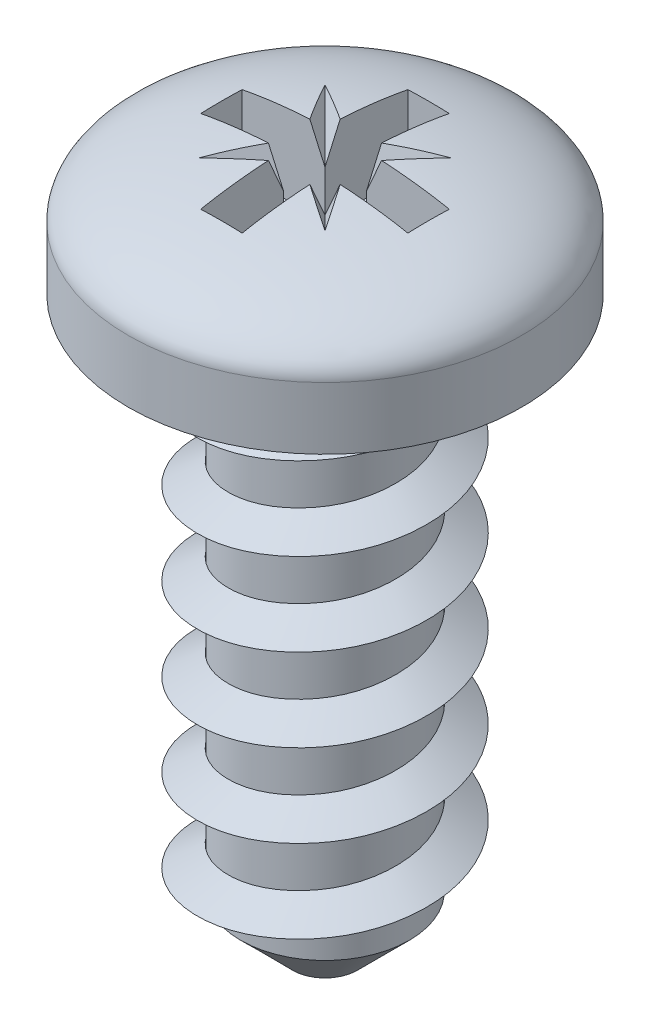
ISO-10303-21;
HEADER;
FILE_DESCRIPTION(('STEP AP214'),'2;1');
FILE_NAME('part.step','',(''),(''),'','','');
FILE_SCHEMA(('AUTOMOTIVE_DESIGN { 1 0 10303 214 1 1 1 1 }'));
ENDSEC;
DATA;
#1=APPLICATION_CONTEXT('core data for automotive mechanical design processes');
#2=APPLICATION_PROTOCOL_DEFINITION('international standard','automotive_design',2000,#1);
#3=PRODUCT_CONTEXT('',#1,'mechanical');
#4=PRODUCT('Part','Part','',(#3));
#5=PRODUCT_RELATED_PRODUCT_CATEGORY('part','',(#4));
#6=PRODUCT_DEFINITION_FORMATION('','',#4);
#7=PRODUCT_DEFINITION_CONTEXT('part definition',#1,'design');
#8=PRODUCT_DEFINITION('design','',#6,#7);
#9=PRODUCT_DEFINITION_SHAPE('','',#8);
#10=(LENGTH_UNIT() NAMED_UNIT(*) SI_UNIT(.MILLI.,.METRE.));
#11=(NAMED_UNIT(*) PLANE_ANGLE_UNIT() SI_UNIT($,.RADIAN.));
#12=(NAMED_UNIT(*) SI_UNIT($,.STERADIAN.) SOLID_ANGLE_UNIT());
#13=UNCERTAINTY_MEASURE_WITH_UNIT(LENGTH_MEASURE(1.E-05),#10,'distance_accuracy_value','');
#14=(GEOMETRIC_REPRESENTATION_CONTEXT(3) GLOBAL_UNCERTAINTY_ASSIGNED_CONTEXT((#13)) GLOBAL_UNIT_ASSIGNED_CONTEXT((#10,
#11,#12)) REPRESENTATION_CONTEXT('',''));
#15=CARTESIAN_POINT('',(0.,0.,0.));
#16=DIRECTION('',(0.,0.,1.));
#17=DIRECTION('',(1.,0.,0.));
#18=AXIS2_PLACEMENT_3D('',#15,#16,#17);
#19=CARTESIAN_POINT('',(1.115,-5.3,0.));
#20=CARTESIAN_POINT('',(1.115,-5.25,-0.461848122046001));
#21=CARTESIAN_POINT('',(0.788424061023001,-5.2,-0.788424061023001));
#22=CARTESIAN_POINT('',(0.461848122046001,-5.15,-1.115));
#23=CARTESIAN_POINT('',(0.,-5.1,-1.115));
#24=CARTESIAN_POINT('',(-0.461848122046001,-5.05,-1.115));
#25=CARTESIAN_POINT('',(-0.788424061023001,-5.,-0.788424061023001));
#26=CARTESIAN_POINT('',(-1.115,-4.95,-0.461848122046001));
#27=CARTESIAN_POINT('',(-1.115,-4.9,0.));
#28=CARTESIAN_POINT('',(-1.115,-4.85,0.461848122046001));
#29=CARTESIAN_POINT('',(-0.788424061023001,-4.8,0.788424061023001));
#30=CARTESIAN_POINT('',(-0.461848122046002,-4.75,1.115));
#31=CARTESIAN_POINT('',(0.,-4.7,1.115));
#32=CARTESIAN_POINT('',(0.461848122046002,-4.65,1.115));
#33=CARTESIAN_POINT('',(0.788424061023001,-4.6,0.788424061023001));
#34=CARTESIAN_POINT('',(1.115,-4.55,0.461848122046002));
#35=CARTESIAN_POINT('',(1.115,-4.5,0.));
#36=CARTESIAN_POINT('',(1.115,-4.45,-0.461848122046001));
#37=CARTESIAN_POINT('',(0.788424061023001,-4.4,-0.788424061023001));
#38=CARTESIAN_POINT('',(0.461848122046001,-4.35,-1.115));
#39=CARTESIAN_POINT('',(0.,-4.3,-1.115));
#40=CARTESIAN_POINT('',(-0.461848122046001,-4.25,-1.115));
#41=CARTESIAN_POINT('',(-0.788424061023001,-4.2,-0.788424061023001));
#42=CARTESIAN_POINT('',(-1.115,-4.15,-0.461848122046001));
#43=CARTESIAN_POINT('',(-1.115,-4.1,0.));
#44=CARTESIAN_POINT('',(-1.115,-4.05,0.461848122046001));
#45=CARTESIAN_POINT('',(-0.788424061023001,-4.,0.788424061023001));
#46=CARTESIAN_POINT('',(-0.461848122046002,-3.95,1.115));
#47=CARTESIAN_POINT('',(0.,-3.9,1.115));
#48=CARTESIAN_POINT('',(0.461848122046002,-3.85,1.115));
#49=CARTESIAN_POINT('',(0.788424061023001,-3.8,0.788424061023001));
#50=CARTESIAN_POINT('',(1.115,-3.75,0.461848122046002));
#51=CARTESIAN_POINT('',(1.115,-3.7,0.));
#52=CARTESIAN_POINT('',(1.115,-3.65,-0.461848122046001));
#53=CARTESIAN_POINT('',(0.788424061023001,-3.6,-0.788424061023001));
#54=CARTESIAN_POINT('',(0.461848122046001,-3.55,-1.115));
#55=CARTESIAN_POINT('',(0.,-3.5,-1.115));
#56=CARTESIAN_POINT('',(-0.461848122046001,-3.45,-1.115));
#57=CARTESIAN_POINT('',(-0.788424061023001,-3.4,-0.788424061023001));
#58=CARTESIAN_POINT('',(-1.115,-3.35,-0.461848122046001));
#59=CARTESIAN_POINT('',(-1.115,-3.3,0.));
#60=CARTESIAN_POINT('',(-1.115,-3.25,0.461848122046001));
#61=CARTESIAN_POINT('',(-0.788424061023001,-3.2,0.788424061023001));
#62=CARTESIAN_POINT('',(-0.461848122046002,-3.15,1.115));
#63=CARTESIAN_POINT('',(0.,-3.1,1.115));
#64=CARTESIAN_POINT('',(0.461848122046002,-3.05,1.115));
#65=CARTESIAN_POINT('',(0.788424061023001,-3.,0.788424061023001));
#66=CARTESIAN_POINT('',(1.115,-2.95,0.461848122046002));
#67=CARTESIAN_POINT('',(1.115,-2.9,0.));
#68=CARTESIAN_POINT('',(1.115,-2.85,-0.461848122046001));
#69=CARTESIAN_POINT('',(0.788424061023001,-2.8,-0.788424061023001));
#70=CARTESIAN_POINT('',(0.461848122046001,-2.75,-1.115));
#71=CARTESIAN_POINT('',(0.,-2.7,-1.115));
#72=CARTESIAN_POINT('',(-0.461848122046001,-2.65,-1.115));
#73=CARTESIAN_POINT('',(-0.788424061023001,-2.6,-0.788424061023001));
#74=CARTESIAN_POINT('',(-1.115,-2.55,-0.461848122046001));
#75=CARTESIAN_POINT('',(-1.115,-2.5,0.));
#76=CARTESIAN_POINT('',(-1.115,-2.45,0.461848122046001));
#77=CARTESIAN_POINT('',(-0.788424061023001,-2.4,0.788424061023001));
#78=CARTESIAN_POINT('',(-0.461848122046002,-2.35,1.115));
#79=CARTESIAN_POINT('',(0.,-2.3,1.115));
#80=CARTESIAN_POINT('',(0.461848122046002,-2.25,1.115));
#81=CARTESIAN_POINT('',(0.788424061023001,-2.2,0.788424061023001));
#82=CARTESIAN_POINT('',(1.115,-2.15,0.461848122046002));
#83=CARTESIAN_POINT('',(1.115,-2.1,0.));
#84=CARTESIAN_POINT('',(1.115,-2.05,-0.461848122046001));
#85=CARTESIAN_POINT('',(0.788424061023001,-2.,-0.788424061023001));
#86=CARTESIAN_POINT('',(0.461848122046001,-1.95,-1.115));
#87=CARTESIAN_POINT('',(0.,-1.9,-1.115));
#88=CARTESIAN_POINT('',(-0.461848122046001,-1.85,-1.115));
#89=CARTESIAN_POINT('',(-0.788424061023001,-1.8,-0.788424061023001));
#90=CARTESIAN_POINT('',(-1.115,-1.75,-0.461848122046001));
#91=CARTESIAN_POINT('',(-1.115,-1.7,0.));
#92=CARTESIAN_POINT('',(-1.115,-1.65,0.461848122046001));
#93=CARTESIAN_POINT('',(-0.788424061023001,-1.6,0.788424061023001));
#94=CARTESIAN_POINT('',(-0.461848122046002,-1.55,1.115));
#95=CARTESIAN_POINT('',(0.,-1.5,1.115));
#96=CARTESIAN_POINT('',(0.461848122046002,-1.45,1.115));
#97=CARTESIAN_POINT('',(0.788424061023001,-1.4,0.788424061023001));
#98=CARTESIAN_POINT('',(1.115,-1.35,0.461848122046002));
#99=CARTESIAN_POINT('',(1.115,-1.3,0.));
#100=CARTESIAN_POINT('',(1.115,-1.25,-0.461848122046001));
#101=CARTESIAN_POINT('',(0.788424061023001,-1.2,-0.788424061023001));
#102=CARTESIAN_POINT('',(0.461848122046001,-1.15,-1.115));
#103=CARTESIAN_POINT('',(0.,-1.1,-1.115));
#104=CARTESIAN_POINT('',(-0.461848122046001,-1.05,-1.115));
#105=CARTESIAN_POINT('',(-0.788424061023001,-1.,-0.788424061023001));
#106=CARTESIAN_POINT('',(-1.115,-0.95,-0.461848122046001));
#107=CARTESIAN_POINT('',(-1.115,-0.9,0.));
#108=CARTESIAN_POINT('',(-1.115,-0.85,0.461848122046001));
#109=CARTESIAN_POINT('',(-0.788424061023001,-0.799999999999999,0.788424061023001));
#110=CARTESIAN_POINT('',(-0.461848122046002,-0.75,1.115));
#111=CARTESIAN_POINT('',(0.,-0.7,1.115));
#112=CARTESIAN_POINT('',(0.461848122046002,-0.65,1.115));
#113=CARTESIAN_POINT('',(0.788424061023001,-0.6,0.788424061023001));
#114=CARTESIAN_POINT('',(1.115,-0.55,0.461848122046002));
#115=CARTESIAN_POINT('',(1.115,-0.5,0.));
#116=CARTESIAN_POINT('',(1.115,-0.45,-0.461848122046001));
#117=CARTESIAN_POINT('',(0.788424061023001,-0.4,-0.788424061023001));
#118=CARTESIAN_POINT('',(0.461848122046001,-0.35,-1.115));
#119=CARTESIAN_POINT('',(0.,-0.3,-1.115));
#120=CARTESIAN_POINT('',(-0.461848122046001,-0.249999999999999,-1.115));
#121=CARTESIAN_POINT('',(-0.788424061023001,-0.2,-0.788424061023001));
#122=CARTESIAN_POINT('',(-1.115,-0.15,-0.461848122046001));
#123=CARTESIAN_POINT('',(-1.115,-0.0999999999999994,0.));
#124=CARTESIAN_POINT('',(-1.115,-0.0499999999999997,0.461848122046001));
#125=CARTESIAN_POINT('',(-0.788424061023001,0.,0.788424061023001));
#126=CARTESIAN_POINT('',(-0.461848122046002,0.0500000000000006,1.115));
#127=CARTESIAN_POINT('',(0.,0.1,1.115));
#128=CARTESIAN_POINT('',(0.461848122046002,0.15,1.115));
#129=CARTESIAN_POINT('',(0.788424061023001,0.200000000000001,0.788424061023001));
#130=CARTESIAN_POINT('',(1.115,0.25,0.461848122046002));
#131=CARTESIAN_POINT('',(1.115,0.3,0.));
#132=CARTESIAN_POINT('',(1.115,0.350000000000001,-0.461848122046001));
#133=CARTESIAN_POINT('',(0.788424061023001,0.4,-0.788424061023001));
#134=CARTESIAN_POINT('',(0.461848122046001,0.45,-1.115));
#135=CARTESIAN_POINT('',(0.,0.5,-1.115));
#136=CARTESIAN_POINT('',(-0.461848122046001,0.55,-1.115));
#137=CARTESIAN_POINT('',(-0.788424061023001,0.6,-0.788424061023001));
#138=CARTESIAN_POINT('',(-1.115,0.650000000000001,-0.461848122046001));
#139=CARTESIAN_POINT('',(-1.115,0.7,0.));
#140=CARTESIAN_POINT('',(0.818487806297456,-5.1,0.));
#141=CARTESIAN_POINT('',(0.818487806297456,-5.05,-0.339028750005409));
#142=CARTESIAN_POINT('',(0.578758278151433,-5.,-0.578758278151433));
#143=CARTESIAN_POINT('',(0.339028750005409,-4.95,-0.818487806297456));
#144=CARTESIAN_POINT('',(0.,-4.9,-0.818487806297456));
#145=CARTESIAN_POINT('',(-0.339028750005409,-4.85,-0.818487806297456));
#146=CARTESIAN_POINT('',(-0.578758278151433,-4.8,-0.578758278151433));
#147=CARTESIAN_POINT('',(-0.818487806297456,-4.75,-0.339028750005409));
#148=CARTESIAN_POINT('',(-0.818487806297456,-4.7,0.));
#149=CARTESIAN_POINT('',(-0.818487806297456,-4.65,0.339028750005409));
#150=CARTESIAN_POINT('',(-0.578758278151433,-4.6,0.578758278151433));
#151=CARTESIAN_POINT('',(-0.33902875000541,-4.55,0.818487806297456));
#152=CARTESIAN_POINT('',(0.,-4.5,0.818487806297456));
#153=CARTESIAN_POINT('',(0.339028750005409,-4.45,0.818487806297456));
#154=CARTESIAN_POINT('',(0.578758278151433,-4.4,0.578758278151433));
#155=CARTESIAN_POINT('',(0.818487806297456,-4.35,0.33902875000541));
#156=CARTESIAN_POINT('',(0.818487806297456,-4.3,0.));
#157=CARTESIAN_POINT('',(0.818487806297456,-4.25,-0.339028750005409));
#158=CARTESIAN_POINT('',(0.578758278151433,-4.2,-0.578758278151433));
#159=CARTESIAN_POINT('',(0.339028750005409,-4.15,-0.818487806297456));
#160=CARTESIAN_POINT('',(0.,-4.1,-0.818487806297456));
#161=CARTESIAN_POINT('',(-0.339028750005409,-4.05,-0.818487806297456));
#162=CARTESIAN_POINT('',(-0.578758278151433,-4.,-0.578758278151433));
#163=CARTESIAN_POINT('',(-0.818487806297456,-3.95,-0.339028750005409));
#164=CARTESIAN_POINT('',(-0.818487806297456,-3.9,0.));
#165=CARTESIAN_POINT('',(-0.818487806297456,-3.85,0.339028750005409));
#166=CARTESIAN_POINT('',(-0.578758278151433,-3.8,0.578758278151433));
#167=CARTESIAN_POINT('',(-0.33902875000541,-3.75,0.818487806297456));
#168=CARTESIAN_POINT('',(0.,-3.7,0.818487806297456));
#169=CARTESIAN_POINT('',(0.339028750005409,-3.65,0.818487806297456));
#170=CARTESIAN_POINT('',(0.578758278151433,-3.6,0.578758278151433));
#171=CARTESIAN_POINT('',(0.818487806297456,-3.55,0.33902875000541));
#172=CARTESIAN_POINT('',(0.818487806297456,-3.5,0.));
#173=CARTESIAN_POINT('',(0.818487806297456,-3.45,-0.339028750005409));
#174=CARTESIAN_POINT('',(0.578758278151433,-3.4,-0.578758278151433));
#175=CARTESIAN_POINT('',(0.339028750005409,-3.35,-0.818487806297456));
#176=CARTESIAN_POINT('',(0.,-3.3,-0.818487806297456));
#177=CARTESIAN_POINT('',(-0.339028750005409,-3.25,-0.818487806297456));
#178=CARTESIAN_POINT('',(-0.578758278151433,-3.2,-0.578758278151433));
#179=CARTESIAN_POINT('',(-0.818487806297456,-3.15,-0.339028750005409));
#180=CARTESIAN_POINT('',(-0.818487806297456,-3.1,0.));
#181=CARTESIAN_POINT('',(-0.818487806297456,-3.05,0.339028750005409));
#182=CARTESIAN_POINT('',(-0.578758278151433,-3.,0.578758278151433));
#183=CARTESIAN_POINT('',(-0.33902875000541,-2.95,0.818487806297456));
#184=CARTESIAN_POINT('',(0.,-2.9,0.818487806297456));
#185=CARTESIAN_POINT('',(0.339028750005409,-2.85,0.818487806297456));
#186=CARTESIAN_POINT('',(0.578758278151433,-2.8,0.578758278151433));
#187=CARTESIAN_POINT('',(0.818487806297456,-2.75,0.33902875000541));
#188=CARTESIAN_POINT('',(0.818487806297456,-2.7,0.));
#189=CARTESIAN_POINT('',(0.818487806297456,-2.65,-0.339028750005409));
#190=CARTESIAN_POINT('',(0.578758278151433,-2.6,-0.578758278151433));
#191=CARTESIAN_POINT('',(0.339028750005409,-2.55,-0.818487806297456));
#192=CARTESIAN_POINT('',(0.,-2.5,-0.818487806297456));
#193=CARTESIAN_POINT('',(-0.339028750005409,-2.45,-0.818487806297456));
#194=CARTESIAN_POINT('',(-0.578758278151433,-2.4,-0.578758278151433));
#195=CARTESIAN_POINT('',(-0.818487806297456,-2.35,-0.339028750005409));
#196=CARTESIAN_POINT('',(-0.818487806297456,-2.3,0.));
#197=CARTESIAN_POINT('',(-0.818487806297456,-2.25,0.339028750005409));
#198=CARTESIAN_POINT('',(-0.578758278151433,-2.2,0.578758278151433));
#199=CARTESIAN_POINT('',(-0.33902875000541,-2.15,0.818487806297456));
#200=CARTESIAN_POINT('',(0.,-2.1,0.818487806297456));
#201=CARTESIAN_POINT('',(0.339028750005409,-2.05,0.818487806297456));
#202=CARTESIAN_POINT('',(0.578758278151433,-2.,0.578758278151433));
#203=CARTESIAN_POINT('',(0.818487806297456,-1.95,0.33902875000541));
#204=CARTESIAN_POINT('',(0.818487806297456,-1.9,0.));
#205=CARTESIAN_POINT('',(0.818487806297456,-1.85,-0.339028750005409));
#206=CARTESIAN_POINT('',(0.578758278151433,-1.8,-0.578758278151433));
#207=CARTESIAN_POINT('',(0.339028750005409,-1.75,-0.818487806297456));
#208=CARTESIAN_POINT('',(0.,-1.7,-0.818487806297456));
#209=CARTESIAN_POINT('',(-0.339028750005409,-1.65,-0.818487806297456));
#210=CARTESIAN_POINT('',(-0.578758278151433,-1.6,-0.578758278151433));
#211=CARTESIAN_POINT('',(-0.818487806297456,-1.55,-0.339028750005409));
#212=CARTESIAN_POINT('',(-0.818487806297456,-1.5,0.));
#213=CARTESIAN_POINT('',(-0.818487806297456,-1.45,0.339028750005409));
#214=CARTESIAN_POINT('',(-0.578758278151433,-1.4,0.578758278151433));
#215=CARTESIAN_POINT('',(-0.33902875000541,-1.35,0.818487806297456));
#216=CARTESIAN_POINT('',(0.,-1.3,0.818487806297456));
#217=CARTESIAN_POINT('',(0.339028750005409,-1.25,0.818487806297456));
#218=CARTESIAN_POINT('',(0.578758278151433,-1.2,0.578758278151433));
#219=CARTESIAN_POINT('',(0.818487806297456,-1.15,0.33902875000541));
#220=CARTESIAN_POINT('',(0.818487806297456,-1.1,0.));
#221=CARTESIAN_POINT('',(0.818487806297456,-1.05,-0.339028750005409));
#222=CARTESIAN_POINT('',(0.578758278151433,-1.,-0.578758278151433));
#223=CARTESIAN_POINT('',(0.339028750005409,-0.95,-0.818487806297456));
#224=CARTESIAN_POINT('',(0.,-0.9,-0.818487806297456));
#225=CARTESIAN_POINT('',(-0.339028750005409,-0.85,-0.818487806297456));
#226=CARTESIAN_POINT('',(-0.578758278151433,-0.8,-0.578758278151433));
#227=CARTESIAN_POINT('',(-0.818487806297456,-0.75,-0.339028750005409));
#228=CARTESIAN_POINT('',(-0.818487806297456,-0.7,0.));
#229=CARTESIAN_POINT('',(-0.818487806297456,-0.650000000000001,0.339028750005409));
#230=CARTESIAN_POINT('',(-0.578758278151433,-0.6,0.578758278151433));
#231=CARTESIAN_POINT('',(-0.33902875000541,-0.55,0.818487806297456));
#232=CARTESIAN_POINT('',(0.,-0.5,0.818487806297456));
#233=CARTESIAN_POINT('',(0.339028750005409,-0.45,0.818487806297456));
#234=CARTESIAN_POINT('',(0.578758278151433,-0.4,0.578758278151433));
#235=CARTESIAN_POINT('',(0.818487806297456,-0.350000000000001,0.33902875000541));
#236=CARTESIAN_POINT('',(0.818487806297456,-0.3,0.));
#237=CARTESIAN_POINT('',(0.818487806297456,-0.25,-0.339028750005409));
#238=CARTESIAN_POINT('',(0.578758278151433,-0.200000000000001,-0.578758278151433));
#239=CARTESIAN_POINT('',(0.339028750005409,-0.15,-0.818487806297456));
#240=CARTESIAN_POINT('',(0.,-0.1,-0.818487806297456));
#241=CARTESIAN_POINT('',(-0.339028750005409,-0.0499999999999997,-0.818487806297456));
#242=CARTESIAN_POINT('',(-0.578758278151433,0.,-0.578758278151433));
#243=CARTESIAN_POINT('',(-0.818487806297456,0.0499999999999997,-0.339028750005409));
#244=CARTESIAN_POINT('',(-0.818487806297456,0.1,0.));
#245=CARTESIAN_POINT('',(-0.818487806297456,0.15,0.339028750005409));
#246=CARTESIAN_POINT('',(-0.578758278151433,0.2,0.578758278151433));
#247=CARTESIAN_POINT('',(-0.33902875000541,0.25,0.818487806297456));
#248=CARTESIAN_POINT('',(0.,0.3,0.818487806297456));
#249=CARTESIAN_POINT('',(0.339028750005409,0.35,0.818487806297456));
#250=CARTESIAN_POINT('',(0.578758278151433,0.4,0.578758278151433));
#251=CARTESIAN_POINT('',(0.818487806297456,0.45,0.33902875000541));
#252=CARTESIAN_POINT('',(0.818487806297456,0.5,0.));
#253=CARTESIAN_POINT('',(0.818487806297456,0.55,-0.339028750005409));
#254=CARTESIAN_POINT('',(0.578758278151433,0.6,-0.578758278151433));
#255=CARTESIAN_POINT('',(0.339028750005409,0.65,-0.818487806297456));
#256=CARTESIAN_POINT('',(0.,0.7,-0.818487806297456));
#257=CARTESIAN_POINT('',(-0.339028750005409,0.75,-0.818487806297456));
#258=CARTESIAN_POINT('',(-0.578758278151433,0.799999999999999,-0.578758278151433));
#259=CARTESIAN_POINT('',(-0.818487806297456,0.85,-0.339028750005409));
#260=CARTESIAN_POINT('',(-0.818487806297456,0.9,0.));
#261=(BOUNDED_SURFACE() B_SPLINE_SURFACE(1,2,((#19,#20,#21,#22,#23,#24,#25,#26,#27,#28,#29,#30,
#31,#32,#33,#34,#35,#36,#37,#38,#39,#40,#41,#42,#43,#44,#45,#46,#47,#48,#49,#50,#51,#52,#53,#54,
#55,#56,#57,#58,#59,#60,#61,#62,#63,#64,#65,#66,#67,#68,#69,#70,#71,#72,#73,#74,#75,#76,#77,#78,
#79,#80,#81,#82,#83,#84,#85,#86,#87,#88,#89,#90,#91,#92,#93,#94,#95,#96,#97,#98,#99,#100,#101,
#102,#103,#104,#105,#106,#107,#108,#109,#110,#111,#112,#113,#114,#115,#116,#117,#118,#119,#120,
#121,#122,#123,#124,#125,#126,#127,#128,#129,#130,#131,#132,#133,#134,#135,#136,#137,#138,#139),
(#140,#141,#142,#143,#144,#145,#146,#147,#148,#149,#150,#151,#152,#153,#154,#155,#156,#157,#158,
#159,#160,#161,#162,#163,#164,#165,#166,#167,#168,#169,#170,#171,#172,#173,#174,#175,#176,#177,
#178,#179,#180,#181,#182,#183,#184,#185,#186,#187,#188,#189,#190,#191,#192,#193,#194,#195,#196,
#197,#198,#199,#200,#201,#202,#203,#204,#205,#206,#207,#208,#209,#210,#211,#212,#213,#214,#215,
#216,#217,#218,#219,#220,#221,#222,#223,#224,#225,#226,#227,#228,#229,#230,#231,#232,#233,#234,
#235,#236,#237,#238,#239,#240,#241,#242,#243,#244,#245,#246,#247,#248,#249,#250,#251,#252,#253,
#254,#255,#256,#257,#258,#259,#260)),.UNSPECIFIED.,.F.,.F.,.F.) B_SPLINE_SURFACE_WITH_KNOTS((2,
2),(3,2,2,2,2,2,2,2,2,2,2,2,2,2,2,2,2,2,2,2,2,2,2,2,2,2,2,2,2,2,2,2,2,2,2,2,2,2,2,2,2,2,2,2,2,2,
2,2,2,2,2,2,2,2,2,2,2,2,2,2,3),(0.,0.320678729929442),(0.,0.015625,0.03125,0.046875,0.0625,
0.078125,0.09375,0.109375,0.125,0.140625,0.15625,0.171875,0.1875,0.203125,0.21875,0.234375,0.25,
0.265625,0.28125,0.296875,0.3125,0.328125,0.34375,0.359375,0.375,0.390625,0.40625,0.421875,
0.4375,0.453125,0.46875,0.484375,0.5,0.515625,0.53125,0.546875,0.5625,0.578125,0.59375,0.609375,
0.625,0.640625,0.65625,0.671875,0.6875,0.703125,0.71875,0.734375,0.75,0.765625,0.78125,0.796875,
0.8125,0.828125,0.84375,0.859375,0.875,0.890625,0.90625,0.921875,0.9375),
.UNSPECIFIED.) GEOMETRIC_REPRESENTATION_ITEM() RATIONAL_B_SPLINE_SURFACE(((1.,0.923879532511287,
1.,0.923879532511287,1.,0.923879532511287,1.,0.923879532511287,1.,0.923879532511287,1.,
0.923879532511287,1.,0.923879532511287,1.,0.923879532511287,1.,0.923879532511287,1.,
0.923879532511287,1.,0.923879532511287,1.,0.923879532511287,1.,0.923879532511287,1.,
0.923879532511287,1.,0.923879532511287,1.,0.923879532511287,1.,0.923879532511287,1.,
0.923879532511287,1.,0.923879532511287,1.,0.923879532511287,1.,0.923879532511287,1.,
0.923879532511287,1.,0.923879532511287,1.,0.923879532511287,1.,0.923879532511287,1.,
0.923879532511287,1.,0.923879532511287,1.,0.923879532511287,1.,0.923879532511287,1.,
0.923879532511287,1.,0.923879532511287,1.,0.923879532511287,1.,0.923879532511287,1.,
0.923879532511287,1.,0.923879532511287,1.,0.923879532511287,1.,0.923879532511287,1.,
0.923879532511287,1.,0.923879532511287,1.,0.923879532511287,1.,0.923879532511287,1.,
0.923879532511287,1.,0.923879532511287,1.,0.923879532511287,1.,0.923879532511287,1.,
0.923879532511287,1.,0.923879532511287,1.,0.923879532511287,1.,0.923879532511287,1.,
0.923879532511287,1.,0.923879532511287,1.,0.923879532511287,1.,0.923879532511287,1.,
0.923879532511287,1.,0.923879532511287,1.,0.923879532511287,1.,0.923879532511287,1.,
0.923879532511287,1.,0.923879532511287,1.,0.923879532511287,1.),(1.,0.923879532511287,1.,
0.923879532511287,1.,0.923879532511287,1.,0.923879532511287,1.,0.923879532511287,1.,
0.923879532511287,1.,0.923879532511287,1.,0.923879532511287,1.,0.923879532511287,1.,
0.923879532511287,1.,0.923879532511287,1.,0.923879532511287,1.,0.923879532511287,1.,
0.923879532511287,1.,0.923879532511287,1.,0.923879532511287,1.,0.923879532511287,1.,
0.923879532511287,1.,0.923879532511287,1.,0.923879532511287,1.,0.923879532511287,1.,
0.923879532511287,1.,0.923879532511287,1.,0.923879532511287,1.,0.923879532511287,1.,
0.923879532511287,1.,0.923879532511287,1.,0.923879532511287,1.,0.923879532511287,1.,
0.923879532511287,1.,0.923879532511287,1.,0.923879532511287,1.,0.923879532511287,1.,
0.923879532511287,1.,0.923879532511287,1.,0.923879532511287,1.,0.923879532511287,1.,
0.923879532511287,1.,0.923879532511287,1.,0.923879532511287,1.,0.923879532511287,1.,
0.923879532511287,1.,0.923879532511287,1.,0.923879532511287,1.,0.923879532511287,1.,
0.923879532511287,1.,0.923879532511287,1.,0.923879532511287,1.,0.923879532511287,1.,
0.923879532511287,1.,0.923879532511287,1.,0.923879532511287,1.,0.923879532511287,1.,
0.923879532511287,1.,0.923879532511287,1.,0.923879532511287,1.,0.923879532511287,1.,
0.923879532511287,1.,0.923879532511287,1.,0.923879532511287,1.))) REPRESENTATION_ITEM('') SURFACE());
#262=CARTESIAN_POINT('',(-0.788424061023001,-5.,-0.788424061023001));
#263=CARTESIAN_POINT('',(-0.764864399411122,-5.,-0.805467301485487));
#264=CARTESIAN_POINT('',(-0.74059658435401,-5.,-0.821510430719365));
#265=CARTESIAN_POINT('',(-0.690797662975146,-5.,-0.851495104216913));
#266=CARTESIAN_POINT('',(-0.665266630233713,-5.,-0.865436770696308));
#267=CARTESIAN_POINT('',(-0.587136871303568,-5.,-0.903894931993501));
#268=CARTESIAN_POINT('',(-0.532879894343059,-5.,-0.925132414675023));
#269=CARTESIAN_POINT('',(-0.421641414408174,-5.,-0.958098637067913));
#270=CARTESIAN_POINT('',(-0.364664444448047,-5.,-0.969842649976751));
#271=CARTESIAN_POINT('',(-0.278357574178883,-5.,-0.980114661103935));
#272=CARTESIAN_POINT('',(-0.249422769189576,-5.,-0.982313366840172));
#273=CARTESIAN_POINT('',(-0.191456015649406,-5.,-0.984249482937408));
#274=CARTESIAN_POINT('',(-0.162424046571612,-5.,-0.983986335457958));
#275=CARTESIAN_POINT('',(-0.10461210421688,-5.,-0.980987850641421));
#276=CARTESIAN_POINT('',(-0.0758315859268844,-5.,-0.97826262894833));
#277=CARTESIAN_POINT('',(-0.018595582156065,-5.,-0.970435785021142));
#278=CARTESIAN_POINT('',(0.00985998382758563,-5.,-0.965334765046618));
#279=CARTESIAN_POINT('',(0.0661047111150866,-5.,-0.952365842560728));
#280=CARTESIAN_POINT('',(0.0938947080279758,-5.,-0.944501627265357));
#281=CARTESIAN_POINT('',(0.148564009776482,-5.,-0.926101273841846));
#282=CARTESIAN_POINT('',(0.175443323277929,-5.,-0.915565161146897));
#283=CARTESIAN_POINT('',(0.24975502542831,-5.,-0.882119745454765));
#284=CARTESIAN_POINT('',(0.295860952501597,-5.,-0.856171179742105));
#285=CARTESIAN_POINT('',(0.382645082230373,-5.,-0.79639736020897));
#286=CARTESIAN_POINT('',(0.423323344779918,-5.,-0.762572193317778));
#287=CARTESIAN_POINT('',(0.482891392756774,-5.,-0.703145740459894));
#288=CARTESIAN_POINT('',(0.503969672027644,-5.,-0.679699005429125));
#289=CARTESIAN_POINT('',(0.543422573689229,-5.,-0.630728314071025));
#290=CARTESIAN_POINT('',(0.561803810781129,-5.,-0.605209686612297));
#291=CARTESIAN_POINT('',(0.578758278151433,-5.,-0.578758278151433));
#292=B_SPLINE_CURVE_WITH_KNOTS('',3,(#262,#263,#264,#265,#266,#267,#268,#269,#270,#271,#272,
#273,#274,#275,#276,#277,#278,#279,#280,#281,#282,#283,#284,#285,#286,#287,#288,#289,#290,#291),
.UNSPECIFIED.,.F.,.F.,(4,2,2,2,2,2,2,2,2,2,2,2,2,2,4),(0.,0.0871832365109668,0.174361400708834,
0.348273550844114,0.521905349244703,0.608873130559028,0.695860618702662,0.782492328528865,
0.869102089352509,0.955596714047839,1.04209051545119,1.19989812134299,1.35770398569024,
1.45211959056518,1.54629961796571),.UNSPECIFIED.);
#293=CARTESIAN_POINT('',(-0.788424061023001,-5.,-0.788424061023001));
#294=VERTEX_POINT('',#293);
#295=CARTESIAN_POINT('',(0.578758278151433,-5.,-0.578758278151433));
#296=VERTEX_POINT('',#295);
#297=EDGE_CURVE('E184',#294,#296,#292,.T.);
#298=CARTESIAN_POINT('',(1.115,-5.3,0.));
#299=CARTESIAN_POINT('',(1.115,-5.25,-0.461848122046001));
#300=CARTESIAN_POINT('',(0.788424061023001,-5.2,-0.788424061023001));
#301=CARTESIAN_POINT('',(0.461848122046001,-5.15,-1.115));
#302=CARTESIAN_POINT('',(0.,-5.1,-1.115));
#303=CARTESIAN_POINT('',(-0.461848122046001,-5.05,-1.115));
#304=CARTESIAN_POINT('',(-0.788424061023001,-5.,-0.788424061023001));
#305=CARTESIAN_POINT('',(-1.115,-4.95,-0.461848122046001));
#306=CARTESIAN_POINT('',(-1.115,-4.9,0.));
#307=CARTESIAN_POINT('',(-1.115,-4.85,0.461848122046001));
#308=CARTESIAN_POINT('',(-0.788424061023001,-4.8,0.788424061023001));
#309=CARTESIAN_POINT('',(-0.461848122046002,-4.75,1.115));
#310=CARTESIAN_POINT('',(0.,-4.7,1.115));
#311=CARTESIAN_POINT('',(0.461848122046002,-4.65,1.115));
#312=CARTESIAN_POINT('',(0.788424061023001,-4.6,0.788424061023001));
#313=CARTESIAN_POINT('',(1.115,-4.55,0.461848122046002));
#314=CARTESIAN_POINT('',(1.115,-4.5,0.));
#315=CARTESIAN_POINT('',(1.115,-4.45,-0.461848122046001));
#316=CARTESIAN_POINT('',(0.788424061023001,-4.4,-0.788424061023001));
#317=CARTESIAN_POINT('',(0.461848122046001,-4.35,-1.115));
#318=CARTESIAN_POINT('',(0.,-4.3,-1.115));
#319=CARTESIAN_POINT('',(-0.461848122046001,-4.25,-1.115));
#320=CARTESIAN_POINT('',(-0.788424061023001,-4.2,-0.788424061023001));
#321=CARTESIAN_POINT('',(-1.115,-4.15,-0.461848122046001));
#322=CARTESIAN_POINT('',(-1.115,-4.1,0.));
#323=CARTESIAN_POINT('',(-1.115,-4.05,0.461848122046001));
#324=CARTESIAN_POINT('',(-0.788424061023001,-4.,0.788424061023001));
#325=CARTESIAN_POINT('',(-0.461848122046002,-3.95,1.115));
#326=CARTESIAN_POINT('',(0.,-3.9,1.115));
#327=CARTESIAN_POINT('',(0.461848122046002,-3.85,1.115));
#328=CARTESIAN_POINT('',(0.788424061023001,-3.8,0.788424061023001));
#329=CARTESIAN_POINT('',(1.115,-3.75,0.461848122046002));
#330=CARTESIAN_POINT('',(1.115,-3.7,0.));
#331=CARTESIAN_POINT('',(1.115,-3.65,-0.461848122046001));
#332=CARTESIAN_POINT('',(0.788424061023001,-3.6,-0.788424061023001));
#333=CARTESIAN_POINT('',(0.461848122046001,-3.55,-1.115));
#334=CARTESIAN_POINT('',(0.,-3.5,-1.115));
#335=CARTESIAN_POINT('',(-0.461848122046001,-3.45,-1.115));
#336=CARTESIAN_POINT('',(-0.788424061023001,-3.4,-0.788424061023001));
#337=CARTESIAN_POINT('',(-1.115,-3.35,-0.461848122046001));
#338=CARTESIAN_POINT('',(-1.115,-3.3,0.));
#339=CARTESIAN_POINT('',(-1.115,-3.25,0.461848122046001));
#340=CARTESIAN_POINT('',(-0.788424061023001,-3.2,0.788424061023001));
#341=CARTESIAN_POINT('',(-0.461848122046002,-3.15,1.115));
#342=CARTESIAN_POINT('',(0.,-3.1,1.115));
#343=CARTESIAN_POINT('',(0.461848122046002,-3.05,1.115));
#344=CARTESIAN_POINT('',(0.788424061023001,-3.,0.788424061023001));
#345=CARTESIAN_POINT('',(1.115,-2.95,0.461848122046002));
#346=CARTESIAN_POINT('',(1.115,-2.9,0.));
#347=CARTESIAN_POINT('',(1.115,-2.85,-0.461848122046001));
#348=CARTESIAN_POINT('',(0.788424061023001,-2.8,-0.788424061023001));
#349=CARTESIAN_POINT('',(0.461848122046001,-2.75,-1.115));
#350=CARTESIAN_POINT('',(0.,-2.7,-1.115));
#351=CARTESIAN_POINT('',(-0.461848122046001,-2.65,-1.115));
#352=CARTESIAN_POINT('',(-0.788424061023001,-2.6,-0.788424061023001));
#353=CARTESIAN_POINT('',(-1.115,-2.55,-0.461848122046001));
#354=CARTESIAN_POINT('',(-1.115,-2.5,0.));
#355=CARTESIAN_POINT('',(-1.115,-2.45,0.461848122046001));
#356=CARTESIAN_POINT('',(-0.788424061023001,-2.4,0.788424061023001));
#357=CARTESIAN_POINT('',(-0.461848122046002,-2.35,1.115));
#358=CARTESIAN_POINT('',(0.,-2.3,1.115));
#359=CARTESIAN_POINT('',(0.461848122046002,-2.25,1.115));
#360=CARTESIAN_POINT('',(0.788424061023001,-2.2,0.788424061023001));
#361=CARTESIAN_POINT('',(1.115,-2.15,0.461848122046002));
#362=CARTESIAN_POINT('',(1.115,-2.1,0.));
#363=CARTESIAN_POINT('',(1.115,-2.05,-0.461848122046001));
#364=CARTESIAN_POINT('',(0.788424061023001,-2.,-0.788424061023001));
#365=CARTESIAN_POINT('',(0.461848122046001,-1.95,-1.115));
#366=CARTESIAN_POINT('',(0.,-1.9,-1.115));
#367=CARTESIAN_POINT('',(-0.461848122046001,-1.85,-1.115));
#368=CARTESIAN_POINT('',(-0.788424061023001,-1.8,-0.788424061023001));
#369=CARTESIAN_POINT('',(-1.115,-1.75,-0.461848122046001));
#370=CARTESIAN_POINT('',(-1.115,-1.7,0.));
#371=CARTESIAN_POINT('',(-1.115,-1.65,0.461848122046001));
#372=CARTESIAN_POINT('',(-0.788424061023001,-1.6,0.788424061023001));
#373=CARTESIAN_POINT('',(-0.461848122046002,-1.55,1.115));
#374=CARTESIAN_POINT('',(0.,-1.5,1.115));
#375=CARTESIAN_POINT('',(0.461848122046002,-1.45,1.115));
#376=CARTESIAN_POINT('',(0.788424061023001,-1.4,0.788424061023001));
#377=CARTESIAN_POINT('',(1.115,-1.35,0.461848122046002));
#378=CARTESIAN_POINT('',(1.115,-1.3,0.));
#379=CARTESIAN_POINT('',(1.115,-1.25,-0.461848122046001));
#380=CARTESIAN_POINT('',(0.788424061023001,-1.2,-0.788424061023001));
#381=CARTESIAN_POINT('',(0.461848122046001,-1.15,-1.115));
#382=CARTESIAN_POINT('',(0.,-1.1,-1.115));
#383=CARTESIAN_POINT('',(-0.461848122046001,-1.05,-1.115));
#384=CARTESIAN_POINT('',(-0.788424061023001,-1.,-0.788424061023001));
#385=CARTESIAN_POINT('',(-1.115,-0.95,-0.461848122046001));
#386=CARTESIAN_POINT('',(-1.115,-0.9,0.));
#387=CARTESIAN_POINT('',(-1.115,-0.85,0.461848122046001));
#388=CARTESIAN_POINT('',(-0.788424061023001,-0.799999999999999,0.788424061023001));
#389=CARTESIAN_POINT('',(-0.461848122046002,-0.75,1.115));
#390=CARTESIAN_POINT('',(0.,-0.7,1.115));
#391=CARTESIAN_POINT('',(0.461848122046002,-0.65,1.115));
#392=CARTESIAN_POINT('',(0.788424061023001,-0.6,0.788424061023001));
#393=CARTESIAN_POINT('',(1.115,-0.55,0.461848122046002));
#394=CARTESIAN_POINT('',(1.115,-0.5,0.));
#395=CARTESIAN_POINT('',(1.115,-0.45,-0.461848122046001));
#396=CARTESIAN_POINT('',(0.788424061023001,-0.4,-0.788424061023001));
#397=CARTESIAN_POINT('',(0.461848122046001,-0.35,-1.115));
#398=CARTESIAN_POINT('',(0.,-0.3,-1.115));
#399=CARTESIAN_POINT('',(-0.461848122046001,-0.249999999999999,-1.115));
#400=CARTESIAN_POINT('',(-0.788424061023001,-0.2,-0.788424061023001));
#401=CARTESIAN_POINT('',(-1.115,-0.15,-0.461848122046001));
#402=CARTESIAN_POINT('',(-1.115,-0.0999999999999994,0.));
#403=CARTESIAN_POINT('',(-1.115,-0.0499999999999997,0.461848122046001));
#404=CARTESIAN_POINT('',(-0.788424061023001,0.,0.788424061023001));
#405=CARTESIAN_POINT('',(-0.461848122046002,0.0500000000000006,1.115));
#406=CARTESIAN_POINT('',(0.,0.1,1.115));
#407=CARTESIAN_POINT('',(0.461848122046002,0.15,1.115));
#408=CARTESIAN_POINT('',(0.788424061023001,0.200000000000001,0.788424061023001));
#409=CARTESIAN_POINT('',(1.115,0.25,0.461848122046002));
#410=CARTESIAN_POINT('',(1.115,0.3,0.));
#411=CARTESIAN_POINT('',(1.115,0.350000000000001,-0.461848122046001));
#412=CARTESIAN_POINT('',(0.788424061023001,0.4,-0.788424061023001));
#413=CARTESIAN_POINT('',(0.461848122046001,0.45,-1.115));
#414=CARTESIAN_POINT('',(0.,0.5,-1.115));
#415=CARTESIAN_POINT('',(-0.461848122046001,0.55,-1.115));
#416=CARTESIAN_POINT('',(-0.788424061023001,0.6,-0.788424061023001));
#417=CARTESIAN_POINT('',(-1.115,0.650000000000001,-0.461848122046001));
#418=CARTESIAN_POINT('',(-1.115,0.7,0.));
#419=(BOUNDED_CURVE() B_SPLINE_CURVE(2,(#298,#299,#300,#301,#302,#303,#304,#305,#306,#307,#308,
#309,#310,#311,#312,#313,#314,#315,#316,#317,#318,#319,#320,#321,#322,#323,#324,#325,#326,#327,
#328,#329,#330,#331,#332,#333,#334,#335,#336,#337,#338,#339,#340,#341,#342,#343,#344,#345,#346,
#347,#348,#349,#350,#351,#352,#353,#354,#355,#356,#357,#358,#359,#360,#361,#362,#363,#364,#365,
#366,#367,#368,#369,#370,#371,#372,#373,#374,#375,#376,#377,#378,#379,#380,#381,#382,#383,#384,
#385,#386,#387,#388,#389,#390,#391,#392,#393,#394,#395,#396,#397,#398,#399,#400,#401,#402,#403,
#404,#405,#406,#407,#408,#409,#410,#411,#412,#413,#414,#415,#416,#417,#418),.UNSPECIFIED.,.F.,
.F.) B_SPLINE_CURVE_WITH_KNOTS((3,2,2,2,2,2,2,2,2,2,2,2,2,2,2,2,2,2,2,2,2,2,2,2,2,2,2,2,2,2,2,2,
2,2,2,2,2,2,2,2,2,2,2,2,2,2,2,2,2,2,2,2,2,2,2,2,2,2,2,2,3),(0.,0.015625,0.03125,0.046875,0.0625,
0.078125,0.09375,0.109375,0.125,0.140625,0.15625,0.171875,0.1875,0.203125,0.21875,0.234375,0.25,
0.265625,0.28125,0.296875,0.3125,0.328125,0.34375,0.359375,0.375,0.390625,0.40625,0.421875,
0.4375,0.453125,0.46875,0.484375,0.5,0.515625,0.53125,0.546875,0.5625,0.578125,0.59375,0.609375,
0.625,0.640625,0.65625,0.671875,0.6875,0.703125,0.71875,0.734375,0.75,0.765625,0.78125,0.796875,
0.8125,0.828125,0.84375,0.859375,0.875,0.890625,0.90625,0.921875,0.9375),
.UNSPECIFIED.) CURVE() GEOMETRIC_REPRESENTATION_ITEM() RATIONAL_B_SPLINE_CURVE((1.,
0.923879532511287,1.,0.923879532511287,1.,0.923879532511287,1.,0.923879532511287,1.,
0.923879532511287,1.,0.923879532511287,1.,0.923879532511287,1.,0.923879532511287,1.,
0.923879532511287,1.,0.923879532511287,1.,0.923879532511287,1.,0.923879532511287,1.,
0.923879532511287,1.,0.923879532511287,1.,0.923879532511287,1.,0.923879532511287,1.,
0.923879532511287,1.,0.923879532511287,1.,0.923879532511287,1.,0.923879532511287,1.,
0.923879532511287,1.,0.923879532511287,1.,0.923879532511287,1.,0.923879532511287,1.,
0.923879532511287,1.,0.923879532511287,1.,0.923879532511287,1.,0.923879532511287,1.,
0.923879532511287,1.,0.923879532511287,1.,0.923879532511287,1.,0.923879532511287,1.,
0.923879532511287,1.,0.923879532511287,1.,0.923879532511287,1.,0.923879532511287,1.,
0.923879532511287,1.,0.923879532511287,1.,0.923879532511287,1.,0.923879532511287,1.,
0.923879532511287,1.,0.923879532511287,1.,0.923879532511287,1.,0.923879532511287,1.,
0.923879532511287,1.,0.923879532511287,1.,0.923879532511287,1.,0.923879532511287,1.,
0.923879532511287,1.,0.923879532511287,1.,0.923879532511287,1.,0.923879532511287,1.,
0.923879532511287,1.,0.923879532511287,1.,0.923879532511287,1.,0.923879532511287,1.,
0.923879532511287,1.,0.923879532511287,1.,0.923879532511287,1.,0.923879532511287,1.)) REPRESENTATION_ITEM(''));
#420=CARTESIAN_POINT('',(-0.788424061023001,0.,0.788424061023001));
#421=VERTEX_POINT('',#420);
#422=EDGE_CURVE('E193',#294,#421,#419,.T.);
#423=CARTESIAN_POINT('',(-0.788424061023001,0.,0.788424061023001));
#424=CARTESIAN_POINT('',(-0.805467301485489,0.,0.764864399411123));
#425=CARTESIAN_POINT('',(-0.821510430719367,0.,0.740596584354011));
#426=CARTESIAN_POINT('',(-0.851495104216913,0.,0.690797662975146));
#427=CARTESIAN_POINT('',(-0.865436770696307,0.,0.665266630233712));
#428=CARTESIAN_POINT('',(-0.903894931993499,0.,0.587136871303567));
#429=CARTESIAN_POINT('',(-0.925132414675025,0.,0.532879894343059));
#430=CARTESIAN_POINT('',(-0.958098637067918,0.,0.421641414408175));
#431=CARTESIAN_POINT('',(-0.969842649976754,0.,0.364664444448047));
#432=CARTESIAN_POINT('',(-0.980114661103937,0.,0.278357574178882));
#433=CARTESIAN_POINT('',(-0.982313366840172,0.,0.249422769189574));
#434=CARTESIAN_POINT('',(-0.984249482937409,0.,0.191456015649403));
#435=CARTESIAN_POINT('',(-0.983986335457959,0.,0.162424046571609));
#436=CARTESIAN_POINT('',(-0.980987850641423,0.,0.104612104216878));
#437=CARTESIAN_POINT('',(-0.978262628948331,0.,0.0758315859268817));
#438=CARTESIAN_POINT('',(-0.970435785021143,0.,0.0185955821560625));
#439=CARTESIAN_POINT('',(-0.965334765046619,0.,-0.00985998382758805));
#440=CARTESIAN_POINT('',(-0.95236584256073,0.,-0.066104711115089));
#441=CARTESIAN_POINT('',(-0.944501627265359,0.,-0.0938947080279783));
#442=CARTESIAN_POINT('',(-0.926101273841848,0.,-0.148564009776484));
#443=CARTESIAN_POINT('',(-0.915565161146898,0.,-0.175443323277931));
#444=CARTESIAN_POINT('',(-0.882119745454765,0.,-0.249755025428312));
#445=CARTESIAN_POINT('',(-0.856171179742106,0.,-0.295860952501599));
#446=CARTESIAN_POINT('',(-0.796397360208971,0.,-0.382645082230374));
#447=CARTESIAN_POINT('',(-0.762572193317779,0.,-0.42332334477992));
#448=CARTESIAN_POINT('',(-0.703145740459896,0.,-0.482891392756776));
#449=CARTESIAN_POINT('',(-0.679699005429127,0.,-0.503969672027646));
#450=CARTESIAN_POINT('',(-0.630728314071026,0.,-0.54342257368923));
#451=CARTESIAN_POINT('',(-0.605209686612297,0.,-0.561803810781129));
#452=CARTESIAN_POINT('',(-0.578758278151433,0.,-0.578758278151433));
#453=B_SPLINE_CURVE_WITH_KNOTS('',3,(#423,#424,#425,#426,#427,#428,#429,#430,#431,#432,#433,
#434,#435,#436,#437,#438,#439,#440,#441,#442,#443,#444,#445,#446,#447,#448,#449,#450,#451,#452),
.UNSPECIFIED.,.F.,.F.,(4,2,2,2,2,2,2,2,2,2,2,2,2,2,4),(0.,0.0871832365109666,0.174361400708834,
0.348273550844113,0.521905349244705,0.608873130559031,0.695860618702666,0.782492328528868,
0.869102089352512,0.955596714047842,1.04209051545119,1.19989812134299,1.35770398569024,
1.45211959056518,1.54629961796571),.UNSPECIFIED.);
#454=CARTESIAN_POINT('',(-0.578758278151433,0.,-0.578758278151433));
#455=VERTEX_POINT('',#454);
#456=EDGE_CURVE('E275',#421,#455,#453,.T.);
#457=CARTESIAN_POINT('',(0.818487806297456,-5.1,0.));
#458=CARTESIAN_POINT('',(0.818487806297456,-5.05,-0.339028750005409));
#459=CARTESIAN_POINT('',(0.578758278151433,-5.,-0.578758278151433));
#460=CARTESIAN_POINT('',(0.339028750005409,-4.95,-0.818487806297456));
#461=CARTESIAN_POINT('',(0.,-4.9,-0.818487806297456));
#462=CARTESIAN_POINT('',(-0.339028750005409,-4.85,-0.818487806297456));
#463=CARTESIAN_POINT('',(-0.578758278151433,-4.8,-0.578758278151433));
#464=CARTESIAN_POINT('',(-0.818487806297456,-4.75,-0.339028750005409));
#465=CARTESIAN_POINT('',(-0.818487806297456,-4.7,0.));
#466=CARTESIAN_POINT('',(-0.818487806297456,-4.65,0.339028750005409));
#467=CARTESIAN_POINT('',(-0.578758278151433,-4.6,0.578758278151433));
#468=CARTESIAN_POINT('',(-0.33902875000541,-4.55,0.818487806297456));
#469=CARTESIAN_POINT('',(0.,-4.5,0.818487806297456));
#470=CARTESIAN_POINT('',(0.339028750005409,-4.45,0.818487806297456));
#471=CARTESIAN_POINT('',(0.578758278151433,-4.4,0.578758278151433));
#472=CARTESIAN_POINT('',(0.818487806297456,-4.35,0.33902875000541));
#473=CARTESIAN_POINT('',(0.818487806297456,-4.3,0.));
#474=CARTESIAN_POINT('',(0.818487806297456,-4.25,-0.339028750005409));
#475=CARTESIAN_POINT('',(0.578758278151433,-4.2,-0.578758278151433));
#476=CARTESIAN_POINT('',(0.339028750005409,-4.15,-0.818487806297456));
#477=CARTESIAN_POINT('',(0.,-4.1,-0.818487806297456));
#478=CARTESIAN_POINT('',(-0.339028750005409,-4.05,-0.818487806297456));
#479=CARTESIAN_POINT('',(-0.578758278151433,-4.,-0.578758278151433));
#480=CARTESIAN_POINT('',(-0.818487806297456,-3.95,-0.339028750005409));
#481=CARTESIAN_POINT('',(-0.818487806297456,-3.9,0.));
#482=CARTESIAN_POINT('',(-0.818487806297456,-3.85,0.339028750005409));
#483=CARTESIAN_POINT('',(-0.578758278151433,-3.8,0.578758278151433));
#484=CARTESIAN_POINT('',(-0.33902875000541,-3.75,0.818487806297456));
#485=CARTESIAN_POINT('',(0.,-3.7,0.818487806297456));
#486=CARTESIAN_POINT('',(0.339028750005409,-3.65,0.818487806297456));
#487=CARTESIAN_POINT('',(0.578758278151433,-3.6,0.578758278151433));
#488=CARTESIAN_POINT('',(0.818487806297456,-3.55,0.33902875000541));
#489=CARTESIAN_POINT('',(0.818487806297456,-3.5,0.));
#490=CARTESIAN_POINT('',(0.818487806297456,-3.45,-0.339028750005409));
#491=CARTESIAN_POINT('',(0.578758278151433,-3.4,-0.578758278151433));
#492=CARTESIAN_POINT('',(0.339028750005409,-3.35,-0.818487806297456));
#493=CARTESIAN_POINT('',(0.,-3.3,-0.818487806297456));
#494=CARTESIAN_POINT('',(-0.339028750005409,-3.25,-0.818487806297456));
#495=CARTESIAN_POINT('',(-0.578758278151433,-3.2,-0.578758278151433));
#496=CARTESIAN_POINT('',(-0.818487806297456,-3.15,-0.339028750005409));
#497=CARTESIAN_POINT('',(-0.818487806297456,-3.1,0.));
#498=CARTESIAN_POINT('',(-0.818487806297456,-3.05,0.339028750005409));
#499=CARTESIAN_POINT('',(-0.578758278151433,-3.,0.578758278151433));
#500=CARTESIAN_POINT('',(-0.33902875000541,-2.95,0.818487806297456));
#501=CARTESIAN_POINT('',(0.,-2.9,0.818487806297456));
#502=CARTESIAN_POINT('',(0.339028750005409,-2.85,0.818487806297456));
#503=CARTESIAN_POINT('',(0.578758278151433,-2.8,0.578758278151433));
#504=CARTESIAN_POINT('',(0.818487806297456,-2.75,0.33902875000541));
#505=CARTESIAN_POINT('',(0.818487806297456,-2.7,0.));
#506=CARTESIAN_POINT('',(0.818487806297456,-2.65,-0.339028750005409));
#507=CARTESIAN_POINT('',(0.578758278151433,-2.6,-0.578758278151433));
#508=CARTESIAN_POINT('',(0.339028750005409,-2.55,-0.818487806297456));
#509=CARTESIAN_POINT('',(0.,-2.5,-0.818487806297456));
#510=CARTESIAN_POINT('',(-0.339028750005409,-2.45,-0.818487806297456));
#511=CARTESIAN_POINT('',(-0.578758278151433,-2.4,-0.578758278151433));
#512=CARTESIAN_POINT('',(-0.818487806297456,-2.35,-0.339028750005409));
#513=CARTESIAN_POINT('',(-0.818487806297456,-2.3,0.));
#514=CARTESIAN_POINT('',(-0.818487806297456,-2.25,0.339028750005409));
#515=CARTESIAN_POINT('',(-0.578758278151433,-2.2,0.578758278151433));
#516=CARTESIAN_POINT('',(-0.33902875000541,-2.15,0.818487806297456));
#517=CARTESIAN_POINT('',(0.,-2.1,0.818487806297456));
#518=CARTESIAN_POINT('',(0.339028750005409,-2.05,0.818487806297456));
#519=CARTESIAN_POINT('',(0.578758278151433,-2.,0.578758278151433));
#520=CARTESIAN_POINT('',(0.818487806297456,-1.95,0.33902875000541));
#521=CARTESIAN_POINT('',(0.818487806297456,-1.9,0.));
#522=CARTESIAN_POINT('',(0.818487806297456,-1.85,-0.339028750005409));
#523=CARTESIAN_POINT('',(0.578758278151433,-1.8,-0.578758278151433));
#524=CARTESIAN_POINT('',(0.339028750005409,-1.75,-0.818487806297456));
#525=CARTESIAN_POINT('',(0.,-1.7,-0.818487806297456));
#526=CARTESIAN_POINT('',(-0.339028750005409,-1.65,-0.818487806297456));
#527=CARTESIAN_POINT('',(-0.578758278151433,-1.6,-0.578758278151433));
#528=CARTESIAN_POINT('',(-0.818487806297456,-1.55,-0.339028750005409));
#529=CARTESIAN_POINT('',(-0.818487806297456,-1.5,0.));
#530=CARTESIAN_POINT('',(-0.818487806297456,-1.45,0.339028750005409));
#531=CARTESIAN_POINT('',(-0.578758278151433,-1.4,0.578758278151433));
#532=CARTESIAN_POINT('',(-0.33902875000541,-1.35,0.818487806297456));
#533=CARTESIAN_POINT('',(0.,-1.3,0.818487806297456));
#534=CARTESIAN_POINT('',(0.339028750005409,-1.25,0.818487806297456));
#535=CARTESIAN_POINT('',(0.578758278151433,-1.2,0.578758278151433));
#536=CARTESIAN_POINT('',(0.818487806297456,-1.15,0.33902875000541));
#537=CARTESIAN_POINT('',(0.818487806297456,-1.1,0.));
#538=CARTESIAN_POINT('',(0.818487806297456,-1.05,-0.339028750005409));
#539=CARTESIAN_POINT('',(0.578758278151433,-1.,-0.578758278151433));
#540=CARTESIAN_POINT('',(0.339028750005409,-0.95,-0.818487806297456));
#541=CARTESIAN_POINT('',(0.,-0.9,-0.818487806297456));
#542=CARTESIAN_POINT('',(-0.339028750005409,-0.85,-0.818487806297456));
#543=CARTESIAN_POINT('',(-0.578758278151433,-0.8,-0.578758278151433));
#544=CARTESIAN_POINT('',(-0.818487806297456,-0.75,-0.339028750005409));
#545=CARTESIAN_POINT('',(-0.818487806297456,-0.7,0.));
#546=CARTESIAN_POINT('',(-0.818487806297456,-0.650000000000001,0.339028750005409));
#547=CARTESIAN_POINT('',(-0.578758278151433,-0.6,0.578758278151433));
#548=CARTESIAN_POINT('',(-0.33902875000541,-0.55,0.818487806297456));
#549=CARTESIAN_POINT('',(0.,-0.5,0.818487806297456));
#550=CARTESIAN_POINT('',(0.339028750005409,-0.45,0.818487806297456));
#551=CARTESIAN_POINT('',(0.578758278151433,-0.4,0.578758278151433));
#552=CARTESIAN_POINT('',(0.818487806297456,-0.350000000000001,0.33902875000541));
#553=CARTESIAN_POINT('',(0.818487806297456,-0.3,0.));
#554=CARTESIAN_POINT('',(0.818487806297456,-0.25,-0.339028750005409));
#555=CARTESIAN_POINT('',(0.578758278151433,-0.200000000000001,-0.578758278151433));
#556=CARTESIAN_POINT('',(0.339028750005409,-0.15,-0.818487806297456));
#557=CARTESIAN_POINT('',(0.,-0.1,-0.818487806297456));
#558=CARTESIAN_POINT('',(-0.339028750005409,-0.0499999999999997,-0.818487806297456));
#559=CARTESIAN_POINT('',(-0.578758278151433,0.,-0.578758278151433));
#560=CARTESIAN_POINT('',(-0.818487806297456,0.0499999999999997,-0.339028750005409));
#561=CARTESIAN_POINT('',(-0.818487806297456,0.1,0.));
#562=CARTESIAN_POINT('',(-0.818487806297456,0.15,0.339028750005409));
#563=CARTESIAN_POINT('',(-0.578758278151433,0.2,0.578758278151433));
#564=CARTESIAN_POINT('',(-0.33902875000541,0.25,0.818487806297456));
#565=CARTESIAN_POINT('',(0.,0.3,0.818487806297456));
#566=CARTESIAN_POINT('',(0.339028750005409,0.35,0.818487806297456));
#567=CARTESIAN_POINT('',(0.578758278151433,0.4,0.578758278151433));
#568=CARTESIAN_POINT('',(0.818487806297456,0.45,0.33902875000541));
#569=CARTESIAN_POINT('',(0.818487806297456,0.5,0.));
#570=CARTESIAN_POINT('',(0.818487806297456,0.55,-0.339028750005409));
#571=CARTESIAN_POINT('',(0.578758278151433,0.6,-0.578758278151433));
#572=CARTESIAN_POINT('',(0.339028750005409,0.65,-0.818487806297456));
#573=CARTESIAN_POINT('',(0.,0.7,-0.818487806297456));
#574=CARTESIAN_POINT('',(-0.339028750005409,0.75,-0.818487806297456));
#575=CARTESIAN_POINT('',(-0.578758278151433,0.799999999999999,-0.578758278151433));
#576=CARTESIAN_POINT('',(-0.818487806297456,0.85,-0.339028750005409));
#577=CARTESIAN_POINT('',(-0.818487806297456,0.9,0.));
#578=(BOUNDED_CURVE() B_SPLINE_CURVE(2,(#457,#458,#459,#460,#461,#462,#463,#464,#465,#466,#467,
#468,#469,#470,#471,#472,#473,#474,#475,#476,#477,#478,#479,#480,#481,#482,#483,#484,#485,#486,
#487,#488,#489,#490,#491,#492,#493,#494,#495,#496,#497,#498,#499,#500,#501,#502,#503,#504,#505,
#506,#507,#508,#509,#510,#511,#512,#513,#514,#515,#516,#517,#518,#519,#520,#521,#522,#523,#524,
#525,#526,#527,#528,#529,#530,#531,#532,#533,#534,#535,#536,#537,#538,#539,#540,#541,#542,#543,
#544,#545,#546,#547,#548,#549,#550,#551,#552,#553,#554,#555,#556,#557,#558,#559,#560,#561,#562,
#563,#564,#565,#566,#567,#568,#569,#570,#571,#572,#573,#574,#575,#576,#577),.UNSPECIFIED.,.F.,
.F.) B_SPLINE_CURVE_WITH_KNOTS((3,2,2,2,2,2,2,2,2,2,2,2,2,2,2,2,2,2,2,2,2,2,2,2,2,2,2,2,2,2,2,2,
2,2,2,2,2,2,2,2,2,2,2,2,2,2,2,2,2,2,2,2,2,2,2,2,2,2,2,2,3),(0.,0.015625,0.03125,0.046875,0.0625,
0.078125,0.09375,0.109375,0.125,0.140625,0.15625,0.171875,0.1875,0.203125,0.21875,0.234375,0.25,
0.265625,0.28125,0.296875,0.3125,0.328125,0.34375,0.359375,0.375,0.390625,0.40625,0.421875,
0.4375,0.453125,0.46875,0.484375,0.5,0.515625,0.53125,0.546875,0.5625,0.578125,0.59375,0.609375,
0.625,0.640625,0.65625,0.671875,0.6875,0.703125,0.71875,0.734375,0.75,0.765625,0.78125,0.796875,
0.8125,0.828125,0.84375,0.859375,0.875,0.890625,0.90625,0.921875,0.9375),
.UNSPECIFIED.) CURVE() GEOMETRIC_REPRESENTATION_ITEM() RATIONAL_B_SPLINE_CURVE((1.,
0.923879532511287,1.,0.923879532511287,1.,0.923879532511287,1.,0.923879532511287,1.,
0.923879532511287,1.,0.923879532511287,1.,0.923879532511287,1.,0.923879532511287,1.,
0.923879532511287,1.,0.923879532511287,1.,0.923879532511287,1.,0.923879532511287,1.,
0.923879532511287,1.,0.923879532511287,1.,0.923879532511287,1.,0.923879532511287,1.,
0.923879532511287,1.,0.923879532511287,1.,0.923879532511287,1.,0.923879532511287,1.,
0.923879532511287,1.,0.923879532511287,1.,0.923879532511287,1.,0.923879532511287,1.,
0.923879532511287,1.,0.923879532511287,1.,0.923879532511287,1.,0.923879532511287,1.,
0.923879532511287,1.,0.923879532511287,1.,0.923879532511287,1.,0.923879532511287,1.,
0.923879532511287,1.,0.923879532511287,1.,0.923879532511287,1.,0.923879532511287,1.,
0.923879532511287,1.,0.923879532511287,1.,0.923879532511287,1.,0.923879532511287,1.,
0.923879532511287,1.,0.923879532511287,1.,0.923879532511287,1.,0.923879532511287,1.,
0.923879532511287,1.,0.923879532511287,1.,0.923879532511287,1.,0.923879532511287,1.,
0.923879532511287,1.,0.923879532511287,1.,0.923879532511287,1.,0.923879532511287,1.,
0.923879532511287,1.,0.923879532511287,1.,0.923879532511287,1.,0.923879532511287,1.,
0.923879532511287,1.,0.923879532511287,1.,0.923879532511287,1.,0.923879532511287,1.)) REPRESENTATION_ITEM(''));
#579=EDGE_CURVE('E195',#296,#455,#578,.T.);
#580=ORIENTED_EDGE('',*,*,#297,.F.);
#581=ORIENTED_EDGE('',*,*,#422,.T.);
#582=ORIENTED_EDGE('',*,*,#456,.T.);
#583=ORIENTED_EDGE('',*,*,#579,.F.);
#584=EDGE_LOOP('',(#580,#581,#582,#583));
#585=FACE_BOUND('',#584,.T.);
#586=ADVANCED_FACE('F39',(#585),#261,.F.);
#587=CARTESIAN_POINT('',(0.818487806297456,-5.1,0.));
#588=CARTESIAN_POINT('',(0.818487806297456,-5.05,-0.339028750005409));
#589=CARTESIAN_POINT('',(0.578758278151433,-5.,-0.578758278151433));
#590=CARTESIAN_POINT('',(0.339028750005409,-4.95,-0.818487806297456));
#591=CARTESIAN_POINT('',(0.,-4.9,-0.818487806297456));
#592=CARTESIAN_POINT('',(-0.339028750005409,-4.85,-0.818487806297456));
#593=CARTESIAN_POINT('',(-0.578758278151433,-4.8,-0.578758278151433));
#594=CARTESIAN_POINT('',(-0.818487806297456,-4.75,-0.339028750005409));
#595=CARTESIAN_POINT('',(-0.818487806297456,-4.7,0.));
#596=CARTESIAN_POINT('',(-0.818487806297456,-4.65,0.339028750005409));
#597=CARTESIAN_POINT('',(-0.578758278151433,-4.6,0.578758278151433));
#598=CARTESIAN_POINT('',(-0.33902875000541,-4.55,0.818487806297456));
#599=CARTESIAN_POINT('',(0.,-4.5,0.818487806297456));
#600=CARTESIAN_POINT('',(0.339028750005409,-4.45,0.818487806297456));
#601=CARTESIAN_POINT('',(0.578758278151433,-4.4,0.578758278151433));
#602=CARTESIAN_POINT('',(0.818487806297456,-4.35,0.33902875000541));
#603=CARTESIAN_POINT('',(0.818487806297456,-4.3,0.));
#604=CARTESIAN_POINT('',(0.818487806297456,-4.25,-0.339028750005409));
#605=CARTESIAN_POINT('',(0.578758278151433,-4.2,-0.578758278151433));
#606=CARTESIAN_POINT('',(0.339028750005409,-4.15,-0.818487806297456));
#607=CARTESIAN_POINT('',(0.,-4.1,-0.818487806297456));
#608=CARTESIAN_POINT('',(-0.339028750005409,-4.05,-0.818487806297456));
#609=CARTESIAN_POINT('',(-0.578758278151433,-4.,-0.578758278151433));
#610=CARTESIAN_POINT('',(-0.818487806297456,-3.95,-0.339028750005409));
#611=CARTESIAN_POINT('',(-0.818487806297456,-3.9,0.));
#612=CARTESIAN_POINT('',(-0.818487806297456,-3.85,0.339028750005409));
#613=CARTESIAN_POINT('',(-0.578758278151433,-3.8,0.578758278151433));
#614=CARTESIAN_POINT('',(-0.33902875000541,-3.75,0.818487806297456));
#615=CARTESIAN_POINT('',(0.,-3.7,0.818487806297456));
#616=CARTESIAN_POINT('',(0.339028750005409,-3.65,0.818487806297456));
#617=CARTESIAN_POINT('',(0.578758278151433,-3.6,0.578758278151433));
#618=CARTESIAN_POINT('',(0.818487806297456,-3.55,0.33902875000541));
#619=CARTESIAN_POINT('',(0.818487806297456,-3.5,0.));
#620=CARTESIAN_POINT('',(0.818487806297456,-3.45,-0.339028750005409));
#621=CARTESIAN_POINT('',(0.578758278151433,-3.4,-0.578758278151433));
#622=CARTESIAN_POINT('',(0.339028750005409,-3.35,-0.818487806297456));
#623=CARTESIAN_POINT('',(0.,-3.3,-0.818487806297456));
#624=CARTESIAN_POINT('',(-0.339028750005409,-3.25,-0.818487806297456));
#625=CARTESIAN_POINT('',(-0.578758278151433,-3.2,-0.578758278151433));
#626=CARTESIAN_POINT('',(-0.818487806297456,-3.15,-0.339028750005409));
#627=CARTESIAN_POINT('',(-0.818487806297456,-3.1,0.));
#628=CARTESIAN_POINT('',(-0.818487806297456,-3.05,0.339028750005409));
#629=CARTESIAN_POINT('',(-0.578758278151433,-3.,0.578758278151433));
#630=CARTESIAN_POINT('',(-0.33902875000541,-2.95,0.818487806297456));
#631=CARTESIAN_POINT('',(0.,-2.9,0.818487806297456));
#632=CARTESIAN_POINT('',(0.339028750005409,-2.85,0.818487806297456));
#633=CARTESIAN_POINT('',(0.578758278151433,-2.8,0.578758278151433));
#634=CARTESIAN_POINT('',(0.818487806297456,-2.75,0.33902875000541));
#635=CARTESIAN_POINT('',(0.818487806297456,-2.7,0.));
#636=CARTESIAN_POINT('',(0.818487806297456,-2.65,-0.339028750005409));
#637=CARTESIAN_POINT('',(0.578758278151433,-2.6,-0.578758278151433));
#638=CARTESIAN_POINT('',(0.339028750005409,-2.55,-0.818487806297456));
#639=CARTESIAN_POINT('',(0.,-2.5,-0.818487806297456));
#640=CARTESIAN_POINT('',(-0.339028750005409,-2.45,-0.818487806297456));
#641=CARTESIAN_POINT('',(-0.578758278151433,-2.4,-0.578758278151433));
#642=CARTESIAN_POINT('',(-0.818487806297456,-2.35,-0.339028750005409));
#643=CARTESIAN_POINT('',(-0.818487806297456,-2.3,0.));
#644=CARTESIAN_POINT('',(-0.818487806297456,-2.25,0.339028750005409));
#645=CARTESIAN_POINT('',(-0.578758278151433,-2.2,0.578758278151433));
#646=CARTESIAN_POINT('',(-0.33902875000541,-2.15,0.818487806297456));
#647=CARTESIAN_POINT('',(0.,-2.1,0.818487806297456));
#648=CARTESIAN_POINT('',(0.339028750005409,-2.05,0.818487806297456));
#649=CARTESIAN_POINT('',(0.578758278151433,-2.,0.578758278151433));
#650=CARTESIAN_POINT('',(0.818487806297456,-1.95,0.33902875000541));
#651=CARTESIAN_POINT('',(0.818487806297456,-1.9,0.));
#652=CARTESIAN_POINT('',(0.818487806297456,-1.85,-0.339028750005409));
#653=CARTESIAN_POINT('',(0.578758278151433,-1.8,-0.578758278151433));
#654=CARTESIAN_POINT('',(0.339028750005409,-1.75,-0.818487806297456));
#655=CARTESIAN_POINT('',(0.,-1.7,-0.818487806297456));
#656=CARTESIAN_POINT('',(-0.339028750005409,-1.65,-0.818487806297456));
#657=CARTESIAN_POINT('',(-0.578758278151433,-1.6,-0.578758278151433));
#658=CARTESIAN_POINT('',(-0.818487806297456,-1.55,-0.339028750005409));
#659=CARTESIAN_POINT('',(-0.818487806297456,-1.5,0.));
#660=CARTESIAN_POINT('',(-0.818487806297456,-1.45,0.339028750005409));
#661=CARTESIAN_POINT('',(-0.578758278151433,-1.4,0.578758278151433));
#662=CARTESIAN_POINT('',(-0.33902875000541,-1.35,0.818487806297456));
#663=CARTESIAN_POINT('',(0.,-1.3,0.818487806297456));
#664=CARTESIAN_POINT('',(0.339028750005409,-1.25,0.818487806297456));
#665=CARTESIAN_POINT('',(0.578758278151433,-1.2,0.578758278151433));
#666=CARTESIAN_POINT('',(0.818487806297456,-1.15,0.33902875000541));
#667=CARTESIAN_POINT('',(0.818487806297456,-1.1,0.));
#668=CARTESIAN_POINT('',(0.818487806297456,-1.05,-0.339028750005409));
#669=CARTESIAN_POINT('',(0.578758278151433,-1.,-0.578758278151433));
#670=CARTESIAN_POINT('',(0.339028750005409,-0.95,-0.818487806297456));
#671=CARTESIAN_POINT('',(0.,-0.9,-0.818487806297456));
#672=CARTESIAN_POINT('',(-0.339028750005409,-0.85,-0.818487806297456));
#673=CARTESIAN_POINT('',(-0.578758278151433,-0.8,-0.578758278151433));
#674=CARTESIAN_POINT('',(-0.818487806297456,-0.75,-0.339028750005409));
#675=CARTESIAN_POINT('',(-0.818487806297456,-0.7,0.));
#676=CARTESIAN_POINT('',(-0.818487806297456,-0.650000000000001,0.339028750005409));
#677=CARTESIAN_POINT('',(-0.578758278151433,-0.6,0.578758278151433));
#678=CARTESIAN_POINT('',(-0.33902875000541,-0.55,0.818487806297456));
#679=CARTESIAN_POINT('',(0.,-0.5,0.818487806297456));
#680=CARTESIAN_POINT('',(0.339028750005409,-0.45,0.818487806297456));
#681=CARTESIAN_POINT('',(0.578758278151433,-0.4,0.578758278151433));
#682=CARTESIAN_POINT('',(0.818487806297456,-0.350000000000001,0.33902875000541));
#683=CARTESIAN_POINT('',(0.818487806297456,-0.3,0.));
#684=CARTESIAN_POINT('',(0.818487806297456,-0.25,-0.339028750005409));
#685=CARTESIAN_POINT('',(0.578758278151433,-0.200000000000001,-0.578758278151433));
#686=CARTESIAN_POINT('',(0.339028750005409,-0.15,-0.818487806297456));
#687=CARTESIAN_POINT('',(0.,-0.1,-0.818487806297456));
#688=CARTESIAN_POINT('',(-0.339028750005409,-0.0499999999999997,-0.818487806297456));
#689=CARTESIAN_POINT('',(-0.578758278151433,0.,-0.578758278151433));
#690=CARTESIAN_POINT('',(-0.818487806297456,0.0499999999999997,-0.339028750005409));
#691=CARTESIAN_POINT('',(-0.818487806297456,0.1,0.));
#692=CARTESIAN_POINT('',(-0.818487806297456,0.15,0.339028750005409));
#693=CARTESIAN_POINT('',(-0.578758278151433,0.2,0.578758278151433));
#694=CARTESIAN_POINT('',(-0.33902875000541,0.25,0.818487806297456));
#695=CARTESIAN_POINT('',(0.,0.3,0.818487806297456));
#696=CARTESIAN_POINT('',(0.339028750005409,0.35,0.818487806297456));
#697=CARTESIAN_POINT('',(0.578758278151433,0.4,0.578758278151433));
#698=CARTESIAN_POINT('',(0.818487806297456,0.45,0.33902875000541));
#699=CARTESIAN_POINT('',(0.818487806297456,0.5,0.));
#700=CARTESIAN_POINT('',(0.818487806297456,0.55,-0.339028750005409));
#701=CARTESIAN_POINT('',(0.578758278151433,0.6,-0.578758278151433));
#702=CARTESIAN_POINT('',(0.339028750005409,0.65,-0.818487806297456));
#703=CARTESIAN_POINT('',(0.,0.7,-0.818487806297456));
#704=CARTESIAN_POINT('',(-0.339028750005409,0.75,-0.818487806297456));
#705=CARTESIAN_POINT('',(-0.578758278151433,0.799999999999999,-0.578758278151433));
#706=CARTESIAN_POINT('',(-0.818487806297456,0.85,-0.339028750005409));
#707=CARTESIAN_POINT('',(-0.818487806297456,0.9,0.));
#708=CARTESIAN_POINT('',(0.818487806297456,-5.5,0.));
#709=CARTESIAN_POINT('',(0.818487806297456,-5.45,-0.339028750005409));
#710=CARTESIAN_POINT('',(0.578758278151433,-5.4,-0.578758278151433));
#711=CARTESIAN_POINT('',(0.339028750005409,-5.35,-0.818487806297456));
#712=CARTESIAN_POINT('',(0.,-5.3,-0.818487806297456));
#713=CARTESIAN_POINT('',(-0.339028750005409,-5.25,-0.818487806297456));
#714=CARTESIAN_POINT('',(-0.578758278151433,-5.2,-0.578758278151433));
#715=CARTESIAN_POINT('',(-0.818487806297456,-5.15,-0.339028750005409));
#716=CARTESIAN_POINT('',(-0.818487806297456,-5.1,0.));
#717=CARTESIAN_POINT('',(-0.818487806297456,-5.05,0.339028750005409));
#718=CARTESIAN_POINT('',(-0.578758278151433,-5.,0.578758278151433));
#719=CARTESIAN_POINT('',(-0.33902875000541,-4.95,0.818487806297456));
#720=CARTESIAN_POINT('',(0.,-4.9,0.818487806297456));
#721=CARTESIAN_POINT('',(0.339028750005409,-4.85,0.818487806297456));
#722=CARTESIAN_POINT('',(0.578758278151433,-4.8,0.578758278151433));
#723=CARTESIAN_POINT('',(0.818487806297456,-4.75,0.33902875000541));
#724=CARTESIAN_POINT('',(0.818487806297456,-4.7,0.));
#725=CARTESIAN_POINT('',(0.818487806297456,-4.65,-0.339028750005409));
#726=CARTESIAN_POINT('',(0.578758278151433,-4.6,-0.578758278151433));
#727=CARTESIAN_POINT('',(0.339028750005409,-4.55,-0.818487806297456));
#728=CARTESIAN_POINT('',(0.,-4.5,-0.818487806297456));
#729=CARTESIAN_POINT('',(-0.339028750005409,-4.45,-0.818487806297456));
#730=CARTESIAN_POINT('',(-0.578758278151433,-4.4,-0.578758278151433));
#731=CARTESIAN_POINT('',(-0.818487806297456,-4.35,-0.339028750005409));
#732=CARTESIAN_POINT('',(-0.818487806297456,-4.3,0.));
#733=CARTESIAN_POINT('',(-0.818487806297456,-4.25,0.339028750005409));
#734=CARTESIAN_POINT('',(-0.578758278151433,-4.2,0.578758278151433));
#735=CARTESIAN_POINT('',(-0.33902875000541,-4.15,0.818487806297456));
#736=CARTESIAN_POINT('',(0.,-4.1,0.818487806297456));
#737=CARTESIAN_POINT('',(0.339028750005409,-4.05,0.818487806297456));
#738=CARTESIAN_POINT('',(0.578758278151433,-4.,0.578758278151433));
#739=CARTESIAN_POINT('',(0.818487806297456,-3.95,0.33902875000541));
#740=CARTESIAN_POINT('',(0.818487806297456,-3.9,0.));
#741=CARTESIAN_POINT('',(0.818487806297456,-3.85,-0.339028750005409));
#742=CARTESIAN_POINT('',(0.578758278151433,-3.8,-0.578758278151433));
#743=CARTESIAN_POINT('',(0.339028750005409,-3.75,-0.818487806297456));
#744=CARTESIAN_POINT('',(0.,-3.7,-0.818487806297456));
#745=CARTESIAN_POINT('',(-0.339028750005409,-3.65,-0.818487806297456));
#746=CARTESIAN_POINT('',(-0.578758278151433,-3.6,-0.578758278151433));
#747=CARTESIAN_POINT('',(-0.818487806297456,-3.55,-0.339028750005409));
#748=CARTESIAN_POINT('',(-0.818487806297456,-3.5,0.));
#749=CARTESIAN_POINT('',(-0.818487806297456,-3.45,0.339028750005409));
#750=CARTESIAN_POINT('',(-0.578758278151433,-3.4,0.578758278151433));
#751=CARTESIAN_POINT('',(-0.33902875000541,-3.35,0.818487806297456));
#752=CARTESIAN_POINT('',(0.,-3.3,0.818487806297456));
#753=CARTESIAN_POINT('',(0.339028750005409,-3.25,0.818487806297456));
#754=CARTESIAN_POINT('',(0.578758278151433,-3.2,0.578758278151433));
#755=CARTESIAN_POINT('',(0.818487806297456,-3.15,0.33902875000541));
#756=CARTESIAN_POINT('',(0.818487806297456,-3.1,0.));
#757=CARTESIAN_POINT('',(0.818487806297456,-3.05,-0.339028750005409));
#758=CARTESIAN_POINT('',(0.578758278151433,-3.,-0.578758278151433));
#759=CARTESIAN_POINT('',(0.339028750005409,-2.95,-0.818487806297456));
#760=CARTESIAN_POINT('',(0.,-2.9,-0.818487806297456));
#761=CARTESIAN_POINT('',(-0.339028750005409,-2.85,-0.818487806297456));
#762=CARTESIAN_POINT('',(-0.578758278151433,-2.8,-0.578758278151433));
#763=CARTESIAN_POINT('',(-0.818487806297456,-2.75,-0.339028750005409));
#764=CARTESIAN_POINT('',(-0.818487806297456,-2.7,0.));
#765=CARTESIAN_POINT('',(-0.818487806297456,-2.65,0.339028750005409));
#766=CARTESIAN_POINT('',(-0.578758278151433,-2.6,0.578758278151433));
#767=CARTESIAN_POINT('',(-0.33902875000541,-2.55,0.818487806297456));
#768=CARTESIAN_POINT('',(0.,-2.5,0.818487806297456));
#769=CARTESIAN_POINT('',(0.339028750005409,-2.45,0.818487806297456));
#770=CARTESIAN_POINT('',(0.578758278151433,-2.4,0.578758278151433));
#771=CARTESIAN_POINT('',(0.818487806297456,-2.35,0.33902875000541));
#772=CARTESIAN_POINT('',(0.818487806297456,-2.3,0.));
#773=CARTESIAN_POINT('',(0.818487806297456,-2.25,-0.339028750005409));
#774=CARTESIAN_POINT('',(0.578758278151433,-2.2,-0.578758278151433));
#775=CARTESIAN_POINT('',(0.339028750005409,-2.15,-0.818487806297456));
#776=CARTESIAN_POINT('',(0.,-2.1,-0.818487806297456));
#777=CARTESIAN_POINT('',(-0.339028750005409,-2.05,-0.818487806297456));
#778=CARTESIAN_POINT('',(-0.578758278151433,-2.,-0.578758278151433));
#779=CARTESIAN_POINT('',(-0.818487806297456,-1.95,-0.339028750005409));
#780=CARTESIAN_POINT('',(-0.818487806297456,-1.9,0.));
#781=CARTESIAN_POINT('',(-0.818487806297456,-1.85,0.339028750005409));
#782=CARTESIAN_POINT('',(-0.578758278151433,-1.8,0.578758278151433));
#783=CARTESIAN_POINT('',(-0.33902875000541,-1.75,0.818487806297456));
#784=CARTESIAN_POINT('',(0.,-1.7,0.818487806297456));
#785=CARTESIAN_POINT('',(0.339028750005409,-1.65,0.818487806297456));
#786=CARTESIAN_POINT('',(0.578758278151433,-1.6,0.578758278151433));
#787=CARTESIAN_POINT('',(0.818487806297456,-1.55,0.33902875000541));
#788=CARTESIAN_POINT('',(0.818487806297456,-1.5,0.));
#789=CARTESIAN_POINT('',(0.818487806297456,-1.45,-0.339028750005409));
#790=CARTESIAN_POINT('',(0.578758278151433,-1.4,-0.578758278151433));
#791=CARTESIAN_POINT('',(0.339028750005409,-1.35,-0.818487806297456));
#792=CARTESIAN_POINT('',(0.,-1.3,-0.818487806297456));
#793=CARTESIAN_POINT('',(-0.339028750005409,-1.25,-0.818487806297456));
#794=CARTESIAN_POINT('',(-0.578758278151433,-1.2,-0.578758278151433));
#795=CARTESIAN_POINT('',(-0.818487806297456,-1.15,-0.339028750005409));
#796=CARTESIAN_POINT('',(-0.818487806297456,-1.1,0.));
#797=CARTESIAN_POINT('',(-0.818487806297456,-1.05,0.339028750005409));
#798=CARTESIAN_POINT('',(-0.578758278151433,-0.999999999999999,0.578758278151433));
#799=CARTESIAN_POINT('',(-0.33902875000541,-0.95,0.818487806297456));
#800=CARTESIAN_POINT('',(0.,-0.9,0.818487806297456));
#801=CARTESIAN_POINT('',(0.339028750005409,-0.849999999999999,0.818487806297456));
#802=CARTESIAN_POINT('',(0.578758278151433,-0.799999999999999,0.578758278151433));
#803=CARTESIAN_POINT('',(0.818487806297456,-0.75,0.33902875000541));
#804=CARTESIAN_POINT('',(0.818487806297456,-0.699999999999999,0.));
#805=CARTESIAN_POINT('',(0.818487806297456,-0.65,-0.339028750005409));
#806=CARTESIAN_POINT('',(0.578758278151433,-0.6,-0.578758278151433));
#807=CARTESIAN_POINT('',(0.339028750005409,-0.549999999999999,-0.818487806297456));
#808=CARTESIAN_POINT('',(0.,-0.5,-0.818487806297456));
#809=CARTESIAN_POINT('',(-0.339028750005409,-0.449999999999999,-0.818487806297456));
#810=CARTESIAN_POINT('',(-0.578758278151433,-0.399999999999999,-0.578758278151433));
#811=CARTESIAN_POINT('',(-0.818487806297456,-0.35,-0.339028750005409));
#812=CARTESIAN_POINT('',(-0.818487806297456,-0.299999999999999,0.));
#813=CARTESIAN_POINT('',(-0.818487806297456,-0.249999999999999,0.339028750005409));
#814=CARTESIAN_POINT('',(-0.578758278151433,-0.2,0.578758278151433));
#815=CARTESIAN_POINT('',(-0.33902875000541,-0.149999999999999,0.818487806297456));
#816=CARTESIAN_POINT('',(0.,-0.0999999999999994,0.818487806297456));
#817=CARTESIAN_POINT('',(0.339028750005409,-0.0499999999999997,0.818487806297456));
#818=CARTESIAN_POINT('',(0.578758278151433,0.,0.578758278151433));
#819=CARTESIAN_POINT('',(0.818487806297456,0.0500000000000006,0.33902875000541));
#820=CARTESIAN_POINT('',(0.818487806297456,0.1,0.));
#821=CARTESIAN_POINT('',(0.818487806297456,0.150000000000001,-0.339028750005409));
#822=CARTESIAN_POINT('',(0.578758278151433,0.200000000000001,-0.578758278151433));
#823=CARTESIAN_POINT('',(0.339028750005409,0.25,-0.818487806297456));
#824=CARTESIAN_POINT('',(0.,0.300000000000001,-0.818487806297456));
#825=CARTESIAN_POINT('',(-0.339028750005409,0.350000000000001,-0.818487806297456));
#826=CARTESIAN_POINT('',(-0.578758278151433,0.4,-0.578758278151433));
#827=CARTESIAN_POINT('',(-0.818487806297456,0.450000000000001,-0.339028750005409));
#828=CARTESIAN_POINT('',(-0.818487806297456,0.5,0.));
#829=(BOUNDED_SURFACE() B_SPLINE_SURFACE(1,2,((#587,#588,#589,#590,#591,#592,#593,#594,#595,
#596,#597,#598,#599,#600,#601,#602,#603,#604,#605,#606,#607,#608,#609,#610,#611,#612,#613,#614,
#615,#616,#617,#618,#619,#620,#621,#622,#623,#624,#625,#626,#627,#628,#629,#630,#631,#632,#633,
#634,#635,#636,#637,#638,#639,#640,#641,#642,#643,#644,#645,#646,#647,#648,#649,#650,#651,#652,
#653,#654,#655,#656,#657,#658,#659,#660,#661,#662,#663,#664,#665,#666,#667,#668,#669,#670,#671,
#672,#673,#674,#675,#676,#677,#678,#679,#680,#681,#682,#683,#684,#685,#686,#687,#688,#689,#690,
#691,#692,#693,#694,#695,#696,#697,#698,#699,#700,#701,#702,#703,#704,#705,#706,#707),(#708,
#709,#710,#711,#712,#713,#714,#715,#716,#717,#718,#719,#720,#721,#722,#723,#724,#725,#726,#727,
#728,#729,#730,#731,#732,#733,#734,#735,#736,#737,#738,#739,#740,#741,#742,#743,#744,#745,#746,
#747,#748,#749,#750,#751,#752,#753,#754,#755,#756,#757,#758,#759,#760,#761,#762,#763,#764,#765,
#766,#767,#768,#769,#770,#771,#772,#773,#774,#775,#776,#777,#778,#779,#780,#781,#782,#783,#784,
#785,#786,#787,#788,#789,#790,#791,#792,#793,#794,#795,#796,#797,#798,#799,#800,#801,#802,#803,
#804,#805,#806,#807,#808,#809,#810,#811,#812,#813,#814,#815,#816,#817,#818,#819,#820,#821,#822,
#823,#824,#825,#826,#827,#828)),.UNSPECIFIED.,.F.,.F.,.F.) B_SPLINE_SURFACE_WITH_KNOTS((2,2),(3,
2,2,2,2,2,2,2,2,2,2,2,2,2,2,2,2,2,2,2,2,2,2,2,2,2,2,2,2,2,2,2,2,2,2,2,2,2,2,2,2,2,2,2,2,2,2,2,2,
2,2,2,2,2,2,2,2,2,2,2,3),(0.320678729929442,0.679321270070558),(0.,0.015625,0.03125,0.046875,
0.0625,0.078125,0.09375,0.109375,0.125,0.140625,0.15625,0.171875,0.1875,0.203125,0.21875,
0.234375,0.25,0.265625,0.28125,0.296875,0.3125,0.328125,0.34375,0.359375,0.375,0.390625,0.40625,
0.421875,0.4375,0.453125,0.46875,0.484375,0.5,0.515625,0.53125,0.546875,0.5625,0.578125,0.59375,
0.609375,0.625,0.640625,0.65625,0.671875,0.6875,0.703125,0.71875,0.734375,0.75,0.765625,0.78125,
0.796875,0.8125,0.828125,0.84375,0.859375,0.875,0.890625,0.90625,0.921875,0.9375),
.UNSPECIFIED.) GEOMETRIC_REPRESENTATION_ITEM() RATIONAL_B_SPLINE_SURFACE(((1.,0.923879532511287,
1.,0.923879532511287,1.,0.923879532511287,1.,0.923879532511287,1.,0.923879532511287,1.,
0.923879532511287,1.,0.923879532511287,1.,0.923879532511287,1.,0.923879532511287,1.,
0.923879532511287,1.,0.923879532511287,1.,0.923879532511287,1.,0.923879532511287,1.,
0.923879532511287,1.,0.923879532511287,1.,0.923879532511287,1.,0.923879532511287,1.,
0.923879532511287,1.,0.923879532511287,1.,0.923879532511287,1.,0.923879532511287,1.,
0.923879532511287,1.,0.923879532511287,1.,0.923879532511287,1.,0.923879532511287,1.,
0.923879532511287,1.,0.923879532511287,1.,0.923879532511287,1.,0.923879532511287,1.,
0.923879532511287,1.,0.923879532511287,1.,0.923879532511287,1.,0.923879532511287,1.,
0.923879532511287,1.,0.923879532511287,1.,0.923879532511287,1.,0.923879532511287,1.,
0.923879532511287,1.,0.923879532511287,1.,0.923879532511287,1.,0.923879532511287,1.,
0.923879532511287,1.,0.923879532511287,1.,0.923879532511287,1.,0.923879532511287,1.,
0.923879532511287,1.,0.923879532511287,1.,0.923879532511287,1.,0.923879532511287,1.,
0.923879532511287,1.,0.923879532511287,1.,0.923879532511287,1.,0.923879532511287,1.,
0.923879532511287,1.,0.923879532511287,1.,0.923879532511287,1.,0.923879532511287,1.,
0.923879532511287,1.,0.923879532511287,1.,0.923879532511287,1.),(1.,0.923879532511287,1.,
0.923879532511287,1.,0.923879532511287,1.,0.923879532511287,1.,0.923879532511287,1.,
0.923879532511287,1.,0.923879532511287,1.,0.923879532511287,1.,0.923879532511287,1.,
0.923879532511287,1.,0.923879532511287,1.,0.923879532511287,1.,0.923879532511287,1.,
0.923879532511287,1.,0.923879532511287,1.,0.923879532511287,1.,0.923879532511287,1.,
0.923879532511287,1.,0.923879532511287,1.,0.923879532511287,1.,0.923879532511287,1.,
0.923879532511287,1.,0.923879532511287,1.,0.923879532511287,1.,0.923879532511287,1.,
0.923879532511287,1.,0.923879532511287,1.,0.923879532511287,1.,0.923879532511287,1.,
0.923879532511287,1.,0.923879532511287,1.,0.923879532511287,1.,0.923879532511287,1.,
0.923879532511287,1.,0.923879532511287,1.,0.923879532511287,1.,0.923879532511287,1.,
0.923879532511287,1.,0.923879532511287,1.,0.923879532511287,1.,0.923879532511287,1.,
0.923879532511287,1.,0.923879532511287,1.,0.923879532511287,1.,0.923879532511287,1.,
0.923879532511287,1.,0.923879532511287,1.,0.923879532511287,1.,0.923879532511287,1.,
0.923879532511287,1.,0.923879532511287,1.,0.923879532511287,1.,0.923879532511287,1.,
0.923879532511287,1.,0.923879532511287,1.,0.923879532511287,1.,0.923879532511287,1.,
0.923879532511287,1.,0.923879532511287,1.,0.923879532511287,1.))) REPRESENTATION_ITEM('') SURFACE());
#830=CARTESIAN_POINT('',(0.578758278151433,-5.,-0.578758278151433));
#831=CARTESIAN_POINT('',(0.546226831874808,-5.,-0.611345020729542));
#832=CARTESIAN_POINT('',(0.510902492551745,-5.,-0.641122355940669));
#833=CARTESIAN_POINT('',(0.435799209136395,-5.,-0.694334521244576));
#834=CARTESIAN_POINT('',(0.396023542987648,-5.,-0.717773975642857));
#835=CARTESIAN_POINT('',(0.313078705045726,-5.,-0.757645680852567));
#836=CARTESIAN_POINT('',(0.269907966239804,-5.,-0.774074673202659));
#837=CARTESIAN_POINT('',(0.181430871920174,-5.,-0.799450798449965));
#838=CARTESIAN_POINT('',(0.136124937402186,-5.,-0.808399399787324));
#839=CARTESIAN_POINT('',(0.0446489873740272,-5.,-0.818564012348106));
#840=CARTESIAN_POINT('',(-0.00152111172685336,-4.99999999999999,-0.819779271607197));
#841=CARTESIAN_POINT('',(-0.0934100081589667,-5.00000000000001,-0.81444141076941));
#842=CARTESIAN_POINT('',(-0.139128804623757,-5.00000000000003,-0.807888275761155));
#843=CARTESIAN_POINT('',(-0.228818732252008,-4.99999999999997,-0.787199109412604));
#844=CARTESIAN_POINT('',(-0.272789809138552,-4.99999999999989,-0.77306284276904));
#845=CARTESIAN_POINT('',(-0.357731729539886,-5.00000000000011,-0.737609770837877));
#846=CARTESIAN_POINT('',(-0.398702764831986,-5.00000000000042,-0.716293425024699));
#847=CARTESIAN_POINT('',(-0.476485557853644,-5.00000000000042,-0.667084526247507));
#848=CARTESIAN_POINT('',(-0.513297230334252,-5.00000000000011,-0.639191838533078));
#849=CARTESIAN_POINT('',(-0.581716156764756,-4.99999999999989,-0.57762155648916));
#850=CARTESIAN_POINT('',(-0.61332329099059,-4.99999999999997,-0.543943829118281));
#851=CARTESIAN_POINT('',(-0.670434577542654,-5.00000000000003,-0.471760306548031));
#852=CARTESIAN_POINT('',(-0.695938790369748,-5.00000000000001,-0.433254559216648));
#853=CARTESIAN_POINT('',(-0.740120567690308,-4.99999999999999,-0.352507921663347));
#854=CARTESIAN_POINT('',(-0.758798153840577,-5.,-0.310267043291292));
#855=CARTESIAN_POINT('',(-0.788797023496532,-5.,-0.223248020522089));
#856=CARTESIAN_POINT('',(-0.800118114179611,-5.,-0.178469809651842));
#857=CARTESIAN_POINT('',(-0.815081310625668,-5.,-0.0876504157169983));
#858=CARTESIAN_POINT('',(-0.818723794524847,-5.,-0.0416092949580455));
#859=CARTESIAN_POINT('',(-0.818228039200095,-5.,0.0504325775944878));
#860=CARTESIAN_POINT('',(-0.814089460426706,-5.,0.0964333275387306));
#861=CARTESIAN_POINT('',(-0.798146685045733,-5.,0.187086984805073));
#862=CARTESIAN_POINT('',(-0.786342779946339,-5.,0.231739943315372));
#863=CARTESIAN_POINT('',(-0.755400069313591,-5.,0.318458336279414));
#864=CARTESIAN_POINT('',(-0.736255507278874,-5.,0.360521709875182));
#865=CARTESIAN_POINT('',(-0.6911825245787,-5.,0.440795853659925));
#866=CARTESIAN_POINT('',(-0.665264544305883,-5.,0.479012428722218));
#867=CARTESIAN_POINT('',(-0.627327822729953,-5.,0.52591824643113));
#868=CARTESIAN_POINT('',(-0.617995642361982,-5.,0.536852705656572));
#869=CARTESIAN_POINT('',(-0.59878453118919,-5.,0.558197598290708));
#870=CARTESIAN_POINT('',(-0.588906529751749,-5.,0.568608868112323));
#871=CARTESIAN_POINT('',(-0.578758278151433,-5.,0.578758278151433));
#872=B_SPLINE_CURVE_WITH_KNOTS('',3,(#830,#831,#832,#833,#834,#835,#836,#837,#838,#839,#840,
#841,#842,#843,#844,#845,#846,#847,#848,#849,#850,#851,#852,#853,#854,#855,#856,#857,#858,#859,
#860,#861,#862,#863,#864,#865,#866,#867,#868,#869,#870,#871),.UNSPECIFIED.,.F.,.F.,(4,2,2,2,2,2,
2,2,2,2,2,2,2,2,2,2,2,2,2,2,4),(0.,0.137953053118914,0.27580517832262,0.413721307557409,
0.551610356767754,0.689512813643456,0.827415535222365,0.965322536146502,1.10322071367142,
1.24112171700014,1.37902589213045,1.51692870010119,1.65483107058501,1.7927370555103,
1.93063624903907,2.06854146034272,2.20644142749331,2.34444975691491,2.48224660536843,
2.52535890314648,2.56839992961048),.UNSPECIFIED.);
#873=CARTESIAN_POINT('',(-0.578758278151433,-5.,0.578758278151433));
#874=VERTEX_POINT('',#873);
#875=EDGE_CURVE('E56',#296,#874,#872,.T.);
#876=CARTESIAN_POINT('',(-0.578758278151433,0.,-0.578758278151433));
#877=CARTESIAN_POINT('',(-0.611345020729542,0.,-0.546226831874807));
#878=CARTESIAN_POINT('',(-0.641122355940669,0.,-0.510902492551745));
#879=CARTESIAN_POINT('',(-0.694334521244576,0.,-0.435799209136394));
#880=CARTESIAN_POINT('',(-0.717773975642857,0.,-0.396023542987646));
#881=CARTESIAN_POINT('',(-0.757645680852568,0.,-0.313078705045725));
#882=CARTESIAN_POINT('',(-0.774074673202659,0.,-0.269907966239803));
#883=CARTESIAN_POINT('',(-0.799450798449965,0.,-0.181430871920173));
#884=CARTESIAN_POINT('',(-0.808399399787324,0.,-0.136124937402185));
#885=CARTESIAN_POINT('',(-0.818564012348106,0.,-0.0446489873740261));
#886=CARTESIAN_POINT('',(-0.819779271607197,0.,0.00152111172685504));
#887=CARTESIAN_POINT('',(-0.81444141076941,0.,0.0934100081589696));
#888=CARTESIAN_POINT('',(-0.807888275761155,0.,0.139128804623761));
#889=CARTESIAN_POINT('',(-0.787199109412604,0.,0.228818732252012));
#890=CARTESIAN_POINT('',(-0.773062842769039,2.28199191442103E-13,0.272789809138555));
#891=CARTESIAN_POINT('',(-0.737609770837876,-2.28184591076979E-13,0.357731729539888));
#892=CARTESIAN_POINT('',(-0.716293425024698,-8.51050041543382E-13,0.398702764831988));
#893=CARTESIAN_POINT('',(-0.667084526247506,-8.50970650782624E-13,0.476485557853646));
#894=CARTESIAN_POINT('',(-0.639191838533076,-2.28000280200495E-13,0.513297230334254));
#895=CARTESIAN_POINT('',(-0.577621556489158,2.28005524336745E-13,0.581716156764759));
#896=CARTESIAN_POINT('',(-0.543943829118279,0.,0.613323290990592));
#897=CARTESIAN_POINT('',(-0.471760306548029,0.,0.670434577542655));
#898=CARTESIAN_POINT('',(-0.433254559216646,0.,0.695938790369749));
#899=CARTESIAN_POINT('',(-0.352507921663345,0.,0.740120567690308));
#900=CARTESIAN_POINT('',(-0.310267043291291,0.,0.758798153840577));
#901=CARTESIAN_POINT('',(-0.223248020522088,0.,0.788797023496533));
#902=CARTESIAN_POINT('',(-0.178469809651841,0.,0.800118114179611));
#903=CARTESIAN_POINT('',(-0.087650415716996,0.,0.815081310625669));
#904=CARTESIAN_POINT('',(-0.0416092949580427,0.,0.818723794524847));
#905=CARTESIAN_POINT('',(0.0504325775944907,0.,0.818228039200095));
#906=CARTESIAN_POINT('',(0.0964333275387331,0.,0.814089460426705));
#907=CARTESIAN_POINT('',(0.187086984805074,0.,0.798146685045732));
#908=CARTESIAN_POINT('',(0.231739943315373,0.,0.786342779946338));
#909=CARTESIAN_POINT('',(0.318458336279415,0.,0.755400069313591));
#910=CARTESIAN_POINT('',(0.360521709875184,0.,0.736255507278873));
#911=CARTESIAN_POINT('',(0.440795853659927,0.,0.691182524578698));
#912=CARTESIAN_POINT('',(0.47901242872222,0.,0.66526454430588));
#913=CARTESIAN_POINT('',(0.525918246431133,0.,0.627327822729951));
#914=CARTESIAN_POINT('',(0.536852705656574,0.,0.61799564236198));
#915=CARTESIAN_POINT('',(0.558197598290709,0.,0.598784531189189));
#916=CARTESIAN_POINT('',(0.568608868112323,0.,0.588906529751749));
#917=CARTESIAN_POINT('',(0.578758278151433,0.,0.578758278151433));
#918=B_SPLINE_CURVE_WITH_KNOTS('',3,(#876,#877,#878,#879,#880,#881,#882,#883,#884,#885,#886,
#887,#888,#889,#890,#891,#892,#893,#894,#895,#896,#897,#898,#899,#900,#901,#902,#903,#904,#905,
#906,#907,#908,#909,#910,#911,#912,#913,#914,#915,#916,#917),.UNSPECIFIED.,.F.,.F.,(4,2,2,2,2,2,
2,2,2,2,2,2,2,2,2,2,2,2,2,2,4),(0.,0.137953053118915,0.275805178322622,0.41372130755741,
0.551610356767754,0.689512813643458,0.827415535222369,0.965322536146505,1.10322071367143,
1.24112171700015,1.37902589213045,1.51692870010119,1.65483107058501,1.7927370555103,
1.93063624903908,2.06854146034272,2.20644142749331,2.34444975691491,2.48224660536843,
2.52535890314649,2.56839992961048),.UNSPECIFIED.);
#919=CARTESIAN_POINT('',(0.578758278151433,0.,0.578758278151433));
#920=VERTEX_POINT('',#919);
#921=EDGE_CURVE('E521',#455,#920,#918,.T.);
#922=CARTESIAN_POINT('',(0.818487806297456,-5.5,0.));
#923=CARTESIAN_POINT('',(0.818487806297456,-5.45,-0.339028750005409));
#924=CARTESIAN_POINT('',(0.578758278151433,-5.4,-0.578758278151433));
#925=CARTESIAN_POINT('',(0.339028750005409,-5.35,-0.818487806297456));
#926=CARTESIAN_POINT('',(0.,-5.3,-0.818487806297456));
#927=CARTESIAN_POINT('',(-0.339028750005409,-5.25,-0.818487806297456));
#928=CARTESIAN_POINT('',(-0.578758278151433,-5.2,-0.578758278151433));
#929=CARTESIAN_POINT('',(-0.818487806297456,-5.15,-0.339028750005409));
#930=CARTESIAN_POINT('',(-0.818487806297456,-5.1,0.));
#931=CARTESIAN_POINT('',(-0.818487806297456,-5.05,0.339028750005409));
#932=CARTESIAN_POINT('',(-0.578758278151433,-5.,0.578758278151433));
#933=CARTESIAN_POINT('',(-0.33902875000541,-4.95,0.818487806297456));
#934=CARTESIAN_POINT('',(0.,-4.9,0.818487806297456));
#935=CARTESIAN_POINT('',(0.339028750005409,-4.85,0.818487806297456));
#936=CARTESIAN_POINT('',(0.578758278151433,-4.8,0.578758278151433));
#937=CARTESIAN_POINT('',(0.818487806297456,-4.75,0.33902875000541));
#938=CARTESIAN_POINT('',(0.818487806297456,-4.7,0.));
#939=CARTESIAN_POINT('',(0.818487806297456,-4.65,-0.339028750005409));
#940=CARTESIAN_POINT('',(0.578758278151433,-4.6,-0.578758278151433));
#941=CARTESIAN_POINT('',(0.339028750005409,-4.55,-0.818487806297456));
#942=CARTESIAN_POINT('',(0.,-4.5,-0.818487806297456));
#943=CARTESIAN_POINT('',(-0.339028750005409,-4.45,-0.818487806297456));
#944=CARTESIAN_POINT('',(-0.578758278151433,-4.4,-0.578758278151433));
#945=CARTESIAN_POINT('',(-0.818487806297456,-4.35,-0.339028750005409));
#946=CARTESIAN_POINT('',(-0.818487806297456,-4.3,0.));
#947=CARTESIAN_POINT('',(-0.818487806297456,-4.25,0.339028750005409));
#948=CARTESIAN_POINT('',(-0.578758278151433,-4.2,0.578758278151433));
#949=CARTESIAN_POINT('',(-0.33902875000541,-4.15,0.818487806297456));
#950=CARTESIAN_POINT('',(0.,-4.1,0.818487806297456));
#951=CARTESIAN_POINT('',(0.339028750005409,-4.05,0.818487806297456));
#952=CARTESIAN_POINT('',(0.578758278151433,-4.,0.578758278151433));
#953=CARTESIAN_POINT('',(0.818487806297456,-3.95,0.33902875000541));
#954=CARTESIAN_POINT('',(0.818487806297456,-3.9,0.));
#955=CARTESIAN_POINT('',(0.818487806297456,-3.85,-0.339028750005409));
#956=CARTESIAN_POINT('',(0.578758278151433,-3.8,-0.578758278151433));
#957=CARTESIAN_POINT('',(0.339028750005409,-3.75,-0.818487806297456));
#958=CARTESIAN_POINT('',(0.,-3.7,-0.818487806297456));
#959=CARTESIAN_POINT('',(-0.339028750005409,-3.65,-0.818487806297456));
#960=CARTESIAN_POINT('',(-0.578758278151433,-3.6,-0.578758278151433));
#961=CARTESIAN_POINT('',(-0.818487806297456,-3.55,-0.339028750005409));
#962=CARTESIAN_POINT('',(-0.818487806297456,-3.5,0.));
#963=CARTESIAN_POINT('',(-0.818487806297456,-3.45,0.339028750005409));
#964=CARTESIAN_POINT('',(-0.578758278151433,-3.4,0.578758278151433));
#965=CARTESIAN_POINT('',(-0.33902875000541,-3.35,0.818487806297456));
#966=CARTESIAN_POINT('',(0.,-3.3,0.818487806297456));
#967=CARTESIAN_POINT('',(0.339028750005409,-3.25,0.818487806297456));
#968=CARTESIAN_POINT('',(0.578758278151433,-3.2,0.578758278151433));
#969=CARTESIAN_POINT('',(0.818487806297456,-3.15,0.33902875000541));
#970=CARTESIAN_POINT('',(0.818487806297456,-3.1,0.));
#971=CARTESIAN_POINT('',(0.818487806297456,-3.05,-0.339028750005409));
#972=CARTESIAN_POINT('',(0.578758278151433,-3.,-0.578758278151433));
#973=CARTESIAN_POINT('',(0.339028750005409,-2.95,-0.818487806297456));
#974=CARTESIAN_POINT('',(0.,-2.9,-0.818487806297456));
#975=CARTESIAN_POINT('',(-0.339028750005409,-2.85,-0.818487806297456));
#976=CARTESIAN_POINT('',(-0.578758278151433,-2.8,-0.578758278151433));
#977=CARTESIAN_POINT('',(-0.818487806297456,-2.75,-0.339028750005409));
#978=CARTESIAN_POINT('',(-0.818487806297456,-2.7,0.));
#979=CARTESIAN_POINT('',(-0.818487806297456,-2.65,0.339028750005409));
#980=CARTESIAN_POINT('',(-0.578758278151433,-2.6,0.578758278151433));
#981=CARTESIAN_POINT('',(-0.33902875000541,-2.55,0.818487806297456));
#982=CARTESIAN_POINT('',(0.,-2.5,0.818487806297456));
#983=CARTESIAN_POINT('',(0.339028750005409,-2.45,0.818487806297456));
#984=CARTESIAN_POINT('',(0.578758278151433,-2.4,0.578758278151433));
#985=CARTESIAN_POINT('',(0.818487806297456,-2.35,0.33902875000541));
#986=CARTESIAN_POINT('',(0.818487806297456,-2.3,0.));
#987=CARTESIAN_POINT('',(0.818487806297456,-2.25,-0.339028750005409));
#988=CARTESIAN_POINT('',(0.578758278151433,-2.2,-0.578758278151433));
#989=CARTESIAN_POINT('',(0.339028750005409,-2.15,-0.818487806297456));
#990=CARTESIAN_POINT('',(0.,-2.1,-0.818487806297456));
#991=CARTESIAN_POINT('',(-0.339028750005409,-2.05,-0.818487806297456));
#992=CARTESIAN_POINT('',(-0.578758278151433,-2.,-0.578758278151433));
#993=CARTESIAN_POINT('',(-0.818487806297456,-1.95,-0.339028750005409));
#994=CARTESIAN_POINT('',(-0.818487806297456,-1.9,0.));
#995=CARTESIAN_POINT('',(-0.818487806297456,-1.85,0.339028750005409));
#996=CARTESIAN_POINT('',(-0.578758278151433,-1.8,0.578758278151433));
#997=CARTESIAN_POINT('',(-0.33902875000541,-1.75,0.818487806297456));
#998=CARTESIAN_POINT('',(0.,-1.7,0.818487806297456));
#999=CARTESIAN_POINT('',(0.339028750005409,-1.65,0.818487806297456));
#1000=CARTESIAN_POINT('',(0.578758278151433,-1.6,0.578758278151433));
#1001=CARTESIAN_POINT('',(0.818487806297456,-1.55,0.33902875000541));
#1002=CARTESIAN_POINT('',(0.818487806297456,-1.5,0.));
#1003=CARTESIAN_POINT('',(0.818487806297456,-1.45,-0.339028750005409));
#1004=CARTESIAN_POINT('',(0.578758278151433,-1.4,-0.578758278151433));
#1005=CARTESIAN_POINT('',(0.339028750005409,-1.35,-0.818487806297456));
#1006=CARTESIAN_POINT('',(0.,-1.3,-0.818487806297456));
#1007=CARTESIAN_POINT('',(-0.339028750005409,-1.25,-0.818487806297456));
#1008=CARTESIAN_POINT('',(-0.578758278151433,-1.2,-0.578758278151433));
#1009=CARTESIAN_POINT('',(-0.818487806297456,-1.15,-0.339028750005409));
#1010=CARTESIAN_POINT('',(-0.818487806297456,-1.1,0.));
#1011=CARTESIAN_POINT('',(-0.818487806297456,-1.05,0.339028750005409));
#1012=CARTESIAN_POINT('',(-0.578758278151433,-0.999999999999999,0.578758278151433));
#1013=CARTESIAN_POINT('',(-0.33902875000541,-0.95,0.818487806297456));
#1014=CARTESIAN_POINT('',(0.,-0.9,0.818487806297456));
#1015=CARTESIAN_POINT('',(0.339028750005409,-0.849999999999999,0.818487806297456));
#1016=CARTESIAN_POINT('',(0.578758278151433,-0.799999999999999,0.578758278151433));
#1017=CARTESIAN_POINT('',(0.818487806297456,-0.75,0.33902875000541));
#1018=CARTESIAN_POINT('',(0.818487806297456,-0.699999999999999,0.));
#1019=CARTESIAN_POINT('',(0.818487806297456,-0.65,-0.339028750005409));
#1020=CARTESIAN_POINT('',(0.578758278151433,-0.6,-0.578758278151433));
#1021=CARTESIAN_POINT('',(0.339028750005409,-0.549999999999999,-0.818487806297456));
#1022=CARTESIAN_POINT('',(0.,-0.5,-0.818487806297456));
#1023=CARTESIAN_POINT('',(-0.339028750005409,-0.449999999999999,-0.818487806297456));
#1024=CARTESIAN_POINT('',(-0.578758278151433,-0.399999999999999,-0.578758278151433));
#1025=CARTESIAN_POINT('',(-0.818487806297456,-0.35,-0.339028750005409));
#1026=CARTESIAN_POINT('',(-0.818487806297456,-0.299999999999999,0.));
#1027=CARTESIAN_POINT('',(-0.818487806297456,-0.249999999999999,0.339028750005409));
#1028=CARTESIAN_POINT('',(-0.578758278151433,-0.2,0.578758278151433));
#1029=CARTESIAN_POINT('',(-0.33902875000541,-0.149999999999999,0.818487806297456));
#1030=CARTESIAN_POINT('',(0.,-0.0999999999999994,0.818487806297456));
#1031=CARTESIAN_POINT('',(0.339028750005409,-0.0499999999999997,0.818487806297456));
#1032=CARTESIAN_POINT('',(0.578758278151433,0.,0.578758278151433));
#1033=CARTESIAN_POINT('',(0.818487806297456,0.0500000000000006,0.33902875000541));
#1034=CARTESIAN_POINT('',(0.818487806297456,0.1,0.));
#1035=CARTESIAN_POINT('',(0.818487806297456,0.150000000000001,-0.339028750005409));
#1036=CARTESIAN_POINT('',(0.578758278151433,0.200000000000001,-0.578758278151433));
#1037=CARTESIAN_POINT('',(0.339028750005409,0.25,-0.818487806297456));
#1038=CARTESIAN_POINT('',(0.,0.300000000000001,-0.818487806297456));
#1039=CARTESIAN_POINT('',(-0.339028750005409,0.350000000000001,-0.818487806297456));
#1040=CARTESIAN_POINT('',(-0.578758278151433,0.4,-0.578758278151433));
#1041=CARTESIAN_POINT('',(-0.818487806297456,0.450000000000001,-0.339028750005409));
#1042=CARTESIAN_POINT('',(-0.818487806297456,0.5,0.));
#1043=(BOUNDED_CURVE() B_SPLINE_CURVE(2,(#922,#923,#924,#925,#926,#927,#928,#929,#930,#931,#932,
#933,#934,#935,#936,#937,#938,#939,#940,#941,#942,#943,#944,#945,#946,#947,#948,#949,#950,#951,
#952,#953,#954,#955,#956,#957,#958,#959,#960,#961,#962,#963,#964,#965,#966,#967,#968,#969,#970,
#971,#972,#973,#974,#975,#976,#977,#978,#979,#980,#981,#982,#983,#984,#985,#986,#987,#988,#989,
#990,#991,#992,#993,#994,#995,#996,#997,#998,#999,#1000,#1001,#1002,#1003,#1004,#1005,#1006,
#1007,#1008,#1009,#1010,#1011,#1012,#1013,#1014,#1015,#1016,#1017,#1018,#1019,#1020,#1021,#1022,
#1023,#1024,#1025,#1026,#1027,#1028,#1029,#1030,#1031,#1032,#1033,#1034,#1035,#1036,#1037,#1038,
#1039,#1040,#1041,#1042),.UNSPECIFIED.,.F.,.F.) B_SPLINE_CURVE_WITH_KNOTS((3,2,2,2,2,2,2,2,2,2,
2,2,2,2,2,2,2,2,2,2,2,2,2,2,2,2,2,2,2,2,2,2,2,2,2,2,2,2,2,2,2,2,2,2,2,2,2,2,2,2,2,2,2,2,2,2,2,2,
2,2,3),(0.,0.015625,0.03125,0.046875,0.0625,0.078125,0.09375,0.109375,0.125,0.140625,0.15625,
0.171875,0.1875,0.203125,0.21875,0.234375,0.25,0.265625,0.28125,0.296875,0.3125,0.328125,
0.34375,0.359375,0.375,0.390625,0.40625,0.421875,0.4375,0.453125,0.46875,0.484375,0.5,0.515625,
0.53125,0.546875,0.5625,0.578125,0.59375,0.609375,0.625,0.640625,0.65625,0.671875,0.6875,
0.703125,0.71875,0.734375,0.75,0.765625,0.78125,0.796875,0.8125,0.828125,0.84375,0.859375,0.875,
0.890625,0.90625,0.921875,0.9375),
.UNSPECIFIED.) CURVE() GEOMETRIC_REPRESENTATION_ITEM() RATIONAL_B_SPLINE_CURVE((1.,
0.923879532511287,1.,0.923879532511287,1.,0.923879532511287,1.,0.923879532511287,1.,
0.923879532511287,1.,0.923879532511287,1.,0.923879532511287,1.,0.923879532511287,1.,
0.923879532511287,1.,0.923879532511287,1.,0.923879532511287,1.,0.923879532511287,1.,
0.923879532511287,1.,0.923879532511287,1.,0.923879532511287,1.,0.923879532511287,1.,
0.923879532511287,1.,0.923879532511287,1.,0.923879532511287,1.,0.923879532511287,1.,
0.923879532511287,1.,0.923879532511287,1.,0.923879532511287,1.,0.923879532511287,1.,
0.923879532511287,1.,0.923879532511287,1.,0.923879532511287,1.,0.923879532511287,1.,
0.923879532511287,1.,0.923879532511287,1.,0.923879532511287,1.,0.923879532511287,1.,
0.923879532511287,1.,0.923879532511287,1.,0.923879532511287,1.,0.923879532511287,1.,
0.923879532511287,1.,0.923879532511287,1.,0.923879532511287,1.,0.923879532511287,1.,
0.923879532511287,1.,0.923879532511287,1.,0.923879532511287,1.,0.923879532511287,1.,
0.923879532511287,1.,0.923879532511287,1.,0.923879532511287,1.,0.923879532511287,1.,
0.923879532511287,1.,0.923879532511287,1.,0.923879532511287,1.,0.923879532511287,1.,
0.923879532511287,1.,0.923879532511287,1.,0.923879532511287,1.,0.923879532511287,1.,
0.923879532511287,1.,0.923879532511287,1.,0.923879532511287,1.,0.923879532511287,1.)) REPRESENTATION_ITEM(''));
#1044=EDGE_CURVE('E201',#874,#920,#1043,.T.);
#1045=ORIENTED_EDGE('',*,*,#875,.F.);
#1046=ORIENTED_EDGE('',*,*,#579,.T.);
#1047=ORIENTED_EDGE('',*,*,#921,.T.);
#1048=ORIENTED_EDGE('',*,*,#1044,.F.);
#1049=EDGE_LOOP('',(#1045,#1046,#1047,#1048));
#1050=FACE_BOUND('',#1049,.T.);
#1051=ADVANCED_FACE('F253',(#1050),#829,.F.);
#1052=CARTESIAN_POINT('',(0.818487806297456,-5.5,0.));
#1053=CARTESIAN_POINT('',(0.818487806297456,-5.45,-0.339028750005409));
#1054=CARTESIAN_POINT('',(0.578758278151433,-5.4,-0.578758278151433));
#1055=CARTESIAN_POINT('',(0.339028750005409,-5.35,-0.818487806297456));
#1056=CARTESIAN_POINT('',(0.,-5.3,-0.818487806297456));
#1057=CARTESIAN_POINT('',(-0.339028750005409,-5.25,-0.818487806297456));
#1058=CARTESIAN_POINT('',(-0.578758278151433,-5.2,-0.578758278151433));
#1059=CARTESIAN_POINT('',(-0.818487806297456,-5.15,-0.339028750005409));
#1060=CARTESIAN_POINT('',(-0.818487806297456,-5.1,0.));
#1061=CARTESIAN_POINT('',(-0.818487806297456,-5.05,0.339028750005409));
#1062=CARTESIAN_POINT('',(-0.578758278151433,-5.,0.578758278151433));
#1063=CARTESIAN_POINT('',(-0.33902875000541,-4.95,0.818487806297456));
#1064=CARTESIAN_POINT('',(0.,-4.9,0.818487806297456));
#1065=CARTESIAN_POINT('',(0.339028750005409,-4.85,0.818487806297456));
#1066=CARTESIAN_POINT('',(0.578758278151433,-4.8,0.578758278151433));
#1067=CARTESIAN_POINT('',(0.818487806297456,-4.75,0.33902875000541));
#1068=CARTESIAN_POINT('',(0.818487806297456,-4.7,0.));
#1069=CARTESIAN_POINT('',(0.818487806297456,-4.65,-0.339028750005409));
#1070=CARTESIAN_POINT('',(0.578758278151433,-4.6,-0.578758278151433));
#1071=CARTESIAN_POINT('',(0.339028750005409,-4.55,-0.818487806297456));
#1072=CARTESIAN_POINT('',(0.,-4.5,-0.818487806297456));
#1073=CARTESIAN_POINT('',(-0.339028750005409,-4.45,-0.818487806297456));
#1074=CARTESIAN_POINT('',(-0.578758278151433,-4.4,-0.578758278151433));
#1075=CARTESIAN_POINT('',(-0.818487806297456,-4.35,-0.339028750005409));
#1076=CARTESIAN_POINT('',(-0.818487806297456,-4.3,0.));
#1077=CARTESIAN_POINT('',(-0.818487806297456,-4.25,0.339028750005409));
#1078=CARTESIAN_POINT('',(-0.578758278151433,-4.2,0.578758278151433));
#1079=CARTESIAN_POINT('',(-0.33902875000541,-4.15,0.818487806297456));
#1080=CARTESIAN_POINT('',(0.,-4.1,0.818487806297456));
#1081=CARTESIAN_POINT('',(0.339028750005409,-4.05,0.818487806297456));
#1082=CARTESIAN_POINT('',(0.578758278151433,-4.,0.578758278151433));
#1083=CARTESIAN_POINT('',(0.818487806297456,-3.95,0.33902875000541));
#1084=CARTESIAN_POINT('',(0.818487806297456,-3.9,0.));
#1085=CARTESIAN_POINT('',(0.818487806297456,-3.85,-0.339028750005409));
#1086=CARTESIAN_POINT('',(0.578758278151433,-3.8,-0.578758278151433));
#1087=CARTESIAN_POINT('',(0.339028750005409,-3.75,-0.818487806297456));
#1088=CARTESIAN_POINT('',(0.,-3.7,-0.818487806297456));
#1089=CARTESIAN_POINT('',(-0.339028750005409,-3.65,-0.818487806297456));
#1090=CARTESIAN_POINT('',(-0.578758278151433,-3.6,-0.578758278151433));
#1091=CARTESIAN_POINT('',(-0.818487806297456,-3.55,-0.339028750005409));
#1092=CARTESIAN_POINT('',(-0.818487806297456,-3.5,0.));
#1093=CARTESIAN_POINT('',(-0.818487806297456,-3.45,0.339028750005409));
#1094=CARTESIAN_POINT('',(-0.578758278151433,-3.4,0.578758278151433));
#1095=CARTESIAN_POINT('',(-0.33902875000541,-3.35,0.818487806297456));
#1096=CARTESIAN_POINT('',(0.,-3.3,0.818487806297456));
#1097=CARTESIAN_POINT('',(0.339028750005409,-3.25,0.818487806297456));
#1098=CARTESIAN_POINT('',(0.578758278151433,-3.2,0.578758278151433));
#1099=CARTESIAN_POINT('',(0.818487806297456,-3.15,0.33902875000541));
#1100=CARTESIAN_POINT('',(0.818487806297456,-3.1,0.));
#1101=CARTESIAN_POINT('',(0.818487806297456,-3.05,-0.339028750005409));
#1102=CARTESIAN_POINT('',(0.578758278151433,-3.,-0.578758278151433));
#1103=CARTESIAN_POINT('',(0.339028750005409,-2.95,-0.818487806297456));
#1104=CARTESIAN_POINT('',(0.,-2.9,-0.818487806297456));
#1105=CARTESIAN_POINT('',(-0.339028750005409,-2.85,-0.818487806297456));
#1106=CARTESIAN_POINT('',(-0.578758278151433,-2.8,-0.578758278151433));
#1107=CARTESIAN_POINT('',(-0.818487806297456,-2.75,-0.339028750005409));
#1108=CARTESIAN_POINT('',(-0.818487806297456,-2.7,0.));
#1109=CARTESIAN_POINT('',(-0.818487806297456,-2.65,0.339028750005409));
#1110=CARTESIAN_POINT('',(-0.578758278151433,-2.6,0.578758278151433));
#1111=CARTESIAN_POINT('',(-0.33902875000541,-2.55,0.818487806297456));
#1112=CARTESIAN_POINT('',(0.,-2.5,0.818487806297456));
#1113=CARTESIAN_POINT('',(0.339028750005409,-2.45,0.818487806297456));
#1114=CARTESIAN_POINT('',(0.578758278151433,-2.4,0.578758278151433));
#1115=CARTESIAN_POINT('',(0.818487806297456,-2.35,0.33902875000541));
#1116=CARTESIAN_POINT('',(0.818487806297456,-2.3,0.));
#1117=CARTESIAN_POINT('',(0.818487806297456,-2.25,-0.339028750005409));
#1118=CARTESIAN_POINT('',(0.578758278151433,-2.2,-0.578758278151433));
#1119=CARTESIAN_POINT('',(0.339028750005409,-2.15,-0.818487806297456));
#1120=CARTESIAN_POINT('',(0.,-2.1,-0.818487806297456));
#1121=CARTESIAN_POINT('',(-0.339028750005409,-2.05,-0.818487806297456));
#1122=CARTESIAN_POINT('',(-0.578758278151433,-2.,-0.578758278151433));
#1123=CARTESIAN_POINT('',(-0.818487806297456,-1.95,-0.339028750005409));
#1124=CARTESIAN_POINT('',(-0.818487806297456,-1.9,0.));
#1125=CARTESIAN_POINT('',(-0.818487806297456,-1.85,0.339028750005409));
#1126=CARTESIAN_POINT('',(-0.578758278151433,-1.8,0.578758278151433));
#1127=CARTESIAN_POINT('',(-0.33902875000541,-1.75,0.818487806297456));
#1128=CARTESIAN_POINT('',(0.,-1.7,0.818487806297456));
#1129=CARTESIAN_POINT('',(0.339028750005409,-1.65,0.818487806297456));
#1130=CARTESIAN_POINT('',(0.578758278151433,-1.6,0.578758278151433));
#1131=CARTESIAN_POINT('',(0.818487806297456,-1.55,0.33902875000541));
#1132=CARTESIAN_POINT('',(0.818487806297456,-1.5,0.));
#1133=CARTESIAN_POINT('',(0.818487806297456,-1.45,-0.339028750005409));
#1134=CARTESIAN_POINT('',(0.578758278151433,-1.4,-0.578758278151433));
#1135=CARTESIAN_POINT('',(0.339028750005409,-1.35,-0.818487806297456));
#1136=CARTESIAN_POINT('',(0.,-1.3,-0.818487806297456));
#1137=CARTESIAN_POINT('',(-0.339028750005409,-1.25,-0.818487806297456));
#1138=CARTESIAN_POINT('',(-0.578758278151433,-1.2,-0.578758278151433));
#1139=CARTESIAN_POINT('',(-0.818487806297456,-1.15,-0.339028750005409));
#1140=CARTESIAN_POINT('',(-0.818487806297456,-1.1,0.));
#1141=CARTESIAN_POINT('',(-0.818487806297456,-1.05,0.339028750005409));
#1142=CARTESIAN_POINT('',(-0.578758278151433,-0.999999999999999,0.578758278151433));
#1143=CARTESIAN_POINT('',(-0.33902875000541,-0.95,0.818487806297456));
#1144=CARTESIAN_POINT('',(0.,-0.9,0.818487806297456));
#1145=CARTESIAN_POINT('',(0.339028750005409,-0.849999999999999,0.818487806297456));
#1146=CARTESIAN_POINT('',(0.578758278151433,-0.799999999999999,0.578758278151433));
#1147=CARTESIAN_POINT('',(0.818487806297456,-0.75,0.33902875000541));
#1148=CARTESIAN_POINT('',(0.818487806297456,-0.699999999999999,0.));
#1149=CARTESIAN_POINT('',(0.818487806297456,-0.65,-0.339028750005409));
#1150=CARTESIAN_POINT('',(0.578758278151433,-0.6,-0.578758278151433));
#1151=CARTESIAN_POINT('',(0.339028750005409,-0.549999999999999,-0.818487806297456));
#1152=CARTESIAN_POINT('',(0.,-0.5,-0.818487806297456));
#1153=CARTESIAN_POINT('',(-0.339028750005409,-0.449999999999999,-0.818487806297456));
#1154=CARTESIAN_POINT('',(-0.578758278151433,-0.399999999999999,-0.578758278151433));
#1155=CARTESIAN_POINT('',(-0.818487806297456,-0.35,-0.339028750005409));
#1156=CARTESIAN_POINT('',(-0.818487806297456,-0.299999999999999,0.));
#1157=CARTESIAN_POINT('',(-0.818487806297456,-0.249999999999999,0.339028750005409));
#1158=CARTESIAN_POINT('',(-0.578758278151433,-0.2,0.578758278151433));
#1159=CARTESIAN_POINT('',(-0.33902875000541,-0.149999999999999,0.818487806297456));
#1160=CARTESIAN_POINT('',(0.,-0.0999999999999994,0.818487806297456));
#1161=CARTESIAN_POINT('',(0.339028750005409,-0.0499999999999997,0.818487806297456));
#1162=CARTESIAN_POINT('',(0.578758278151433,0.,0.578758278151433));
#1163=CARTESIAN_POINT('',(0.818487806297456,0.0500000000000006,0.33902875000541));
#1164=CARTESIAN_POINT('',(0.818487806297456,0.1,0.));
#1165=CARTESIAN_POINT('',(0.818487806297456,0.150000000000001,-0.339028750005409));
#1166=CARTESIAN_POINT('',(0.578758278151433,0.200000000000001,-0.578758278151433));
#1167=CARTESIAN_POINT('',(0.339028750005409,0.25,-0.818487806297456));
#1168=CARTESIAN_POINT('',(0.,0.300000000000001,-0.818487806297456));
#1169=CARTESIAN_POINT('',(-0.339028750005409,0.350000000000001,-0.818487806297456));
#1170=CARTESIAN_POINT('',(-0.578758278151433,0.4,-0.578758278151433));
#1171=CARTESIAN_POINT('',(-0.818487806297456,0.450000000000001,-0.339028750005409));
#1172=CARTESIAN_POINT('',(-0.818487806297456,0.5,0.));
#1173=CARTESIAN_POINT('',(1.115,-5.3,0.));
#1174=CARTESIAN_POINT('',(1.115,-5.25,-0.461848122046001));
#1175=CARTESIAN_POINT('',(0.788424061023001,-5.2,-0.788424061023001));
#1176=CARTESIAN_POINT('',(0.461848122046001,-5.15,-1.115));
#1177=CARTESIAN_POINT('',(0.,-5.1,-1.115));
#1178=CARTESIAN_POINT('',(-0.461848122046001,-5.05,-1.115));
#1179=CARTESIAN_POINT('',(-0.788424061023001,-5.,-0.788424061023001));
#1180=CARTESIAN_POINT('',(-1.115,-4.95,-0.461848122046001));
#1181=CARTESIAN_POINT('',(-1.115,-4.9,0.));
#1182=CARTESIAN_POINT('',(-1.115,-4.85,0.461848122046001));
#1183=CARTESIAN_POINT('',(-0.788424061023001,-4.8,0.788424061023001));
#1184=CARTESIAN_POINT('',(-0.461848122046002,-4.75,1.115));
#1185=CARTESIAN_POINT('',(0.,-4.7,1.115));
#1186=CARTESIAN_POINT('',(0.461848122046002,-4.65,1.115));
#1187=CARTESIAN_POINT('',(0.788424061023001,-4.6,0.788424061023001));
#1188=CARTESIAN_POINT('',(1.115,-4.55,0.461848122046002));
#1189=CARTESIAN_POINT('',(1.115,-4.5,0.));
#1190=CARTESIAN_POINT('',(1.115,-4.45,-0.461848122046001));
#1191=CARTESIAN_POINT('',(0.788424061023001,-4.4,-0.788424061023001));
#1192=CARTESIAN_POINT('',(0.461848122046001,-4.35,-1.115));
#1193=CARTESIAN_POINT('',(0.,-4.3,-1.115));
#1194=CARTESIAN_POINT('',(-0.461848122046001,-4.25,-1.115));
#1195=CARTESIAN_POINT('',(-0.788424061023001,-4.2,-0.788424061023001));
#1196=CARTESIAN_POINT('',(-1.115,-4.15,-0.461848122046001));
#1197=CARTESIAN_POINT('',(-1.115,-4.1,0.));
#1198=CARTESIAN_POINT('',(-1.115,-4.05,0.461848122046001));
#1199=CARTESIAN_POINT('',(-0.788424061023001,-4.,0.788424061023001));
#1200=CARTESIAN_POINT('',(-0.461848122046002,-3.95,1.115));
#1201=CARTESIAN_POINT('',(0.,-3.9,1.115));
#1202=CARTESIAN_POINT('',(0.461848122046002,-3.85,1.115));
#1203=CARTESIAN_POINT('',(0.788424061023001,-3.8,0.788424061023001));
#1204=CARTESIAN_POINT('',(1.115,-3.75,0.461848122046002));
#1205=CARTESIAN_POINT('',(1.115,-3.7,0.));
#1206=CARTESIAN_POINT('',(1.115,-3.65,-0.461848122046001));
#1207=CARTESIAN_POINT('',(0.788424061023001,-3.6,-0.788424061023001));
#1208=CARTESIAN_POINT('',(0.461848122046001,-3.55,-1.115));
#1209=CARTESIAN_POINT('',(0.,-3.5,-1.115));
#1210=CARTESIAN_POINT('',(-0.461848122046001,-3.45,-1.115));
#1211=CARTESIAN_POINT('',(-0.788424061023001,-3.4,-0.788424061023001));
#1212=CARTESIAN_POINT('',(-1.115,-3.35,-0.461848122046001));
#1213=CARTESIAN_POINT('',(-1.115,-3.3,0.));
#1214=CARTESIAN_POINT('',(-1.115,-3.25,0.461848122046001));
#1215=CARTESIAN_POINT('',(-0.788424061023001,-3.2,0.788424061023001));
#1216=CARTESIAN_POINT('',(-0.461848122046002,-3.15,1.115));
#1217=CARTESIAN_POINT('',(0.,-3.1,1.115));
#1218=CARTESIAN_POINT('',(0.461848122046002,-3.05,1.115));
#1219=CARTESIAN_POINT('',(0.788424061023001,-3.,0.788424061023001));
#1220=CARTESIAN_POINT('',(1.115,-2.95,0.461848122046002));
#1221=CARTESIAN_POINT('',(1.115,-2.9,0.));
#1222=CARTESIAN_POINT('',(1.115,-2.85,-0.461848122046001));
#1223=CARTESIAN_POINT('',(0.788424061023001,-2.8,-0.788424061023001));
#1224=CARTESIAN_POINT('',(0.461848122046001,-2.75,-1.115));
#1225=CARTESIAN_POINT('',(0.,-2.7,-1.115));
#1226=CARTESIAN_POINT('',(-0.461848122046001,-2.65,-1.115));
#1227=CARTESIAN_POINT('',(-0.788424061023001,-2.6,-0.788424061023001));
#1228=CARTESIAN_POINT('',(-1.115,-2.55,-0.461848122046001));
#1229=CARTESIAN_POINT('',(-1.115,-2.5,0.));
#1230=CARTESIAN_POINT('',(-1.115,-2.45,0.461848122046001));
#1231=CARTESIAN_POINT('',(-0.788424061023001,-2.4,0.788424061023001));
#1232=CARTESIAN_POINT('',(-0.461848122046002,-2.35,1.115));
#1233=CARTESIAN_POINT('',(0.,-2.3,1.115));
#1234=CARTESIAN_POINT('',(0.461848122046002,-2.25,1.115));
#1235=CARTESIAN_POINT('',(0.788424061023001,-2.2,0.788424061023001));
#1236=CARTESIAN_POINT('',(1.115,-2.15,0.461848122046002));
#1237=CARTESIAN_POINT('',(1.115,-2.1,0.));
#1238=CARTESIAN_POINT('',(1.115,-2.05,-0.461848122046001));
#1239=CARTESIAN_POINT('',(0.788424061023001,-2.,-0.788424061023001));
#1240=CARTESIAN_POINT('',(0.461848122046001,-1.95,-1.115));
#1241=CARTESIAN_POINT('',(0.,-1.9,-1.115));
#1242=CARTESIAN_POINT('',(-0.461848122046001,-1.85,-1.115));
#1243=CARTESIAN_POINT('',(-0.788424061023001,-1.8,-0.788424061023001));
#1244=CARTESIAN_POINT('',(-1.115,-1.75,-0.461848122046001));
#1245=CARTESIAN_POINT('',(-1.115,-1.7,0.));
#1246=CARTESIAN_POINT('',(-1.115,-1.65,0.461848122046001));
#1247=CARTESIAN_POINT('',(-0.788424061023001,-1.6,0.788424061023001));
#1248=CARTESIAN_POINT('',(-0.461848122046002,-1.55,1.115));
#1249=CARTESIAN_POINT('',(0.,-1.5,1.115));
#1250=CARTESIAN_POINT('',(0.461848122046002,-1.45,1.115));
#1251=CARTESIAN_POINT('',(0.788424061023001,-1.4,0.788424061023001));
#1252=CARTESIAN_POINT('',(1.115,-1.35,0.461848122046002));
#1253=CARTESIAN_POINT('',(1.115,-1.3,0.));
#1254=CARTESIAN_POINT('',(1.115,-1.25,-0.461848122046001));
#1255=CARTESIAN_POINT('',(0.788424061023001,-1.2,-0.788424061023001));
#1256=CARTESIAN_POINT('',(0.461848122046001,-1.15,-1.115));
#1257=CARTESIAN_POINT('',(0.,-1.1,-1.115));
#1258=CARTESIAN_POINT('',(-0.461848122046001,-1.05,-1.115));
#1259=CARTESIAN_POINT('',(-0.788424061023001,-1.,-0.788424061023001));
#1260=CARTESIAN_POINT('',(-1.115,-0.95,-0.461848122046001));
#1261=CARTESIAN_POINT('',(-1.115,-0.9,0.));
#1262=CARTESIAN_POINT('',(-1.115,-0.85,0.461848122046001));
#1263=CARTESIAN_POINT('',(-0.788424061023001,-0.799999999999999,0.788424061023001));
#1264=CARTESIAN_POINT('',(-0.461848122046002,-0.75,1.115));
#1265=CARTESIAN_POINT('',(0.,-0.7,1.115));
#1266=CARTESIAN_POINT('',(0.461848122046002,-0.65,1.115));
#1267=CARTESIAN_POINT('',(0.788424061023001,-0.6,0.788424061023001));
#1268=CARTESIAN_POINT('',(1.115,-0.55,0.461848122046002));
#1269=CARTESIAN_POINT('',(1.115,-0.5,0.));
#1270=CARTESIAN_POINT('',(1.115,-0.45,-0.461848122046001));
#1271=CARTESIAN_POINT('',(0.788424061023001,-0.4,-0.788424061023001));
#1272=CARTESIAN_POINT('',(0.461848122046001,-0.35,-1.115));
#1273=CARTESIAN_POINT('',(0.,-0.3,-1.115));
#1274=CARTESIAN_POINT('',(-0.461848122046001,-0.249999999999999,-1.115));
#1275=CARTESIAN_POINT('',(-0.788424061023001,-0.2,-0.788424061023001));
#1276=CARTESIAN_POINT('',(-1.115,-0.15,-0.461848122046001));
#1277=CARTESIAN_POINT('',(-1.115,-0.0999999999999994,0.));
#1278=CARTESIAN_POINT('',(-1.115,-0.0499999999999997,0.461848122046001));
#1279=CARTESIAN_POINT('',(-0.788424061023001,0.,0.788424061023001));
#1280=CARTESIAN_POINT('',(-0.461848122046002,0.0500000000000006,1.115));
#1281=CARTESIAN_POINT('',(0.,0.1,1.115));
#1282=CARTESIAN_POINT('',(0.461848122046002,0.15,1.115));
#1283=CARTESIAN_POINT('',(0.788424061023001,0.200000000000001,0.788424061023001));
#1284=CARTESIAN_POINT('',(1.115,0.25,0.461848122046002));
#1285=CARTESIAN_POINT('',(1.115,0.3,0.));
#1286=CARTESIAN_POINT('',(1.115,0.350000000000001,-0.461848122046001));
#1287=CARTESIAN_POINT('',(0.788424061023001,0.4,-0.788424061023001));
#1288=CARTESIAN_POINT('',(0.461848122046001,0.45,-1.115));
#1289=CARTESIAN_POINT('',(0.,0.5,-1.115));
#1290=CARTESIAN_POINT('',(-0.461848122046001,0.55,-1.115));
#1291=CARTESIAN_POINT('',(-0.788424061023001,0.6,-0.788424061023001));
#1292=CARTESIAN_POINT('',(-1.115,0.650000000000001,-0.461848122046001));
#1293=CARTESIAN_POINT('',(-1.115,0.7,0.));
#1294=(BOUNDED_SURFACE() B_SPLINE_SURFACE(1,2,((#1052,#1053,#1054,#1055,#1056,#1057,#1058,#1059,
#1060,#1061,#1062,#1063,#1064,#1065,#1066,#1067,#1068,#1069,#1070,#1071,#1072,#1073,#1074,#1075,
#1076,#1077,#1078,#1079,#1080,#1081,#1082,#1083,#1084,#1085,#1086,#1087,#1088,#1089,#1090,#1091,
#1092,#1093,#1094,#1095,#1096,#1097,#1098,#1099,#1100,#1101,#1102,#1103,#1104,#1105,#1106,#1107,
#1108,#1109,#1110,#1111,#1112,#1113,#1114,#1115,#1116,#1117,#1118,#1119,#1120,#1121,#1122,#1123,
#1124,#1125,#1126,#1127,#1128,#1129,#1130,#1131,#1132,#1133,#1134,#1135,#1136,#1137,#1138,#1139,
#1140,#1141,#1142,#1143,#1144,#1145,#1146,#1147,#1148,#1149,#1150,#1151,#1152,#1153,#1154,#1155,
#1156,#1157,#1158,#1159,#1160,#1161,#1162,#1163,#1164,#1165,#1166,#1167,#1168,#1169,#1170,#1171,
#1172),(#1173,#1174,#1175,#1176,#1177,#1178,#1179,#1180,#1181,#1182,#1183,#1184,#1185,#1186,
#1187,#1188,#1189,#1190,#1191,#1192,#1193,#1194,#1195,#1196,#1197,#1198,#1199,#1200,#1201,#1202,
#1203,#1204,#1205,#1206,#1207,#1208,#1209,#1210,#1211,#1212,#1213,#1214,#1215,#1216,#1217,#1218,
#1219,#1220,#1221,#1222,#1223,#1224,#1225,#1226,#1227,#1228,#1229,#1230,#1231,#1232,#1233,#1234,
#1235,#1236,#1237,#1238,#1239,#1240,#1241,#1242,#1243,#1244,#1245,#1246,#1247,#1248,#1249,#1250,
#1251,#1252,#1253,#1254,#1255,#1256,#1257,#1258,#1259,#1260,#1261,#1262,#1263,#1264,#1265,#1266,
#1267,#1268,#1269,#1270,#1271,#1272,#1273,#1274,#1275,#1276,#1277,#1278,#1279,#1280,#1281,#1282,
#1283,#1284,#1285,#1286,#1287,#1288,#1289,#1290,#1291,#1292,#1293)),.UNSPECIFIED.,.F.,.F.,
.F.) B_SPLINE_SURFACE_WITH_KNOTS((2,2),(3,2,2,2,2,2,2,2,2,2,2,2,2,2,2,2,2,2,2,2,2,2,2,2,2,2,2,2,
2,2,2,2,2,2,2,2,2,2,2,2,2,2,2,2,2,2,2,2,2,2,2,2,2,2,2,2,2,2,2,2,3),(0.679321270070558,1.),(0.,
0.015625,0.03125,0.046875,0.0625,0.078125,0.09375,0.109375,0.125,0.140625,0.15625,0.171875,
0.1875,0.203125,0.21875,0.234375,0.25,0.265625,0.28125,0.296875,0.3125,0.328125,0.34375,
0.359375,0.375,0.390625,0.40625,0.421875,0.4375,0.453125,0.46875,0.484375,0.5,0.515625,0.53125,
0.546875,0.5625,0.578125,0.59375,0.609375,0.625,0.640625,0.65625,0.671875,0.6875,0.703125,
0.71875,0.734375,0.75,0.765625,0.78125,0.796875,0.8125,0.828125,0.84375,0.859375,0.875,0.890625,
0.90625,0.921875,0.9375),
.UNSPECIFIED.) GEOMETRIC_REPRESENTATION_ITEM() RATIONAL_B_SPLINE_SURFACE(((1.,0.923879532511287,
1.,0.923879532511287,1.,0.923879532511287,1.,0.923879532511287,1.,0.923879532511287,1.,
0.923879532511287,1.,0.923879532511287,1.,0.923879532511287,1.,0.923879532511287,1.,
0.923879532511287,1.,0.923879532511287,1.,0.923879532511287,1.,0.923879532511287,1.,
0.923879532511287,1.,0.923879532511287,1.,0.923879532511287,1.,0.923879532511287,1.,
0.923879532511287,1.,0.923879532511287,1.,0.923879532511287,1.,0.923879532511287,1.,
0.923879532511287,1.,0.923879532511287,1.,0.923879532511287,1.,0.923879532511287,1.,
0.923879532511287,1.,0.923879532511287,1.,0.923879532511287,1.,0.923879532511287,1.,
0.923879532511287,1.,0.923879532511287,1.,0.923879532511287,1.,0.923879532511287,1.,
0.923879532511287,1.,0.923879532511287,1.,0.923879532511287,1.,0.923879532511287,1.,
0.923879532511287,1.,0.923879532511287,1.,0.923879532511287,1.,0.923879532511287,1.,
0.923879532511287,1.,0.923879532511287,1.,0.923879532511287,1.,0.923879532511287,1.,
0.923879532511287,1.,0.923879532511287,1.,0.923879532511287,1.,0.923879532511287,1.,
0.923879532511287,1.,0.923879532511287,1.,0.923879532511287,1.,0.923879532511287,1.,
0.923879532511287,1.,0.923879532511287,1.,0.923879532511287,1.,0.923879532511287,1.,
0.923879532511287,1.,0.923879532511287,1.,0.923879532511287,1.),(1.,0.923879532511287,1.,
0.923879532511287,1.,0.923879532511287,1.,0.923879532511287,1.,0.923879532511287,1.,
0.923879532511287,1.,0.923879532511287,1.,0.923879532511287,1.,0.923879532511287,1.,
0.923879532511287,1.,0.923879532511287,1.,0.923879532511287,1.,0.923879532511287,1.,
0.923879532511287,1.,0.923879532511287,1.,0.923879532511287,1.,0.923879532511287,1.,
0.923879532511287,1.,0.923879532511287,1.,0.923879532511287,1.,0.923879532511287,1.,
0.923879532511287,1.,0.923879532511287,1.,0.923879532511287,1.,0.923879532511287,1.,
0.923879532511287,1.,0.923879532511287,1.,0.923879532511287,1.,0.923879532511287,1.,
0.923879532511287,1.,0.923879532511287,1.,0.923879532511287,1.,0.923879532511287,1.,
0.923879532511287,1.,0.923879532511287,1.,0.923879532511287,1.,0.923879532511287,1.,
0.923879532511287,1.,0.923879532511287,1.,0.923879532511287,1.,0.923879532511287,1.,
0.923879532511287,1.,0.923879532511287,1.,0.923879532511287,1.,0.923879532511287,1.,
0.923879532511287,1.,0.923879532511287,1.,0.923879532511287,1.,0.923879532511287,1.,
0.923879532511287,1.,0.923879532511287,1.,0.923879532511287,1.,0.923879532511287,1.,
0.923879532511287,1.,0.923879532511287,1.,0.923879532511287,1.,0.923879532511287,1.,
0.923879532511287,1.,0.923879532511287,1.,0.923879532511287,1.))) REPRESENTATION_ITEM('') SURFACE());
#1295=CARTESIAN_POINT('',(-0.578758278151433,-5.,0.578758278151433));
#1296=CARTESIAN_POINT('',(-0.620071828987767,-5.,0.552321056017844));
#1297=CARTESIAN_POINT('',(-0.659089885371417,-5.,0.522346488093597));
#1298=CARTESIAN_POINT('',(-0.731553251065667,-5.,0.456306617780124));
#1299=CARTESIAN_POINT('',(-0.76500060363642,-5.,0.420243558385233));
#1300=CARTESIAN_POINT('',(-0.825388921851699,-5.,0.342968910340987));
#1301=CARTESIAN_POINT('',(-0.852326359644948,-5.,0.301754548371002));
#1302=CARTESIAN_POINT('',(-0.887263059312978,-5.,0.237063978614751));
#1303=CARTESIAN_POINT('',(-0.897997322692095,-5.,0.215021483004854));
#1304=CARTESIAN_POINT('',(-0.917590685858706,-5.,0.170116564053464));
#1305=CARTESIAN_POINT('',(-0.926450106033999,-5.,0.147254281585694));
#1306=CARTESIAN_POINT('',(-0.942264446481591,-5.,0.100784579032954));
#1307=CARTESIAN_POINT('',(-0.949212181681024,-5.,0.0771747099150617));
#1308=CARTESIAN_POINT('',(-0.958144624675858,-5.,0.0413920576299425));
#1309=CARTESIAN_POINT('',(-0.960874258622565,-5.,0.0294010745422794));
#1310=CARTESIAN_POINT('',(-0.965828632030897,-5.,0.00531494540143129));
#1311=CARTESIAN_POINT('',(-0.968053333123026,-5.,-0.00678020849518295));
#1312=CARTESIAN_POINT('',(-0.974082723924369,-5.,-0.0431969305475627));
#1313=CARTESIAN_POINT('',(-0.977237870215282,-5.,-0.0676296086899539));
#1314=CARTESIAN_POINT('',(-0.981774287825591,-5.,-0.116651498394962));
#1315=CARTESIAN_POINT('',(-0.983155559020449,-5.00000000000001,-0.141240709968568));
#1316=CARTESIAN_POINT('',(-0.984716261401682,-5.00000000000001,-0.219551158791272));
#1317=CARTESIAN_POINT('',(-0.981549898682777,-5.,-0.273382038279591));
#1318=CARTESIAN_POINT('',(-0.966820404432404,-4.99999999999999,-0.379811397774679));
#1319=CARTESIAN_POINT('',(-0.955262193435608,-5.,-0.432410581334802));
#1320=CARTESIAN_POINT('',(-0.923121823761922,-5.,-0.538228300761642));
#1321=CARTESIAN_POINT('',(-0.902046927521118,-5.,-0.591299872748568));
#1322=CARTESIAN_POINT('',(-0.864097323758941,-5.,-0.667763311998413));
#1323=CARTESIAN_POINT('',(-0.850365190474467,-5.,-0.692763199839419));
#1324=CARTESIAN_POINT('',(-0.820883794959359,-5.,-0.741542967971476));
#1325=CARTESIAN_POINT('',(-0.805134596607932,-5.,-0.765322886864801));
#1326=CARTESIAN_POINT('',(-0.788424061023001,-5.,-0.788424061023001));
#1327=B_SPLINE_CURVE_WITH_KNOTS('',3,(#1295,#1296,#1297,#1298,#1299,#1300,#1301,#1302,#1303,
#1304,#1305,#1306,#1307,#1308,#1309,#1310,#1311,#1312,#1313,#1314,#1315,#1316,#1317,#1318,#1319,
#1320,#1321,#1322,#1323,#1324,#1325,#1326),.UNSPECIFIED.,.F.,.F.,(4,2,2,2,2,2,2,2,2,2,2,2,2,2,2,
4),(0.,0.146927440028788,0.293800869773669,0.440753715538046,0.514235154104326,
0.587704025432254,0.661445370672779,0.698328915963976,0.73521526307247,0.809049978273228,
0.882884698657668,1.04391620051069,1.20485335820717,1.37529754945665,1.46078332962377,
1.54626640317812),.UNSPECIFIED.);
#1328=EDGE_CURVE('E181',#874,#294,#1327,.T.);
#1329=CARTESIAN_POINT('',(0.578758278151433,0.,0.578758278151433));
#1330=CARTESIAN_POINT('',(0.552321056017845,0.,0.620071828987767));
#1331=CARTESIAN_POINT('',(0.522346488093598,0.,0.659089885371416));
#1332=CARTESIAN_POINT('',(0.456306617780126,0.,0.731553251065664));
#1333=CARTESIAN_POINT('',(0.420243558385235,0.,0.765000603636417));
#1334=CARTESIAN_POINT('',(0.342968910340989,0.,0.825388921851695));
#1335=CARTESIAN_POINT('',(0.301754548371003,0.,0.852326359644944));
#1336=CARTESIAN_POINT('',(0.237063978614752,0.,0.887263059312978));
#1337=CARTESIAN_POINT('',(0.215021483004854,0.,0.897997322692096));
#1338=CARTESIAN_POINT('',(0.170116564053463,0.,0.917590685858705));
#1339=CARTESIAN_POINT('',(0.147254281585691,0.,0.926450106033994));
#1340=CARTESIAN_POINT('',(0.10078457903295,0.,0.942264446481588));
#1341=CARTESIAN_POINT('',(0.0771747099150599,0.,0.949212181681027));
#1342=CARTESIAN_POINT('',(0.0413920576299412,0.,0.958144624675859));
#1343=CARTESIAN_POINT('',(0.0294010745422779,0.,0.960874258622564));
#1344=CARTESIAN_POINT('',(0.0053149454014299,0.,0.965828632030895));
#1345=CARTESIAN_POINT('',(-0.00678020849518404,0.,0.968053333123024));
#1346=CARTESIAN_POINT('',(-0.0431969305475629,0.,0.974082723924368));
#1347=CARTESIAN_POINT('',(-0.0676296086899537,0.,0.977237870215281));
#1348=CARTESIAN_POINT('',(-0.116651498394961,0.,0.98177428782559));
#1349=CARTESIAN_POINT('',(-0.141240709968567,0.,0.983155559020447));
#1350=CARTESIAN_POINT('',(-0.21955115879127,0.,0.984716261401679));
#1351=CARTESIAN_POINT('',(-0.273382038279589,0.,0.981549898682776));
#1352=CARTESIAN_POINT('',(-0.379811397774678,0.,0.966820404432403));
#1353=CARTESIAN_POINT('',(-0.432410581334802,0.,0.955262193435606));
#1354=CARTESIAN_POINT('',(-0.538228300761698,0.,0.9231218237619));
#1355=CARTESIAN_POINT('',(-0.591299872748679,0.,0.902046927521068));
#1356=CARTESIAN_POINT('',(-0.667763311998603,0.,0.864097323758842));
#1357=CARTESIAN_POINT('',(-0.692763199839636,0.,0.85036519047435));
#1358=CARTESIAN_POINT('',(-0.741542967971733,0.,0.820883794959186));
#1359=CARTESIAN_POINT('',(-0.765322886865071,0.,0.805134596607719));
#1360=CARTESIAN_POINT('',(-0.788424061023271,0.,0.788424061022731));
#1361=B_SPLINE_CURVE_WITH_KNOTS('',3,(#1329,#1330,#1331,#1332,#1333,#1334,#1335,#1336,#1337,
#1338,#1339,#1340,#1341,#1342,#1343,#1344,#1345,#1346,#1347,#1348,#1349,#1350,#1351,#1352,#1353,
#1354,#1355,#1356,#1357,#1358,#1359,#1360),.UNSPECIFIED.,.F.,.F.,(4,2,2,2,2,2,2,2,2,2,2,2,2,2,2,
4),(0.,0.146927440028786,0.293800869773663,0.440753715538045,0.514235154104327,
0.587704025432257,0.66144537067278,0.698328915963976,0.735215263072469,0.809049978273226,
0.882884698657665,1.04391620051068,1.20485335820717,1.37529754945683,1.46078332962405,
1.54626640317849),.UNSPECIFIED.);
#1362=EDGE_CURVE('E200',#920,#421,#1361,.T.);
#1363=ORIENTED_EDGE('',*,*,#1328,.F.);
#1364=ORIENTED_EDGE('',*,*,#1044,.T.);
#1365=ORIENTED_EDGE('',*,*,#1362,.T.);
#1366=ORIENTED_EDGE('',*,*,#422,.F.);
#1367=EDGE_LOOP('',(#1363,#1364,#1365,#1366));
#1368=FACE_BOUND('',#1367,.T.);
#1369=ADVANCED_FACE('F198',(#1368),#1294,.F.);
#1370=CARTESIAN_POINT('',(-1.9,0.,0.));
#1371=DIRECTION('',(0.,1.,0.));
#1372=DIRECTION('',(0.,0.,1.));
#1373=AXIS2_PLACEMENT_3D('',#1370,#1371,#1372);
#1374=PLANE('',#1373);
#1375=CARTESIAN_POINT('',(0.,0.,0.));
#1376=DIRECTION('',(0.,1.,0.));
#1377=DIRECTION('',(0.,0.,1.));
#1378=AXIS2_PLACEMENT_3D('',#1375,#1376,#1377);
#1379=CIRCLE('',#1378,0.815);
#1380=CARTESIAN_POINT('',(0.,0.,0.815));
#1381=VERTEX_POINT('',#1380);
#1382=EDGE_CURVE('E524',#1381,#1381,#1379,.F.);
#1383=ORIENTED_EDGE('',*,*,#1382,.F.);
#1384=EDGE_LOOP('',(#1383));
#1385=FACE_BOUND('',#1384,.T.);
#1386=CARTESIAN_POINT('',(0.,0.,0.));
#1387=DIRECTION('',(0.,-1.,0.));
#1388=DIRECTION('',(0.,0.,-1.));
#1389=AXIS2_PLACEMENT_3D('',#1386,#1387,#1388);
#1390=CIRCLE('',#1389,1.9);
#1391=CARTESIAN_POINT('',(0.,0.,-1.9));
#1392=VERTEX_POINT('',#1391);
#1393=EDGE_CURVE('E237',#1392,#1392,#1390,.T.);
#1394=ORIENTED_EDGE('',*,*,#1393,.T.);
#1395=EDGE_LOOP('',(#1394));
#1396=FACE_BOUND('',#1395,.T.);
#1397=ORIENTED_EDGE('',*,*,#456,.F.);
#1398=ORIENTED_EDGE('',*,*,#1362,.F.);
#1399=ORIENTED_EDGE('',*,*,#921,.F.);
#1400=EDGE_LOOP('',(#1397,#1398,#1399));
#1401=FACE_BOUND('',#1400,.T.);
#1402=ADVANCED_FACE('F535',(#1385,#1396,#1401),#1374,.F.);
#1403=CARTESIAN_POINT('',(0.,0.6,0.));
#1404=DIRECTION('',(0.,0.,1.));
#1405=DIRECTION('',(1.,0.,0.));
#1406=AXIS2_PLACEMENT_3D('',#1403,#1404,#1405);
#1407=ELLIPSE('',#1406,1.9,0.6);
#1408=TRIMMED_CURVE('',#1407,(PARAMETER_VALUE(1.5707963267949)),
(PARAMETER_VALUE(4.71238898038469)),.T.,.PARAMETER.);
#1409=CARTESIAN_POINT('',(0.,0.,0.));
#1410=DIRECTION('',(0.,-1.,0.));
#1411=AXIS1_PLACEMENT('',#1409,#1410);
#1412=SURFACE_OF_REVOLUTION('',#1408,#1411);
#1413=CARTESIAN_POINT('',(-0.2,1.10624903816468,1.));
#1414=CARTESIAN_POINT('',(-0.2,1.11490150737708,0.956030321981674));
#1415=CARTESIAN_POINT('',(-0.2,1.12280662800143,0.911918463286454));
#1416=CARTESIAN_POINT('',(-0.2,1.13723968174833,0.823536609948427));
#1417=CARTESIAN_POINT('',(-0.2,1.1437696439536,0.779266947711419));
#1418=CARTESIAN_POINT('',(-0.2,1.15559116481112,0.69059225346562));
#1419=CARTESIAN_POINT('',(-0.199999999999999,1.16088349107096,0.646187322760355));
#1420=CARTESIAN_POINT('',(-0.2,1.17031788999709,0.557261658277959));
#1421=CARTESIAN_POINT('',(-0.200000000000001,1.17446011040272,0.512740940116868));
#1422=CARTESIAN_POINT('',(-0.199999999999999,1.18166171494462,0.423578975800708));
#1423=CARTESIAN_POINT('',(-0.199999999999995,1.18472028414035,0.378937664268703));
#1424=CARTESIAN_POINT('',(-0.200000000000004,1.18979338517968,0.289536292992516));
#1425=CARTESIAN_POINT('',(-0.200000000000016,1.19180652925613,0.244776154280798));
#1426=CARTESIAN_POINT('',(-0.200000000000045,1.19331455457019,0.199999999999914));
#1427=B_SPLINE_CURVE_WITH_KNOTS('',3,(#1413,#1414,#1415,#1416,#1417,#1418,#1419,#1420,#1421,
#1422,#1423,#1424,#1425,#1426),.UNSPECIFIED.,.F.,.F.,(4,2,2,2,2,2,4),(0.,0.134425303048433,
0.268650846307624,0.40279291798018,0.536917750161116,0.671143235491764,0.805546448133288),.UNSPECIFIED.);
#1428=CARTESIAN_POINT('',(-0.2,1.10624903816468,1.));
#1429=VERTEX_POINT('',#1428);
#1430=CARTESIAN_POINT('',(-0.2,1.18656739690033,0.346164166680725));
#1431=VERTEX_POINT('',#1430);
#1432=EDGE_CURVE('E413',#1429,#1431,#1427,.T.);
#1433=ORIENTED_EDGE('',*,*,#1432,.T.);
#1434=CARTESIAN_POINT('',(-0.068940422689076,1.19405470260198,0.25774893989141));
#1435=CARTESIAN_POINT('',(-0.105556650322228,1.19254920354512,0.282711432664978));
#1436=CARTESIAN_POINT('',(-0.142257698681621,1.19055309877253,0.307515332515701));
#1437=CARTESIAN_POINT('',(-0.215824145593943,1.18554459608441,0.356786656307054));
#1438=CARTESIAN_POINT('',(-0.252689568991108,1.18253203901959,0.381254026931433));
#1439=CARTESIAN_POINT('',(-0.363324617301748,1.17193546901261,0.453990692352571));
#1440=CARTESIAN_POINT('',(-0.437314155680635,1.16278544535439,0.501718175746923));
#1441=CARTESIAN_POINT('',(-0.547936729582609,1.14562091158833,0.57152807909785));
#1442=CARTESIAN_POINT('',(-0.584418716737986,1.13939820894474,0.594300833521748));
#1443=CARTESIAN_POINT('',(-0.657499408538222,1.12569278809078,0.63936824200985));
#1444=CARTESIAN_POINT('',(-0.694098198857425,1.11820864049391,0.661662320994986));
#1445=CARTESIAN_POINT('',(-0.730724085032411,1.11004016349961,0.683671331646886));
#1446=B_SPLINE_CURVE_WITH_KNOTS('',3,(#1434,#1435,#1436,#1437,#1438,#1439,#1440,#1441,#1442,
#1443,#1444,#1445),.UNSPECIFIED.,.F.,.F.,(4,2,2,2,2,4),(0.,0.133014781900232,0.266050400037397,
0.531464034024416,0.661808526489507,0.792301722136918),.UNSPECIFIED.);
#1447=CARTESIAN_POINT('',(-0.610177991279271,1.13454918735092,0.610177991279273));
#1448=VERTEX_POINT('',#1447);
#1449=EDGE_CURVE('E309',#1431,#1448,#1446,.T.);
#1450=ORIENTED_EDGE('',*,*,#1449,.T.);
#1451=CARTESIAN_POINT('',(-0.683671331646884,1.11004016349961,0.730724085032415));
#1452=CARTESIAN_POINT('',(-0.661370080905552,1.11831569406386,0.693612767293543));
#1453=CARTESIAN_POINT('',(-0.638775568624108,1.12589086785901,0.656527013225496));
#1454=CARTESIAN_POINT('',(-0.593104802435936,1.13974326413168,0.582491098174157));
#1455=CARTESIAN_POINT('',(-0.570029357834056,1.14602249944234,0.545540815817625));
#1456=CARTESIAN_POINT('',(-0.523446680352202,1.15740720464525,0.471768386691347));
#1457=CARTESIAN_POINT('',(-0.499939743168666,1.16251344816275,0.434946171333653));
#1458=CARTESIAN_POINT('',(-0.452529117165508,1.17163200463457,0.361429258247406));
#1459=CARTESIAN_POINT('',(-0.428625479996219,1.17564445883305,0.324734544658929));
#1460=CARTESIAN_POINT('',(-0.380437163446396,1.18263680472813,0.251456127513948));
#1461=CARTESIAN_POINT('',(-0.356152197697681,1.1856158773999,0.214872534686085));
#1462=CARTESIAN_POINT('',(-0.307212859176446,1.19057693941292,0.141810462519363));
#1463=CARTESIAN_POINT('',(-0.282558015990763,1.19255752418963,0.105332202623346));
#1464=CARTESIAN_POINT('',(-0.25774893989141,1.19405470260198,0.0689404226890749));
#1465=B_SPLINE_CURVE_WITH_KNOTS('',3,(#1451,#1452,#1453,#1454,#1455,#1456,#1457,#1458,#1459,
#1460,#1461,#1462,#1463,#1464),.UNSPECIFIED.,.F.,.F.,(4,2,2,2,2,2,4),(0.,0.132227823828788,
0.26424870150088,0.396182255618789,0.528098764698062,0.660119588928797,0.792325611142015),.UNSPECIFIED.);
#1466=CARTESIAN_POINT('',(-0.346164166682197,1.18656739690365,0.2));
#1467=VERTEX_POINT('',#1466);
#1468=EDGE_CURVE('E399',#1448,#1467,#1465,.T.);
#1469=ORIENTED_EDGE('',*,*,#1468,.T.);
#1470=CARTESIAN_POINT('',(-0.200000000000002,1.19331455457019,0.200000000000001));
#1471=CARTESIAN_POINT('',(-0.246947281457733,1.1917343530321,0.2));
#1472=CARTESIAN_POINT('',(-0.293872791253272,1.18959757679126,0.2));
#1473=CARTESIAN_POINT('',(-0.387665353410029,1.18416712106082,0.2));
#1474=CARTESIAN_POINT('',(-0.434532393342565,1.18087322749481,0.2));
#1475=CARTESIAN_POINT('',(-0.574765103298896,1.16921070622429,0.2));
#1476=CARTESIAN_POINT('',(-0.667995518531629,1.15905381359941,0.2));
#1477=CARTESIAN_POINT('',(-0.800849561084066,1.14059440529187,0.2));
#1478=CARTESIAN_POINT('',(-0.840791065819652,1.13452515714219,0.2));
#1479=CARTESIAN_POINT('',(-0.920526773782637,1.12125872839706,0.2));
#1480=CARTESIAN_POINT('',(-0.960320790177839,1.11406042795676,0.2));
#1481=CARTESIAN_POINT('',(-1.,1.10624903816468,0.200000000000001));
#1482=B_SPLINE_CURVE_WITH_KNOTS('',3,(#1470,#1471,#1472,#1473,#1474,#1475,#1476,#1477,#1478,
#1479,#1480,#1481),.UNSPECIFIED.,.F.,.F.,(4,2,2,2,2,4),(0.,0.140911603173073,0.281849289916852,
0.563025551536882,0.684212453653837,0.805520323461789),.UNSPECIFIED.);
#1483=CARTESIAN_POINT('',(-1.,1.10624903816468,0.2));
#1484=VERTEX_POINT('',#1483);
#1485=EDGE_CURVE('E423',#1467,#1484,#1482,.T.);
#1486=ORIENTED_EDGE('',*,*,#1485,.T.);
#1487=CARTESIAN_POINT('',(-1.,1.10624903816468,0.2));
#1488=CARTESIAN_POINT('',(-1.,1.10886535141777,0.133333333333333));
#1489=CARTESIAN_POINT('',(-1.,1.11017350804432,0.0666666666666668));
#1490=CARTESIAN_POINT('',(-1.,1.11017350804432,-0.0666666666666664));
#1491=CARTESIAN_POINT('',(-1.,1.10886535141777,-0.133333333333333));
#1492=CARTESIAN_POINT('',(-1.,1.10624903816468,-0.2));
#1493=B_SPLINE_CURVE_WITH_KNOTS('',3,(#1487,#1488,#1489,#1490,#1491,#1492),.UNSPECIFIED.,.F.,
.F.,(4,2,4),(0.,0.200038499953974,0.400076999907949),.UNSPECIFIED.);
#1494=CARTESIAN_POINT('',(-1.,1.10624903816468,-0.2));
#1495=VERTEX_POINT('',#1494);
#1496=EDGE_CURVE('E427',#1484,#1495,#1493,.T.);
#1497=ORIENTED_EDGE('',*,*,#1496,.T.);
#1498=CARTESIAN_POINT('',(-1.,1.10624903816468,-0.2));
#1499=CARTESIAN_POINT('',(-0.956030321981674,1.11490150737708,-0.2));
#1500=CARTESIAN_POINT('',(-0.911918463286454,1.12280662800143,-0.2));
#1501=CARTESIAN_POINT('',(-0.823536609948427,1.13723968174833,-0.2));
#1502=CARTESIAN_POINT('',(-0.779266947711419,1.1437696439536,-0.2));
#1503=CARTESIAN_POINT('',(-0.69059225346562,1.15559116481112,-0.2));
#1504=CARTESIAN_POINT('',(-0.646187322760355,1.16088349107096,-0.2));
#1505=CARTESIAN_POINT('',(-0.557261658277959,1.17031788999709,-0.2));
#1506=CARTESIAN_POINT('',(-0.512740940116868,1.17446011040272,-0.200000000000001));
#1507=CARTESIAN_POINT('',(-0.423578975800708,1.18166171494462,-0.199999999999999));
#1508=CARTESIAN_POINT('',(-0.378937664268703,1.18472028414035,-0.199999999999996));
#1509=CARTESIAN_POINT('',(-0.289536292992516,1.18979338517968,-0.200000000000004));
#1510=CARTESIAN_POINT('',(-0.244776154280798,1.19180652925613,-0.200000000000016));
#1511=CARTESIAN_POINT('',(-0.199999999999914,1.19331455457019,-0.200000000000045));
#1512=B_SPLINE_CURVE_WITH_KNOTS('',3,(#1498,#1499,#1500,#1501,#1502,#1503,#1504,#1505,#1506,
#1507,#1508,#1509,#1510,#1511),.UNSPECIFIED.,.F.,.F.,(4,2,2,2,2,2,4),(0.,0.134425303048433,
0.268650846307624,0.40279291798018,0.536917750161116,0.671143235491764,0.805546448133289),.UNSPECIFIED.);
#1513=CARTESIAN_POINT('',(-0.346164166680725,1.18656739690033,-0.2));
#1514=VERTEX_POINT('',#1513);
#1515=EDGE_CURVE('E470',#1495,#1514,#1512,.T.);
#1516=ORIENTED_EDGE('',*,*,#1515,.T.);
#1517=CARTESIAN_POINT('',(-0.25774893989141,1.19405470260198,-0.0689404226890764));
#1518=CARTESIAN_POINT('',(-0.282711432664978,1.19254920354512,-0.105556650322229));
#1519=CARTESIAN_POINT('',(-0.307515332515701,1.19055309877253,-0.142257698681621));
#1520=CARTESIAN_POINT('',(-0.356786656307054,1.18554459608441,-0.215824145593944));
#1521=CARTESIAN_POINT('',(-0.381254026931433,1.18253203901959,-0.252689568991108));
#1522=CARTESIAN_POINT('',(-0.453990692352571,1.17193546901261,-0.363324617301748));
#1523=CARTESIAN_POINT('',(-0.501718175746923,1.16278544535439,-0.437314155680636));
#1524=CARTESIAN_POINT('',(-0.57152807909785,1.14562091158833,-0.54793672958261));
#1525=CARTESIAN_POINT('',(-0.594300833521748,1.13939820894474,-0.584418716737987));
#1526=CARTESIAN_POINT('',(-0.63936824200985,1.12569278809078,-0.657499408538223));
#1527=CARTESIAN_POINT('',(-0.661662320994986,1.11820864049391,-0.694098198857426));
#1528=CARTESIAN_POINT('',(-0.683671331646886,1.11004016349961,-0.730724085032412));
#1529=B_SPLINE_CURVE_WITH_KNOTS('',3,(#1517,#1518,#1519,#1520,#1521,#1522,#1523,#1524,#1525,
#1526,#1527,#1528),.UNSPECIFIED.,.F.,.F.,(4,2,2,2,2,4),(0.,0.133014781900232,0.266050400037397,
0.531464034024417,0.661808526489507,0.792301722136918),.UNSPECIFIED.);
#1530=CARTESIAN_POINT('',(-0.610177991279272,1.13454918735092,-0.610177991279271));
#1531=VERTEX_POINT('',#1530);
#1532=EDGE_CURVE('E393',#1514,#1531,#1529,.T.);
#1533=ORIENTED_EDGE('',*,*,#1532,.T.);
#1534=CARTESIAN_POINT('',(-0.730724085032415,1.11004016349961,-0.683671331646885));
#1535=CARTESIAN_POINT('',(-0.693612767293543,1.11831569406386,-0.661370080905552));
#1536=CARTESIAN_POINT('',(-0.656527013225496,1.12589086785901,-0.638775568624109));
#1537=CARTESIAN_POINT('',(-0.582491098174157,1.13974326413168,-0.593104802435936));
#1538=CARTESIAN_POINT('',(-0.545540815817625,1.14602249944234,-0.570029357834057));
#1539=CARTESIAN_POINT('',(-0.471768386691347,1.15740720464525,-0.523446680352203));
#1540=CARTESIAN_POINT('',(-0.434946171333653,1.16251344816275,-0.499939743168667));
#1541=CARTESIAN_POINT('',(-0.361429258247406,1.17163200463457,-0.452529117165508));
#1542=CARTESIAN_POINT('',(-0.324734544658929,1.17564445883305,-0.428625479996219));
#1543=CARTESIAN_POINT('',(-0.251456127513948,1.18263680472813,-0.380437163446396));
#1544=CARTESIAN_POINT('',(-0.214872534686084,1.1856158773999,-0.356152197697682));
#1545=CARTESIAN_POINT('',(-0.141810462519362,1.19057693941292,-0.307212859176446));
#1546=CARTESIAN_POINT('',(-0.105332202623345,1.19255752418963,-0.282558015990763));
#1547=CARTESIAN_POINT('',(-0.0689404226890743,1.19405470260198,-0.25774893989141));
#1548=B_SPLINE_CURVE_WITH_KNOTS('',3,(#1534,#1535,#1536,#1537,#1538,#1539,#1540,#1541,#1542,
#1543,#1544,#1545,#1546,#1547),.UNSPECIFIED.,.F.,.F.,(4,2,2,2,2,2,4),(0.,0.132227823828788,
0.26424870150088,0.396182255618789,0.528098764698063,0.660119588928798,0.792325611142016),.UNSPECIFIED.);
#1549=CARTESIAN_POINT('',(-0.2,1.18656739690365,-0.346164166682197));
#1550=VERTEX_POINT('',#1549);
#1551=EDGE_CURVE('E372',#1531,#1550,#1548,.T.);
#1552=ORIENTED_EDGE('',*,*,#1551,.T.);
#1553=CARTESIAN_POINT('',(-0.200000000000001,1.19331455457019,-0.200000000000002));
#1554=CARTESIAN_POINT('',(-0.2,1.1917343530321,-0.246947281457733));
#1555=CARTESIAN_POINT('',(-0.2,1.18959757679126,-0.293872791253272));
#1556=CARTESIAN_POINT('',(-0.2,1.18416712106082,-0.387665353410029));
#1557=CARTESIAN_POINT('',(-0.2,1.18087322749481,-0.434532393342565));
#1558=CARTESIAN_POINT('',(-0.2,1.16921070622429,-0.574765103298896));
#1559=CARTESIAN_POINT('',(-0.2,1.15905381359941,-0.667995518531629));
#1560=CARTESIAN_POINT('',(-0.2,1.14059440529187,-0.800849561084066));
#1561=CARTESIAN_POINT('',(-0.2,1.13452515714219,-0.840791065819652));
#1562=CARTESIAN_POINT('',(-0.2,1.12125872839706,-0.920526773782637));
#1563=CARTESIAN_POINT('',(-0.2,1.11406042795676,-0.960320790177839));
#1564=CARTESIAN_POINT('',(-0.2,1.10624903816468,-1.));
#1565=B_SPLINE_CURVE_WITH_KNOTS('',3,(#1553,#1554,#1555,#1556,#1557,#1558,#1559,#1560,#1561,
#1562,#1563,#1564),.UNSPECIFIED.,.F.,.F.,(4,2,2,2,2,4),(0.,0.140911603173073,0.281849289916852,
0.563025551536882,0.684212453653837,0.805520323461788),.UNSPECIFIED.);
#1566=CARTESIAN_POINT('',(-0.2,1.10624903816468,-1.));
#1567=VERTEX_POINT('',#1566);
#1568=EDGE_CURVE('E477',#1550,#1567,#1565,.T.);
#1569=ORIENTED_EDGE('',*,*,#1568,.T.);
#1570=CARTESIAN_POINT('',(-0.2,1.10624903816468,-1.));
#1571=CARTESIAN_POINT('',(-0.133333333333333,1.10886535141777,-1.));
#1572=CARTESIAN_POINT('',(-0.0666666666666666,1.11017350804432,-1.));
#1573=CARTESIAN_POINT('',(0.0666666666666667,1.11017350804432,-1.));
#1574=CARTESIAN_POINT('',(0.133333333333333,1.10886535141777,-1.));
#1575=CARTESIAN_POINT('',(0.2,1.10624903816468,-1.));
#1576=B_SPLINE_CURVE_WITH_KNOTS('',3,(#1570,#1571,#1572,#1573,#1574,#1575),.UNSPECIFIED.,.F.,
.F.,(4,2,4),(0.,0.200038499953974,0.400076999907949),.UNSPECIFIED.);
#1577=CARTESIAN_POINT('',(0.2,1.10624903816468,-1.));
#1578=VERTEX_POINT('',#1577);
#1579=EDGE_CURVE('E483',#1567,#1578,#1576,.T.);
#1580=ORIENTED_EDGE('',*,*,#1579,.T.);
#1581=CARTESIAN_POINT('',(0.2,1.10624903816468,-1.));
#1582=CARTESIAN_POINT('',(0.2,1.11490150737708,-0.956030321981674));
#1583=CARTESIAN_POINT('',(0.2,1.12280662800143,-0.911918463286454));
#1584=CARTESIAN_POINT('',(0.2,1.13723968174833,-0.823536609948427));
#1585=CARTESIAN_POINT('',(0.2,1.1437696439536,-0.779266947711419));
#1586=CARTESIAN_POINT('',(0.2,1.15559116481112,-0.69059225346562));
#1587=CARTESIAN_POINT('',(0.199999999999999,1.16088349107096,-0.646187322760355));
#1588=CARTESIAN_POINT('',(0.2,1.17031788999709,-0.557261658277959));
#1589=CARTESIAN_POINT('',(0.200000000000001,1.17446011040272,-0.512740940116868));
#1590=CARTESIAN_POINT('',(0.199999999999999,1.18166171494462,-0.423578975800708));
#1591=CARTESIAN_POINT('',(0.199999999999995,1.18472028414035,-0.378937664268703));
#1592=CARTESIAN_POINT('',(0.200000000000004,1.18979338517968,-0.289536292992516));
#1593=CARTESIAN_POINT('',(0.200000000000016,1.19180652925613,-0.244776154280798));
#1594=CARTESIAN_POINT('',(0.200000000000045,1.19331455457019,-0.199999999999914));
#1595=B_SPLINE_CURVE_WITH_KNOTS('',3,(#1581,#1582,#1583,#1584,#1585,#1586,#1587,#1588,#1589,
#1590,#1591,#1592,#1593,#1594),.UNSPECIFIED.,.F.,.F.,(4,2,2,2,2,2,4),(0.,0.134425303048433,
0.268650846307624,0.40279291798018,0.536917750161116,0.671143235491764,0.805546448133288),.UNSPECIFIED.);
#1596=CARTESIAN_POINT('',(0.2,1.18656739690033,-0.346164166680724));
#1597=VERTEX_POINT('',#1596);
#1598=EDGE_CURVE('E507',#1578,#1597,#1595,.T.);
#1599=ORIENTED_EDGE('',*,*,#1598,.T.);
#1600=CARTESIAN_POINT('',(0.0689404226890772,1.19405470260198,-0.25774893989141));
#1601=CARTESIAN_POINT('',(0.10555665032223,1.19254920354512,-0.282711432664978));
#1602=CARTESIAN_POINT('',(0.142257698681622,1.19055309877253,-0.307515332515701));
#1603=CARTESIAN_POINT('',(0.215824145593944,1.18554459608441,-0.356786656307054));
#1604=CARTESIAN_POINT('',(0.252689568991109,1.18253203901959,-0.381254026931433));
#1605=CARTESIAN_POINT('',(0.363324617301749,1.17193546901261,-0.453990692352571));
#1606=CARTESIAN_POINT('',(0.437314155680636,1.16278544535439,-0.501718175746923));
#1607=CARTESIAN_POINT('',(0.54793672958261,1.14562091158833,-0.57152807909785));
#1608=CARTESIAN_POINT('',(0.584418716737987,1.13939820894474,-0.594300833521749));
#1609=CARTESIAN_POINT('',(0.657499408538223,1.12569278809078,-0.639368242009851));
#1610=CARTESIAN_POINT('',(0.694098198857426,1.11820864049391,-0.661662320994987));
#1611=CARTESIAN_POINT('',(0.730724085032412,1.11004016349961,-0.683671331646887));
#1612=B_SPLINE_CURVE_WITH_KNOTS('',3,(#1600,#1601,#1602,#1603,#1604,#1605,#1606,#1607,#1608,
#1609,#1610,#1611),.UNSPECIFIED.,.F.,.F.,(4,2,2,2,2,4),(0.,0.133014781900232,0.266050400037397,
0.531464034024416,0.661808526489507,0.792301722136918),.UNSPECIFIED.);
#1613=CARTESIAN_POINT('',(0.610177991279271,1.13454918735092,-0.610177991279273));
#1614=VERTEX_POINT('',#1613);
#1615=EDGE_CURVE('E365',#1597,#1614,#1612,.T.);
#1616=ORIENTED_EDGE('',*,*,#1615,.T.);
#1617=CARTESIAN_POINT('',(0.683671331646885,1.11004016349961,-0.730724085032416));
#1618=CARTESIAN_POINT('',(0.661370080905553,1.11831569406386,-0.693612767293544));
#1619=CARTESIAN_POINT('',(0.638775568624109,1.12589086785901,-0.656527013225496));
#1620=CARTESIAN_POINT('',(0.593104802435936,1.13974326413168,-0.582491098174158));
#1621=CARTESIAN_POINT('',(0.570029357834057,1.14602249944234,-0.545540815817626));
#1622=CARTESIAN_POINT('',(0.523446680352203,1.15740720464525,-0.471768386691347));
#1623=CARTESIAN_POINT('',(0.499939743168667,1.16251344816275,-0.434946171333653));
#1624=CARTESIAN_POINT('',(0.452529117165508,1.17163200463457,-0.361429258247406));
#1625=CARTESIAN_POINT('',(0.428625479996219,1.17564445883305,-0.324734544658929));
#1626=CARTESIAN_POINT('',(0.380437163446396,1.18263680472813,-0.251456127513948));
#1627=CARTESIAN_POINT('',(0.356152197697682,1.1856158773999,-0.214872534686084));
#1628=CARTESIAN_POINT('',(0.307212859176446,1.19057693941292,-0.141810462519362));
#1629=CARTESIAN_POINT('',(0.282558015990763,1.19255752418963,-0.105332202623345));
#1630=CARTESIAN_POINT('',(0.25774893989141,1.19405470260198,-0.0689404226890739));
#1631=B_SPLINE_CURVE_WITH_KNOTS('',3,(#1617,#1618,#1619,#1620,#1621,#1622,#1623,#1624,#1625,
#1626,#1627,#1628,#1629,#1630),.UNSPECIFIED.,.F.,.F.,(4,2,2,2,2,2,4),(0.,0.132227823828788,
0.264248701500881,0.39618225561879,0.528098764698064,0.660119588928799,0.792325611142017),.UNSPECIFIED.);
#1632=CARTESIAN_POINT('',(0.346164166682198,1.18656739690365,-0.2));
#1633=VERTEX_POINT('',#1632);
#1634=EDGE_CURVE('E352',#1614,#1633,#1631,.T.);
#1635=ORIENTED_EDGE('',*,*,#1634,.T.);
#1636=CARTESIAN_POINT('',(0.200000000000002,1.19331455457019,-0.200000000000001));
#1637=CARTESIAN_POINT('',(0.246947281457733,1.1917343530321,-0.2));
#1638=CARTESIAN_POINT('',(0.293872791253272,1.18959757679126,-0.2));
#1639=CARTESIAN_POINT('',(0.387665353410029,1.18416712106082,-0.2));
#1640=CARTESIAN_POINT('',(0.434532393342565,1.18087322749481,-0.2));
#1641=CARTESIAN_POINT('',(0.574765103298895,1.16921070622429,-0.2));
#1642=CARTESIAN_POINT('',(0.667995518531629,1.15905381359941,-0.2));
#1643=CARTESIAN_POINT('',(0.800849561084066,1.14059440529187,-0.2));
#1644=CARTESIAN_POINT('',(0.840791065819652,1.13452515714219,-0.2));
#1645=CARTESIAN_POINT('',(0.920526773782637,1.12125872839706,-0.2));
#1646=CARTESIAN_POINT('',(0.960320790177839,1.11406042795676,-0.2));
#1647=CARTESIAN_POINT('',(1.,1.10624903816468,-0.2));
#1648=B_SPLINE_CURVE_WITH_KNOTS('',3,(#1636,#1637,#1638,#1639,#1640,#1641,#1642,#1643,#1644,
#1645,#1646,#1647),.UNSPECIFIED.,.F.,.F.,(4,2,2,2,2,4),(0.,0.140911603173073,0.281849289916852,
0.563025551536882,0.684212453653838,0.805520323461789),.UNSPECIFIED.);
#1649=CARTESIAN_POINT('',(1.,1.10624903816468,-0.2));
#1650=VERTEX_POINT('',#1649);
#1651=EDGE_CURVE('E513',#1633,#1650,#1648,.T.);
#1652=ORIENTED_EDGE('',*,*,#1651,.T.);
#1653=CARTESIAN_POINT('',(1.,1.10624903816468,-0.2));
#1654=CARTESIAN_POINT('',(1.,1.10886535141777,-0.133333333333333));
#1655=CARTESIAN_POINT('',(1.,1.11017350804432,-0.0666666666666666));
#1656=CARTESIAN_POINT('',(1.,1.11017350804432,0.0666666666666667));
#1657=CARTESIAN_POINT('',(1.,1.10886535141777,0.133333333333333));
#1658=CARTESIAN_POINT('',(1.,1.10624903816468,0.2));
#1659=B_SPLINE_CURVE_WITH_KNOTS('',3,(#1653,#1654,#1655,#1656,#1657,#1658),.UNSPECIFIED.,.F.,
.F.,(4,2,4),(0.,0.200038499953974,0.400076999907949),.UNSPECIFIED.);
#1660=CARTESIAN_POINT('',(1.,1.10624903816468,0.2));
#1661=VERTEX_POINT('',#1660);
#1662=EDGE_CURVE('E778',#1650,#1661,#1659,.T.);
#1663=ORIENTED_EDGE('',*,*,#1662,.T.);
#1664=CARTESIAN_POINT('',(1.,1.10624903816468,0.2));
#1665=CARTESIAN_POINT('',(0.956030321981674,1.11490150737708,0.2));
#1666=CARTESIAN_POINT('',(0.911918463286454,1.12280662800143,0.2));
#1667=CARTESIAN_POINT('',(0.823536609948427,1.13723968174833,0.2));
#1668=CARTESIAN_POINT('',(0.779266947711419,1.1437696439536,0.2));
#1669=CARTESIAN_POINT('',(0.69059225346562,1.15559116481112,0.2));
#1670=CARTESIAN_POINT('',(0.646187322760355,1.16088349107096,0.2));
#1671=CARTESIAN_POINT('',(0.557261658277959,1.17031788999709,0.2));
#1672=CARTESIAN_POINT('',(0.512740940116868,1.17446011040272,0.200000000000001));
#1673=CARTESIAN_POINT('',(0.423578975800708,1.18166171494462,0.199999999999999));
#1674=CARTESIAN_POINT('',(0.378937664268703,1.18472028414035,0.199999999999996));
#1675=CARTESIAN_POINT('',(0.289536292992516,1.18979338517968,0.200000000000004));
#1676=CARTESIAN_POINT('',(0.244776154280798,1.19180652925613,0.200000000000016));
#1677=CARTESIAN_POINT('',(0.199999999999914,1.19331455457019,0.200000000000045));
#1678=B_SPLINE_CURVE_WITH_KNOTS('',3,(#1664,#1665,#1666,#1667,#1668,#1669,#1670,#1671,#1672,
#1673,#1674,#1675,#1676,#1677),.UNSPECIFIED.,.F.,.F.,(4,2,2,2,2,2,4),(0.,0.134425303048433,
0.268650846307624,0.40279291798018,0.536917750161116,0.671143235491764,0.805546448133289),.UNSPECIFIED.);
#1679=CARTESIAN_POINT('',(0.346164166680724,1.18656739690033,0.2));
#1680=VERTEX_POINT('',#1679);
#1681=EDGE_CURVE('E771',#1661,#1680,#1678,.T.);
#1682=ORIENTED_EDGE('',*,*,#1681,.T.);
#1683=CARTESIAN_POINT('',(0.257748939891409,1.19405470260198,0.0689404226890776));
#1684=CARTESIAN_POINT('',(0.282711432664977,1.19254920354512,0.10555665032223));
#1685=CARTESIAN_POINT('',(0.3075153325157,1.19055309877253,0.142257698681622));
#1686=CARTESIAN_POINT('',(0.356786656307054,1.18554459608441,0.215824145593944));
#1687=CARTESIAN_POINT('',(0.381254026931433,1.18253203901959,0.252689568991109));
#1688=CARTESIAN_POINT('',(0.453990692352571,1.17193546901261,0.363324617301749));
#1689=CARTESIAN_POINT('',(0.501718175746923,1.16278544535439,0.437314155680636));
#1690=CARTESIAN_POINT('',(0.57152807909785,1.14562091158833,0.54793672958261));
#1691=CARTESIAN_POINT('',(0.594300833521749,1.13939820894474,0.584418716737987));
#1692=CARTESIAN_POINT('',(0.639368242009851,1.12569278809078,0.657499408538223));
#1693=CARTESIAN_POINT('',(0.661662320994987,1.11820864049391,0.694098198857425));
#1694=CARTESIAN_POINT('',(0.683671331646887,1.11004016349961,0.730724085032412));
#1695=B_SPLINE_CURVE_WITH_KNOTS('',3,(#1683,#1684,#1685,#1686,#1687,#1688,#1689,#1690,#1691,
#1692,#1693,#1694),.UNSPECIFIED.,.F.,.F.,(4,2,2,2,2,4),(0.,0.133014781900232,0.266050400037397,
0.531464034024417,0.661808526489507,0.792301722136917),.UNSPECIFIED.);
#1696=CARTESIAN_POINT('',(0.610177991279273,1.13454918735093,0.61017799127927));
#1697=VERTEX_POINT('',#1696);
#1698=EDGE_CURVE('E329',#1680,#1697,#1695,.T.);
#1699=ORIENTED_EDGE('',*,*,#1698,.T.);
#1700=CARTESIAN_POINT('',(0.730724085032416,1.11004016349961,0.683671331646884));
#1701=CARTESIAN_POINT('',(0.693612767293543,1.11831569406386,0.661370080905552));
#1702=CARTESIAN_POINT('',(0.656527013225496,1.12589086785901,0.638775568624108));
#1703=CARTESIAN_POINT('',(0.582491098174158,1.13974326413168,0.593104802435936));
#1704=CARTESIAN_POINT('',(0.545540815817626,1.14602249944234,0.570029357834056));
#1705=CARTESIAN_POINT('',(0.471768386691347,1.15740720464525,0.523446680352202));
#1706=CARTESIAN_POINT('',(0.434946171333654,1.16251344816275,0.499939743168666));
#1707=CARTESIAN_POINT('',(0.361429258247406,1.17163200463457,0.452529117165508));
#1708=CARTESIAN_POINT('',(0.32473454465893,1.17564445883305,0.428625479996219));
#1709=CARTESIAN_POINT('',(0.251456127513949,1.18263680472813,0.380437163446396));
#1710=CARTESIAN_POINT('',(0.214872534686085,1.1856158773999,0.356152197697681));
#1711=CARTESIAN_POINT('',(0.141810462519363,1.19057693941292,0.307212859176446));
#1712=CARTESIAN_POINT('',(0.105332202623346,1.19255752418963,0.282558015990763));
#1713=CARTESIAN_POINT('',(0.0689404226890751,1.19405470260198,0.25774893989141));
#1714=B_SPLINE_CURVE_WITH_KNOTS('',3,(#1700,#1701,#1702,#1703,#1704,#1705,#1706,#1707,#1708,
#1709,#1710,#1711,#1712,#1713),.UNSPECIFIED.,.F.,.F.,(4,2,2,2,2,2,4),(0.,0.132227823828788,
0.26424870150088,0.396182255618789,0.528098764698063,0.660119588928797,0.792325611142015),.UNSPECIFIED.);
#1715=CARTESIAN_POINT('',(0.2,1.18656739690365,0.346164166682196));
#1716=VERTEX_POINT('',#1715);
#1717=EDGE_CURVE('E317',#1697,#1716,#1714,.T.);
#1718=ORIENTED_EDGE('',*,*,#1717,.T.);
#1719=CARTESIAN_POINT('',(0.200000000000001,1.19331455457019,0.200000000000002));
#1720=CARTESIAN_POINT('',(0.2,1.1917343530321,0.246947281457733));
#1721=CARTESIAN_POINT('',(0.2,1.18959757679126,0.293872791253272));
#1722=CARTESIAN_POINT('',(0.2,1.18416712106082,0.387665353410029));
#1723=CARTESIAN_POINT('',(0.2,1.18087322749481,0.434532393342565));
#1724=CARTESIAN_POINT('',(0.2,1.16921070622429,0.574765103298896));
#1725=CARTESIAN_POINT('',(0.2,1.15905381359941,0.667995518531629));
#1726=CARTESIAN_POINT('',(0.2,1.14059440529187,0.800849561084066));
#1727=CARTESIAN_POINT('',(0.2,1.13452515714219,0.840791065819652));
#1728=CARTESIAN_POINT('',(0.2,1.12125872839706,0.920526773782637));
#1729=CARTESIAN_POINT('',(0.2,1.11406042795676,0.960320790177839));
#1730=CARTESIAN_POINT('',(0.2,1.10624903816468,1.));
#1731=B_SPLINE_CURVE_WITH_KNOTS('',3,(#1719,#1720,#1721,#1722,#1723,#1724,#1725,#1726,#1727,
#1728,#1729,#1730),.UNSPECIFIED.,.F.,.F.,(4,2,2,2,2,4),(0.,0.140911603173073,0.281849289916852,
0.563025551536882,0.684212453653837,0.805520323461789),.UNSPECIFIED.);
#1732=CARTESIAN_POINT('',(0.2,1.10624903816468,1.));
#1733=VERTEX_POINT('',#1732);
#1734=EDGE_CURVE('E425',#1716,#1733,#1731,.T.);
#1735=ORIENTED_EDGE('',*,*,#1734,.T.);
#1736=CARTESIAN_POINT('',(0.2,1.10624903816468,1.));
#1737=CARTESIAN_POINT('',(0.133333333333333,1.10886535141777,1.));
#1738=CARTESIAN_POINT('',(0.0666666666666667,1.11017350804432,1.));
#1739=CARTESIAN_POINT('',(-0.0666666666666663,1.11017350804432,1.));
#1740=CARTESIAN_POINT('',(-0.133333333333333,1.10886535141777,1.));
#1741=CARTESIAN_POINT('',(-0.199999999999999,1.10624903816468,1.));
#1742=B_SPLINE_CURVE_WITH_KNOTS('',3,(#1736,#1737,#1738,#1739,#1740,#1741),.UNSPECIFIED.,.F.,
.F.,(4,2,4),(0.,0.200038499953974,0.400076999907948),.UNSPECIFIED.);
#1743=EDGE_CURVE('E422',#1733,#1429,#1742,.T.);
#1744=ORIENTED_EDGE('',*,*,#1743,.T.);
#1745=EDGE_LOOP('',(#1433,#1450,#1469,#1486,#1497,#1516,#1533,#1552,#1569,#1580,#1599,#1616,
#1635,#1652,#1663,#1682,#1699,#1718,#1735,#1744));
#1746=FACE_BOUND('',#1745,.T.);
#1747=CARTESIAN_POINT('',(0.,0.6,0.));
#1748=DIRECTION('',(0.,-1.,0.));
#1749=DIRECTION('',(0.,0.,-1.));
#1750=AXIS2_PLACEMENT_3D('',#1747,#1748,#1749);
#1751=CIRCLE('',#1750,1.9);
#1752=CARTESIAN_POINT('',(0.,0.6,-1.9));
#1753=VERTEX_POINT('',#1752);
#1754=EDGE_CURVE('E555',#1753,#1753,#1751,.T.);
#1755=ORIENTED_EDGE('',*,*,#1754,.F.);
#1756=EDGE_LOOP('',(#1755));
#1757=FACE_BOUND('',#1756,.T.);
#1758=ADVANCED_FACE('F41',(#1746,#1757),#1412,.T.);
#1759=CARTESIAN_POINT('',(0.,0.,0.));
#1760=DIRECTION('',(0.,-1.,0.));
#1761=DIRECTION('',(0.,0.,-1.));
#1762=AXIS2_PLACEMENT_3D('',#1759,#1760,#1761);
#1763=CYLINDRICAL_SURFACE('',#1762,1.9);
#1764=ORIENTED_EDGE('',*,*,#1393,.F.);
#1765=EDGE_LOOP('',(#1764));
#1766=FACE_BOUND('',#1765,.T.);
#1767=ORIENTED_EDGE('',*,*,#1754,.T.);
#1768=EDGE_LOOP('',(#1767));
#1769=FACE_BOUND('',#1768,.T.);
#1770=ADVANCED_FACE('F540',(#1766,#1769),#1763,.T.);
#1771=CARTESIAN_POINT('',(0.,-5.5,0.));
#1772=DIRECTION('',(0.,1.,0.));
#1773=DIRECTION('',(0.,0.,1.));
#1774=AXIS2_PLACEMENT_3D('',#1771,#1772,#1773);
#1775=CYLINDRICAL_SURFACE('',#1774,0.815);
#1776=CARTESIAN_POINT('',(0.,-5.,0.));
#1777=DIRECTION('',(0.,-1.,0.));
#1778=DIRECTION('',(0.,0.,-1.));
#1779=AXIS2_PLACEMENT_3D('',#1776,#1777,#1778);
#1780=CIRCLE('',#1779,0.815);
#1781=CARTESIAN_POINT('',(0.,-5.,-0.815));
#1782=VERTEX_POINT('',#1781);
#1783=EDGE_CURVE('E13',#1782,#1782,#1780,.F.);
#1784=ORIENTED_EDGE('',*,*,#1783,.T.);
#1785=EDGE_LOOP('',(#1784));
#1786=FACE_BOUND('',#1785,.T.);
#1787=ORIENTED_EDGE('',*,*,#1382,.T.);
#1788=EDGE_LOOP('',(#1787));
#1789=FACE_BOUND('',#1788,.T.);
#1790=ADVANCED_FACE('F539',(#1786,#1789),#1775,.T.);
#1791=CARTESIAN_POINT('',(0.,-5.5,0.));
#1792=DIRECTION('',(0.,-1.,0.));
#1793=DIRECTION('',(0.,0.,-1.));
#1794=AXIS2_PLACEMENT_3D('',#1791,#1792,#1793);
#1795=PLANE('',#1794);
#1796=CARTESIAN_POINT('',(0.,-5.5,0.));
#1797=DIRECTION('',(0.,-1.,0.));
#1798=DIRECTION('',(0.,0.,-1.));
#1799=AXIS2_PLACEMENT_3D('',#1796,#1797,#1798);
#1800=CIRCLE('',#1799,0.315);
#1801=CARTESIAN_POINT('',(0.,-5.5,-0.315));
#1802=VERTEX_POINT('',#1801);
#1803=EDGE_CURVE('E49',#1802,#1802,#1800,.T.);
#1804=ORIENTED_EDGE('',*,*,#1803,.T.);
#1805=EDGE_LOOP('',(#1804));
#1806=FACE_BOUND('',#1805,.T.);
#1807=ADVANCED_FACE('F241',(#1806),#1795,.T.);
#1808=CARTESIAN_POINT('',(1.,0.4,-0.2));
#1809=DIRECTION('',(1.,0.,0.));
#1810=DIRECTION('',(0.,0.,-1.));
#1811=AXIS2_PLACEMENT_3D('',#1808,#1809,#1810);
#1812=PLANE('',#1811);
#1813=DIRECTION('',(0.,1.,0.));
#1814=VECTOR('',#1813,1.);
#1815=CARTESIAN_POINT('',(1.,0.4,-0.2));
#1816=LINE('',#1815,#1814);
#1817=CARTESIAN_POINT('',(1.,0.4,-0.2));
#1818=VERTEX_POINT('',#1817);
#1819=EDGE_CURVE('E223',#1818,#1650,#1816,.T.);
#1820=ORIENTED_EDGE('',*,*,#1819,.F.);
#1821=DIRECTION('',(0.,0.,-1.));
#1822=VECTOR('',#1821,1.);
#1823=CARTESIAN_POINT('',(1.,0.4,-0.2));
#1824=LINE('',#1823,#1822);
#1825=CARTESIAN_POINT('',(1.,0.4,0.2));
#1826=VERTEX_POINT('',#1825);
#1827=EDGE_CURVE('E336',#1826,#1818,#1824,.T.);
#1828=ORIENTED_EDGE('',*,*,#1827,.F.);
#1829=DIRECTION('',(0.,1.,0.));
#1830=VECTOR('',#1829,1.);
#1831=CARTESIAN_POINT('',(1.,0.4,0.2));
#1832=LINE('',#1831,#1830);
#1833=EDGE_CURVE('E202',#1826,#1661,#1832,.T.);
#1834=ORIENTED_EDGE('',*,*,#1833,.T.);
#1835=ORIENTED_EDGE('',*,*,#1662,.F.);
#1836=EDGE_LOOP('',(#1820,#1828,#1834,#1835));
#1837=FACE_BOUND('',#1836,.T.);
#1838=ADVANCED_FACE('F704',(#1837),#1812,.F.);
#1839=CARTESIAN_POINT('',(1.,0.4,0.2));
#1840=DIRECTION('',(0.,0.,1.));
#1841=DIRECTION('',(1.,0.,0.));
#1842=AXIS2_PLACEMENT_3D('',#1839,#1840,#1841);
#1843=PLANE('',#1842);
#1844=DIRECTION('',(0.,1.,0.));
#1845=VECTOR('',#1844,1.);
#1846=CARTESIAN_POINT('',(0.2,0.4,0.2));
#1847=LINE('',#1846,#1845);
#1848=CARTESIAN_POINT('',(0.2,0.4,0.2));
#1849=VERTEX_POINT('',#1848);
#1850=CARTESIAN_POINT('',(0.2,0.857577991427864,0.2));
#1851=VERTEX_POINT('',#1850);
#1852=EDGE_CURVE('E206',#1849,#1851,#1847,.T.);
#1853=ORIENTED_EDGE('',*,*,#1852,.T.);
#1854=DIRECTION('',(0.406014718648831,0.9138665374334,0.));
#1855=VECTOR('',#1854,1.);
#1856=CARTESIAN_POINT('',(0.162097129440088,0.772265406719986,0.2));
#1857=LINE('',#1856,#1855);
#1858=EDGE_CURVE('E326',#1851,#1680,#1857,.T.);
#1859=ORIENTED_EDGE('',*,*,#1858,.T.);
#1860=ORIENTED_EDGE('',*,*,#1681,.F.);
#1861=ORIENTED_EDGE('',*,*,#1833,.F.);
#1862=DIRECTION('',(1.,0.,0.));
#1863=VECTOR('',#1862,1.);
#1864=CARTESIAN_POINT('',(1.,0.4,0.2));
#1865=LINE('',#1864,#1863);
#1866=EDGE_CURVE('E813',#1849,#1826,#1865,.T.);
#1867=ORIENTED_EDGE('',*,*,#1866,.F.);
#1868=EDGE_LOOP('',(#1853,#1859,#1860,#1861,#1867));
#1869=FACE_BOUND('',#1868,.T.);
#1870=ADVANCED_FACE('F696',(#1869),#1843,.F.);
#1871=CARTESIAN_POINT('',(0.2,0.4,1.));
#1872=DIRECTION('',(1.,0.,0.));
#1873=DIRECTION('',(0.,0.,-1.));
#1874=AXIS2_PLACEMENT_3D('',#1871,#1872,#1873);
#1875=PLANE('',#1874);
#1876=ORIENTED_EDGE('',*,*,#1734,.F.);
#1877=DIRECTION('',(0.,-0.9138665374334,-0.406014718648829));
#1878=VECTOR('',#1877,1.);
#1879=CARTESIAN_POINT('',(0.2,0.772265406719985,0.162097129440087));
#1880=LINE('',#1879,#1878);
#1881=EDGE_CURVE('E188',#1716,#1851,#1880,.T.);
#1882=ORIENTED_EDGE('',*,*,#1881,.T.);
#1883=ORIENTED_EDGE('',*,*,#1852,.F.);
#1884=DIRECTION('',(0.,0.,-1.));
#1885=VECTOR('',#1884,1.);
#1886=CARTESIAN_POINT('',(0.2,0.4,1.));
#1887=LINE('',#1886,#1885);
#1888=CARTESIAN_POINT('',(0.2,0.4,1.));
#1889=VERTEX_POINT('',#1888);
#1890=EDGE_CURVE('E841',#1889,#1849,#1887,.T.);
#1891=ORIENTED_EDGE('',*,*,#1890,.F.);
#1892=DIRECTION('',(0.,1.,0.));
#1893=VECTOR('',#1892,1.);
#1894=CARTESIAN_POINT('',(0.2,0.4,1.));
#1895=LINE('',#1894,#1893);
#1896=EDGE_CURVE('E814',#1889,#1733,#1895,.T.);
#1897=ORIENTED_EDGE('',*,*,#1896,.T.);
#1898=EDGE_LOOP('',(#1876,#1882,#1883,#1891,#1897));
#1899=FACE_BOUND('',#1898,.T.);
#1900=ADVANCED_FACE('F692',(#1899),#1875,.F.);
#1901=CARTESIAN_POINT('',(0.2,0.4,1.));
#1902=DIRECTION('',(0.,0.,1.));
#1903=DIRECTION('',(1.,0.,0.));
#1904=AXIS2_PLACEMENT_3D('',#1901,#1902,#1903);
#1905=PLANE('',#1904);
#1906=ORIENTED_EDGE('',*,*,#1896,.F.);
#1907=DIRECTION('',(1.,0.,0.));
#1908=VECTOR('',#1907,1.);
#1909=CARTESIAN_POINT('',(0.2,0.4,1.));
#1910=LINE('',#1909,#1908);
#1911=CARTESIAN_POINT('',(-0.2,0.4,1.));
#1912=VERTEX_POINT('',#1911);
#1913=EDGE_CURVE('E842',#1912,#1889,#1910,.T.);
#1914=ORIENTED_EDGE('',*,*,#1913,.F.);
#1915=DIRECTION('',(0.,1.,0.));
#1916=VECTOR('',#1915,1.);
#1917=CARTESIAN_POINT('',(-0.2,0.4,1.));
#1918=LINE('',#1917,#1916);
#1919=EDGE_CURVE('E816',#1912,#1429,#1918,.T.);
#1920=ORIENTED_EDGE('',*,*,#1919,.T.);
#1921=ORIENTED_EDGE('',*,*,#1743,.F.);
#1922=EDGE_LOOP('',(#1906,#1914,#1920,#1921));
#1923=FACE_BOUND('',#1922,.T.);
#1924=ADVANCED_FACE('F449',(#1923),#1905,.F.);
#1925=CARTESIAN_POINT('',(-0.2,0.4,1.));
#1926=DIRECTION('',(-1.,0.,0.));
#1927=DIRECTION('',(0.,0.,1.));
#1928=AXIS2_PLACEMENT_3D('',#1925,#1926,#1927);
#1929=PLANE('',#1928);
#1930=DIRECTION('',(0.,1.,0.));
#1931=VECTOR('',#1930,1.);
#1932=CARTESIAN_POINT('',(-0.2,0.4,0.2));
#1933=LINE('',#1932,#1931);
#1934=CARTESIAN_POINT('',(-0.2,0.4,0.2));
#1935=VERTEX_POINT('',#1934);
#1936=CARTESIAN_POINT('',(-0.2,0.857577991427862,0.2));
#1937=VERTEX_POINT('',#1936);
#1938=EDGE_CURVE('E416',#1935,#1937,#1933,.T.);
#1939=ORIENTED_EDGE('',*,*,#1938,.T.);
#1940=DIRECTION('',(0.,0.9138665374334,0.40601471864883));
#1941=VECTOR('',#1940,1.);
#1942=CARTESIAN_POINT('',(-0.2,0.772265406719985,0.162097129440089));
#1943=LINE('',#1942,#1941);
#1944=EDGE_CURVE('E318',#1937,#1431,#1943,.T.);
#1945=ORIENTED_EDGE('',*,*,#1944,.T.);
#1946=ORIENTED_EDGE('',*,*,#1432,.F.);
#1947=ORIENTED_EDGE('',*,*,#1919,.F.);
#1948=DIRECTION('',(0.,0.,1.));
#1949=VECTOR('',#1948,1.);
#1950=CARTESIAN_POINT('',(-0.2,0.4,1.));
#1951=LINE('',#1950,#1949);
#1952=EDGE_CURVE('E847',#1935,#1912,#1951,.T.);
#1953=ORIENTED_EDGE('',*,*,#1952,.F.);
#1954=EDGE_LOOP('',(#1939,#1945,#1946,#1947,#1953));
#1955=FACE_BOUND('',#1954,.T.);
#1956=ADVANCED_FACE('F412',(#1955),#1929,.F.);
#1957=CARTESIAN_POINT('',(-0.2,0.4,0.2));
#1958=DIRECTION('',(0.,0.,1.));
#1959=DIRECTION('',(1.,0.,0.));
#1960=AXIS2_PLACEMENT_3D('',#1957,#1958,#1959);
#1961=PLANE('',#1960);
#1962=ORIENTED_EDGE('',*,*,#1485,.F.);
#1963=DIRECTION('',(0.406014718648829,-0.9138665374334,0.));
#1964=VECTOR('',#1963,1.);
#1965=CARTESIAN_POINT('',(-0.0302187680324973,0.475430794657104,0.2));
#1966=LINE('',#1965,#1964);
#1967=EDGE_CURVE('E804',#1467,#1937,#1966,.T.);
#1968=ORIENTED_EDGE('',*,*,#1967,.T.);
#1969=ORIENTED_EDGE('',*,*,#1938,.F.);
#1970=DIRECTION('',(1.,0.,0.));
#1971=VECTOR('',#1970,1.);
#1972=CARTESIAN_POINT('',(-0.2,0.4,0.2));
#1973=LINE('',#1972,#1971);
#1974=CARTESIAN_POINT('',(-1.,0.4,0.2));
#1975=VERTEX_POINT('',#1974);
#1976=EDGE_CURVE('E850',#1975,#1935,#1973,.T.);
#1977=ORIENTED_EDGE('',*,*,#1976,.F.);
#1978=DIRECTION('',(0.,1.,0.));
#1979=VECTOR('',#1978,1.);
#1980=CARTESIAN_POINT('',(-1.,0.4,0.2));
#1981=LINE('',#1980,#1979);
#1982=EDGE_CURVE('E822',#1975,#1484,#1981,.T.);
#1983=ORIENTED_EDGE('',*,*,#1982,.T.);
#1984=EDGE_LOOP('',(#1962,#1968,#1969,#1977,#1983));
#1985=FACE_BOUND('',#1984,.T.);
#1986=ADVANCED_FACE('F448',(#1985),#1961,.F.);
#1987=CARTESIAN_POINT('',(-1.,0.4,-0.2));
#1988=DIRECTION('',(-1.,0.,0.));
#1989=DIRECTION('',(0.,0.,1.));
#1990=AXIS2_PLACEMENT_3D('',#1987,#1988,#1989);
#1991=PLANE('',#1990);
#1992=ORIENTED_EDGE('',*,*,#1982,.F.);
#1993=DIRECTION('',(0.,0.,1.));
#1994=VECTOR('',#1993,1.);
#1995=CARTESIAN_POINT('',(-1.,0.4,-0.2));
#1996=LINE('',#1995,#1994);
#1997=CARTESIAN_POINT('',(-1.,0.4,-0.2));
#1998=VERTEX_POINT('',#1997);
#1999=EDGE_CURVE('E853',#1998,#1975,#1996,.T.);
#2000=ORIENTED_EDGE('',*,*,#1999,.F.);
#2001=DIRECTION('',(0.,1.,0.));
#2002=VECTOR('',#2001,1.);
#2003=CARTESIAN_POINT('',(-1.,0.4,-0.2));
#2004=LINE('',#2003,#2002);
#2005=EDGE_CURVE('E825',#1998,#1495,#2004,.T.);
#2006=ORIENTED_EDGE('',*,*,#2005,.T.);
#2007=ORIENTED_EDGE('',*,*,#1496,.F.);
#2008=EDGE_LOOP('',(#1992,#2000,#2006,#2007));
#2009=FACE_BOUND('',#2008,.T.);
#2010=ADVANCED_FACE('F455',(#2009),#1991,.F.);
#2011=CARTESIAN_POINT('',(-0.2,0.4,-0.2));
#2012=DIRECTION('',(0.,0.,-1.));
#2013=DIRECTION('',(-1.,0.,0.));
#2014=AXIS2_PLACEMENT_3D('',#2011,#2012,#2013);
#2015=PLANE('',#2014);
#2016=DIRECTION('',(0.,1.,0.));
#2017=VECTOR('',#2016,1.);
#2018=CARTESIAN_POINT('',(-0.2,0.4,-0.2));
#2019=LINE('',#2018,#2017);
#2020=CARTESIAN_POINT('',(-0.2,0.4,-0.2));
#2021=VERTEX_POINT('',#2020);
#2022=CARTESIAN_POINT('',(-0.2,0.857577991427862,-0.2));
#2023=VERTEX_POINT('',#2022);
#2024=EDGE_CURVE('E828',#2021,#2023,#2019,.T.);
#2025=ORIENTED_EDGE('',*,*,#2024,.T.);
#2026=DIRECTION('',(-0.40601471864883,0.9138665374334,0.));
#2027=VECTOR('',#2026,1.);
#2028=CARTESIAN_POINT('',(-0.0302187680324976,0.475430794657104,-0.2));
#2029=LINE('',#2028,#2027);
#2030=EDGE_CURVE('E379',#2023,#1514,#2029,.T.);
#2031=ORIENTED_EDGE('',*,*,#2030,.T.);
#2032=ORIENTED_EDGE('',*,*,#1515,.F.);
#2033=ORIENTED_EDGE('',*,*,#2005,.F.);
#2034=DIRECTION('',(-1.,0.,0.));
#2035=VECTOR('',#2034,1.);
#2036=CARTESIAN_POINT('',(-0.2,0.4,-0.2));
#2037=LINE('',#2036,#2035);
#2038=EDGE_CURVE('E856',#2021,#1998,#2037,.T.);
#2039=ORIENTED_EDGE('',*,*,#2038,.F.);
#2040=EDGE_LOOP('',(#2025,#2031,#2032,#2033,#2039));
#2041=FACE_BOUND('',#2040,.T.);
#2042=ADVANCED_FACE('F460',(#2041),#2015,.F.);
#2043=CARTESIAN_POINT('',(-0.2,0.4,-0.2));
#2044=DIRECTION('',(-1.,0.,0.));
#2045=DIRECTION('',(0.,0.,1.));
#2046=AXIS2_PLACEMENT_3D('',#2043,#2044,#2045);
#2047=PLANE('',#2046);
#2048=ORIENTED_EDGE('',*,*,#1568,.F.);
#2049=DIRECTION('',(0.,-0.9138665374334,0.406014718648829));
#2050=VECTOR('',#2049,1.);
#2051=CARTESIAN_POINT('',(-0.2,0.475430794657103,-0.0302187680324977));
#2052=LINE('',#2051,#2050);
#2053=EDGE_CURVE('E801',#1550,#2023,#2052,.T.);
#2054=ORIENTED_EDGE('',*,*,#2053,.T.);
#2055=ORIENTED_EDGE('',*,*,#2024,.F.);
#2056=DIRECTION('',(0.,0.,1.));
#2057=VECTOR('',#2056,1.);
#2058=CARTESIAN_POINT('',(-0.2,0.4,-0.2));
#2059=LINE('',#2058,#2057);
#2060=CARTESIAN_POINT('',(-0.2,0.4,-1.));
#2061=VERTEX_POINT('',#2060);
#2062=EDGE_CURVE('E859',#2061,#2021,#2059,.T.);
#2063=ORIENTED_EDGE('',*,*,#2062,.F.);
#2064=DIRECTION('',(0.,1.,0.));
#2065=VECTOR('',#2064,1.);
#2066=CARTESIAN_POINT('',(-0.2,0.4,-1.));
#2067=LINE('',#2066,#2065);
#2068=EDGE_CURVE('E831',#2061,#1567,#2067,.T.);
#2069=ORIENTED_EDGE('',*,*,#2068,.T.);
#2070=EDGE_LOOP('',(#2048,#2054,#2055,#2063,#2069));
#2071=FACE_BOUND('',#2070,.T.);
#2072=ADVANCED_FACE('F490',(#2071),#2047,.F.);
#2073=CARTESIAN_POINT('',(0.2,0.4,-1.));
#2074=DIRECTION('',(0.,0.,-1.));
#2075=DIRECTION('',(-1.,0.,0.));
#2076=AXIS2_PLACEMENT_3D('',#2073,#2074,#2075);
#2077=PLANE('',#2076);
#2078=ORIENTED_EDGE('',*,*,#2068,.F.);
#2079=DIRECTION('',(-1.,0.,0.));
#2080=VECTOR('',#2079,1.);
#2081=CARTESIAN_POINT('',(0.2,0.4,-1.));
#2082=LINE('',#2081,#2080);
#2083=CARTESIAN_POINT('',(0.2,0.4,-1.));
#2084=VERTEX_POINT('',#2083);
#2085=EDGE_CURVE('E862',#2084,#2061,#2082,.T.);
#2086=ORIENTED_EDGE('',*,*,#2085,.F.);
#2087=DIRECTION('',(0.,1.,0.));
#2088=VECTOR('',#2087,1.);
#2089=CARTESIAN_POINT('',(0.2,0.4,-1.));
#2090=LINE('',#2089,#2088);
#2091=EDGE_CURVE('E834',#2084,#1578,#2090,.T.);
#2092=ORIENTED_EDGE('',*,*,#2091,.T.);
#2093=ORIENTED_EDGE('',*,*,#1579,.F.);
#2094=EDGE_LOOP('',(#2078,#2086,#2092,#2093));
#2095=FACE_BOUND('',#2094,.T.);
#2096=ADVANCED_FACE('F493',(#2095),#2077,.F.);
#2097=CARTESIAN_POINT('',(0.2,0.4,-0.2));
#2098=DIRECTION('',(1.,0.,0.));
#2099=DIRECTION('',(0.,0.,-1.));
#2100=AXIS2_PLACEMENT_3D('',#2097,#2098,#2099);
#2101=PLANE('',#2100);
#2102=DIRECTION('',(0.,1.,0.));
#2103=VECTOR('',#2102,1.);
#2104=CARTESIAN_POINT('',(0.2,0.4,-0.2));
#2105=LINE('',#2104,#2103);
#2106=CARTESIAN_POINT('',(0.2,0.4,-0.2));
#2107=VERTEX_POINT('',#2106);
#2108=CARTESIAN_POINT('',(0.2,0.857577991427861,-0.2));
#2109=VERTEX_POINT('',#2108);
#2110=EDGE_CURVE('E836',#2107,#2109,#2105,.T.);
#2111=ORIENTED_EDGE('',*,*,#2110,.T.);
#2112=DIRECTION('',(0.,0.9138665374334,-0.40601471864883));
#2113=VECTOR('',#2112,1.);
#2114=CARTESIAN_POINT('',(0.2,0.475430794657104,-0.0302187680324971));
#2115=LINE('',#2114,#2113);
#2116=EDGE_CURVE('E360',#2109,#1597,#2115,.T.);
#2117=ORIENTED_EDGE('',*,*,#2116,.T.);
#2118=ORIENTED_EDGE('',*,*,#1598,.F.);
#2119=ORIENTED_EDGE('',*,*,#2091,.F.);
#2120=DIRECTION('',(0.,0.,-1.));
#2121=VECTOR('',#2120,1.);
#2122=CARTESIAN_POINT('',(0.2,0.4,-0.2));
#2123=LINE('',#2122,#2121);
#2124=EDGE_CURVE('E865',#2107,#2084,#2123,.T.);
#2125=ORIENTED_EDGE('',*,*,#2124,.F.);
#2126=EDGE_LOOP('',(#2111,#2117,#2118,#2119,#2125));
#2127=FACE_BOUND('',#2126,.T.);
#2128=ADVANCED_FACE('F498',(#2127),#2101,.F.);
#2129=CARTESIAN_POINT('',(1.,0.4,-0.2));
#2130=DIRECTION('',(0.,0.,-1.));
#2131=DIRECTION('',(-1.,0.,0.));
#2132=AXIS2_PLACEMENT_3D('',#2129,#2130,#2131);
#2133=PLANE('',#2132);
#2134=ORIENTED_EDGE('',*,*,#1651,.F.);
#2135=DIRECTION('',(-0.406014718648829,-0.9138665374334,0.));
#2136=VECTOR('',#2135,1.);
#2137=CARTESIAN_POINT('',(0.162097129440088,0.772265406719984,-0.2));
#2138=LINE('',#2137,#2136);
#2139=EDGE_CURVE('E788',#1633,#2109,#2138,.T.);
#2140=ORIENTED_EDGE('',*,*,#2139,.T.);
#2141=ORIENTED_EDGE('',*,*,#2110,.F.);
#2142=DIRECTION('',(-1.,0.,0.));
#2143=VECTOR('',#2142,1.);
#2144=CARTESIAN_POINT('',(1.,0.4,-0.2));
#2145=LINE('',#2144,#2143);
#2146=EDGE_CURVE('E867',#1818,#2107,#2145,.T.);
#2147=ORIENTED_EDGE('',*,*,#2146,.F.);
#2148=ORIENTED_EDGE('',*,*,#1819,.T.);
#2149=EDGE_LOOP('',(#2134,#2140,#2141,#2147,#2148));
#2150=FACE_BOUND('',#2149,.T.);
#2151=ADVANCED_FACE('F503',(#2150),#2133,.F.);
#2152=CARTESIAN_POINT('',(1.,0.4,1.));
#2153=DIRECTION('',(0.,-1.,0.));
#2154=DIRECTION('',(0.,0.,-1.));
#2155=AXIS2_PLACEMENT_3D('',#2152,#2153,#2154);
#2156=PLANE('',#2155);
#2157=ORIENTED_EDGE('',*,*,#1827,.T.);
#2158=ORIENTED_EDGE('',*,*,#2146,.T.);
#2159=ORIENTED_EDGE('',*,*,#2124,.T.);
#2160=ORIENTED_EDGE('',*,*,#2085,.T.);
#2161=ORIENTED_EDGE('',*,*,#2062,.T.);
#2162=ORIENTED_EDGE('',*,*,#2038,.T.);
#2163=ORIENTED_EDGE('',*,*,#1999,.T.);
#2164=ORIENTED_EDGE('',*,*,#1976,.T.);
#2165=ORIENTED_EDGE('',*,*,#1952,.T.);
#2166=ORIENTED_EDGE('',*,*,#1913,.T.);
#2167=ORIENTED_EDGE('',*,*,#1890,.T.);
#2168=ORIENTED_EDGE('',*,*,#1866,.T.);
#2169=EDGE_LOOP('',(#2157,#2158,#2159,#2160,#2161,#2162,#2163,#2164,#2165,#2166,#2167,#2168));
#2170=FACE_BOUND('',#2169,.T.);
#2171=ADVANCED_FACE('F347',(#2170),#2156,.F.);
#2172=CARTESIAN_POINT('',(0.707106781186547,1.2,-0.707106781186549));
#2173=DIRECTION('',(0.769826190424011,-0.342020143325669,0.538878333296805));
#2174=DIRECTION('',(0.573462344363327,0.,-0.819231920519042));
#2175=AXIS2_PLACEMENT_3D('',#2172,#2173,#2174);
#2176=PLANE('',#2175);
#2177=DIRECTION('',(0.638101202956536,0.430875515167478,-0.638101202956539));
#2178=VECTOR('',#2177,1.);
#2179=CARTESIAN_POINT('',(0.707106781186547,1.2,-0.707106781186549));
#2180=LINE('',#2179,#2178);
#2181=EDGE_CURVE('E882',#2109,#1614,#2180,.T.);
#2182=ORIENTED_EDGE('',*,*,#2181,.F.);
#2183=ORIENTED_EDGE('',*,*,#2139,.F.);
#2184=ORIENTED_EDGE('',*,*,#1634,.F.);
#2185=EDGE_LOOP('',(#2182,#2183,#2184));
#2186=FACE_BOUND('',#2185,.T.);
#2187=ADVANCED_FACE('F342',(#2186),#2176,.F.);
#2188=CARTESIAN_POINT('',(0.707106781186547,1.2,-0.707106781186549));
#2189=DIRECTION('',(-0.538878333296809,-0.342020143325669,-0.769826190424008));
#2190=DIRECTION('',(-0.819231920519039,0.,0.573462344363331));
#2191=AXIS2_PLACEMENT_3D('',#2188,#2189,#2190);
#2192=PLANE('',#2191);
#2193=ORIENTED_EDGE('',*,*,#2116,.F.);
#2194=ORIENTED_EDGE('',*,*,#2181,.T.);
#2195=ORIENTED_EDGE('',*,*,#1615,.F.);
#2196=EDGE_LOOP('',(#2193,#2194,#2195));
#2197=FACE_BOUND('',#2196,.T.);
#2198=ADVANCED_FACE('F346',(#2197),#2192,.F.);
#2199=CARTESIAN_POINT('',(-0.707106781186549,1.2,-0.707106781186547));
#2200=DIRECTION('',(0.538878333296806,-0.342020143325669,-0.769826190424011));
#2201=DIRECTION('',(-0.819231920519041,0.,-0.573462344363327));
#2202=AXIS2_PLACEMENT_3D('',#2199,#2200,#2201);
#2203=PLANE('',#2202);
#2204=DIRECTION('',(-0.638101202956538,0.430875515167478,-0.638101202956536));
#2205=VECTOR('',#2204,1.);
#2206=CARTESIAN_POINT('',(-0.707106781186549,1.2,-0.707106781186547));
#2207=LINE('',#2206,#2205);
#2208=EDGE_CURVE('E361',#2023,#1531,#2207,.T.);
#2209=ORIENTED_EDGE('',*,*,#2208,.F.);
#2210=ORIENTED_EDGE('',*,*,#2053,.F.);
#2211=ORIENTED_EDGE('',*,*,#1551,.F.);
#2212=EDGE_LOOP('',(#2209,#2210,#2211));
#2213=FACE_BOUND('',#2212,.T.);
#2214=ADVANCED_FACE('F381',(#2213),#2203,.F.);
#2215=CARTESIAN_POINT('',(-0.707106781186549,1.2,-0.707106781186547));
#2216=DIRECTION('',(-0.769826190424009,-0.342020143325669,0.538878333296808));
#2217=DIRECTION('',(0.57346234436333,0.,0.819231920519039));
#2218=AXIS2_PLACEMENT_3D('',#2215,#2216,#2217);
#2219=PLANE('',#2218);
#2220=ORIENTED_EDGE('',*,*,#2030,.F.);
#2221=ORIENTED_EDGE('',*,*,#2208,.T.);
#2222=ORIENTED_EDGE('',*,*,#1532,.F.);
#2223=EDGE_LOOP('',(#2220,#2221,#2222));
#2224=FACE_BOUND('',#2223,.T.);
#2225=ADVANCED_FACE('F385',(#2224),#2219,.F.);
#2226=CARTESIAN_POINT('',(-0.707106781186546,1.2,0.707106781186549));
#2227=DIRECTION('',(-0.769826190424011,-0.342020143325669,-0.538878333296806));
#2228=DIRECTION('',(-0.573462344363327,0.,0.819231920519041));
#2229=AXIS2_PLACEMENT_3D('',#2226,#2227,#2228);
#2230=PLANE('',#2229);
#2231=DIRECTION('',(-0.638101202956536,0.430875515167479,0.638101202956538));
#2232=VECTOR('',#2231,1.);
#2233=CARTESIAN_POINT('',(-0.707106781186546,1.2,0.707106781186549));
#2234=LINE('',#2233,#2232);
#2235=EDGE_CURVE('E293',#1937,#1448,#2234,.T.);
#2236=ORIENTED_EDGE('',*,*,#2235,.F.);
#2237=ORIENTED_EDGE('',*,*,#1967,.F.);
#2238=ORIENTED_EDGE('',*,*,#1468,.F.);
#2239=EDGE_LOOP('',(#2236,#2237,#2238));
#2240=FACE_BOUND('',#2239,.T.);
#2241=ADVANCED_FACE('F304',(#2240),#2230,.F.);
#2242=CARTESIAN_POINT('',(-0.707106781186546,1.2,0.707106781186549));
#2243=DIRECTION('',(0.538878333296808,-0.342020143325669,0.769826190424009));
#2244=DIRECTION('',(0.81923192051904,0.,-0.57346234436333));
#2245=AXIS2_PLACEMENT_3D('',#2242,#2243,#2244);
#2246=PLANE('',#2245);
#2247=ORIENTED_EDGE('',*,*,#1944,.F.);
#2248=ORIENTED_EDGE('',*,*,#2235,.T.);
#2249=ORIENTED_EDGE('',*,*,#1449,.F.);
#2250=EDGE_LOOP('',(#2247,#2248,#2249));
#2251=FACE_BOUND('',#2250,.T.);
#2252=ADVANCED_FACE('F297',(#2251),#2246,.F.);
#2253=CARTESIAN_POINT('',(0.707106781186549,1.2,0.707106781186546));
#2254=DIRECTION('',(0.769826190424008,-0.342020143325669,-0.53887833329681));
#2255=DIRECTION('',(-0.573462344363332,0.,-0.819231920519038));
#2256=AXIS2_PLACEMENT_3D('',#2253,#2254,#2255);
#2257=PLANE('',#2256);
#2258=ORIENTED_EDGE('',*,*,#1858,.F.);
#2259=DIRECTION('',(0.63810120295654,0.430875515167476,0.638101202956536));
#2260=VECTOR('',#2259,1.);
#2261=CARTESIAN_POINT('',(0.707106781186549,1.2,0.707106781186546));
#2262=LINE('',#2261,#2260);
#2263=EDGE_CURVE('E64',#1851,#1697,#2262,.T.);
#2264=ORIENTED_EDGE('',*,*,#2263,.T.);
#2265=ORIENTED_EDGE('',*,*,#1698,.F.);
#2266=EDGE_LOOP('',(#2258,#2264,#2265));
#2267=FACE_BOUND('',#2266,.T.);
#2268=ADVANCED_FACE('F303',(#2267),#2257,.F.);
#2269=CARTESIAN_POINT('',(0.707106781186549,1.2,0.707106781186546));
#2270=DIRECTION('',(-0.538878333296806,-0.342020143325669,0.769826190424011));
#2271=DIRECTION('',(0.819231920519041,0.,0.573462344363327));
#2272=AXIS2_PLACEMENT_3D('',#2269,#2270,#2271);
#2273=PLANE('',#2272);
#2274=ORIENTED_EDGE('',*,*,#2263,.F.);
#2275=ORIENTED_EDGE('',*,*,#1881,.F.);
#2276=ORIENTED_EDGE('',*,*,#1717,.F.);
#2277=EDGE_LOOP('',(#2274,#2275,#2276));
#2278=FACE_BOUND('',#2277,.T.);
#2279=ADVANCED_FACE('F250',(#2278),#2273,.F.);
#2280=CARTESIAN_POINT('',(0.,-5.,0.));
#2281=DIRECTION('',(0.,-1.,0.));
#2282=DIRECTION('',(0.,0.,-1.));
#2283=AXIS2_PLACEMENT_3D('',#2280,#2281,#2282);
#2284=PLANE('',#2283);
#2285=ORIENTED_EDGE('',*,*,#297,.T.);
#2286=ORIENTED_EDGE('',*,*,#875,.T.);
#2287=ORIENTED_EDGE('',*,*,#1328,.T.);
#2288=EDGE_LOOP('',(#2285,#2286,#2287));
#2289=FACE_BOUND('',#2288,.T.);
#2290=ADVANCED_FACE('F183',(#2289),#2284,.T.);
#2291=CARTESIAN_POINT('',(0.,-5.5,0.));
#2292=DIRECTION('',(0.,1.,0.));
#2293=DIRECTION('',(0.,0.,1.));
#2294=AXIS2_PLACEMENT_3D('',#2291,#2292,#2293);
#2295=CONICAL_SURFACE('',#2294,0.315,0.785398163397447);
#2296=ORIENTED_EDGE('',*,*,#1783,.F.);
#2297=EDGE_LOOP('',(#2296));
#2298=FACE_BOUND('',#2297,.T.);
#2299=ORIENTED_EDGE('',*,*,#1803,.F.);
#2300=EDGE_LOOP('',(#2299));
#2301=FACE_BOUND('',#2300,.T.);
#2302=ADVANCED_FACE('F243',(#2298,#2301),#2295,.T.);
#2303=CLOSED_SHELL('',(#586,#1051,#1369,#1402,#1758,#1770,#1790,#1807,#1838,#1870,#1900,#1924,
#1956,#1986,#2010,#2042,#2072,#2096,#2128,#2151,#2171,#2187,#2198,#2214,#2225,#2241,#2252,#2268,
#2279,#2290,#2302));
#2304=MANIFOLD_SOLID_BREP('B2',#2303);
#2305=ADVANCED_BREP_SHAPE_REPRESENTATION('',(#18,#2304),#14);
#2306=SHAPE_DEFINITION_REPRESENTATION(#9,#2305);
ENDSEC;
END-ISO-10303-21;
